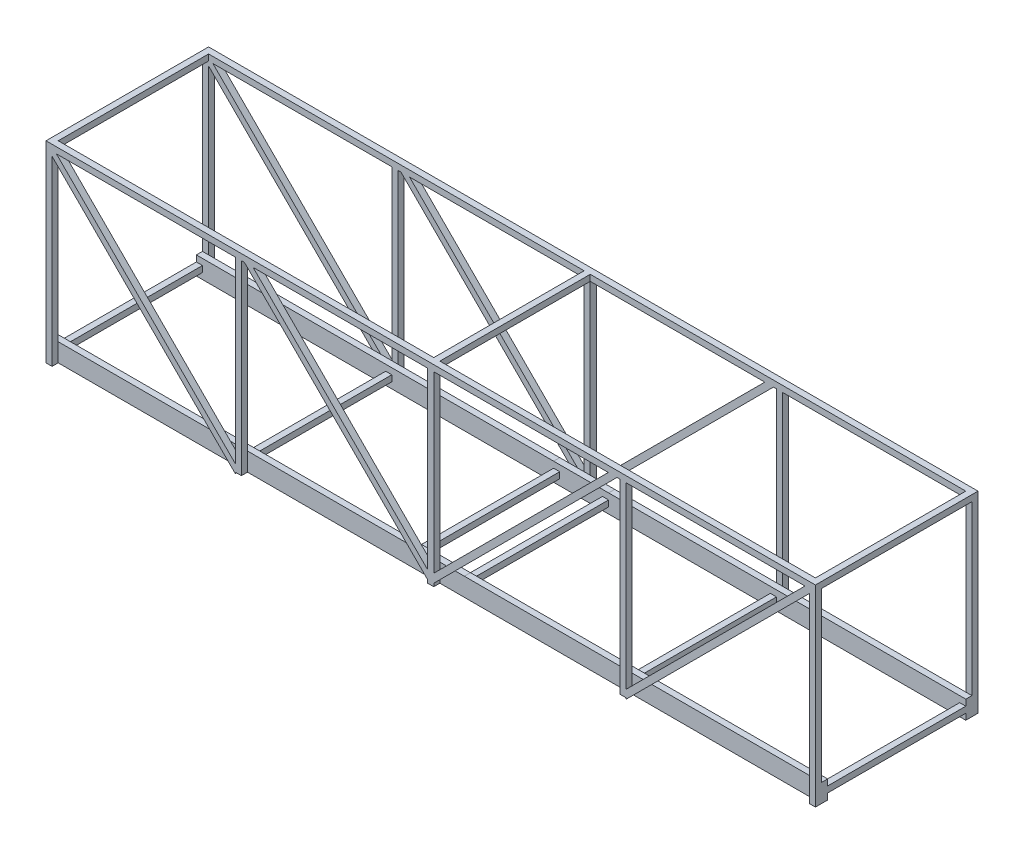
ISO-10303-21;
HEADER;
FILE_DESCRIPTION(('STEP AP214'),'2;1');
FILE_NAME('part.step','',(''),(''),'','','');
FILE_SCHEMA(('AUTOMOTIVE_DESIGN { 1 0 10303 214 1 1 1 1 }'));
ENDSEC;
DATA;
#1=APPLICATION_CONTEXT('core data for automotive mechanical design processes');
#2=APPLICATION_PROTOCOL_DEFINITION('international standard','automotive_design',2000,#1);
#3=PRODUCT_CONTEXT('',#1,'mechanical');
#4=PRODUCT('Part','Part','',(#3));
#5=PRODUCT_RELATED_PRODUCT_CATEGORY('part','',(#4));
#6=PRODUCT_DEFINITION_FORMATION('','',#4);
#7=PRODUCT_DEFINITION_CONTEXT('part definition',#1,'design');
#8=PRODUCT_DEFINITION('design','',#6,#7);
#9=PRODUCT_DEFINITION_SHAPE('','',#8);
#10=(LENGTH_UNIT() NAMED_UNIT(*) SI_UNIT(.MILLI.,.METRE.));
#11=(NAMED_UNIT(*) PLANE_ANGLE_UNIT() SI_UNIT($,.RADIAN.));
#12=(NAMED_UNIT(*) SI_UNIT($,.STERADIAN.) SOLID_ANGLE_UNIT());
#13=UNCERTAINTY_MEASURE_WITH_UNIT(LENGTH_MEASURE(1.E-05),#10,'distance_accuracy_value','');
#14=(GEOMETRIC_REPRESENTATION_CONTEXT(3) GLOBAL_UNCERTAINTY_ASSIGNED_CONTEXT((#13)) GLOBAL_UNIT_ASSIGNED_CONTEXT((#10,
#11,#12)) REPRESENTATION_CONTEXT('',''));
#15=CARTESIAN_POINT('',(0.,0.,0.));
#16=DIRECTION('',(0.,0.,1.));
#17=DIRECTION('',(1.,0.,0.));
#18=AXIS2_PLACEMENT_3D('',#15,#16,#17);
#19=CARTESIAN_POINT('',(200.,4.7625,39.0875));
#20=DIRECTION('',(0.,-1.,0.));
#21=DIRECTION('',(0.,0.,-1.));
#22=AXIS2_PLACEMENT_3D('',#19,#20,#21);
#23=PLANE('',#22);
#24=DIRECTION('',(0.,0.,1.));
#25=VECTOR('',#24,1.);
#26=CARTESIAN_POINT('',(-14.2875000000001,4.7625,39.0875));
#27=LINE('',#26,#25);
#28=CARTESIAN_POINT('',(-14.2875000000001,4.7625,35.9125));
#29=VERTEX_POINT('',#28);
#30=CARTESIAN_POINT('',(-14.2875000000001,4.7625,39.0875));
#31=VERTEX_POINT('',#30);
#32=EDGE_CURVE('E12',#29,#31,#27,.T.);
#33=ORIENTED_EDGE('',*,*,#32,.F.);
#34=DIRECTION('',(-1.,0.,0.));
#35=VECTOR('',#34,1.);
#36=CARTESIAN_POINT('',(200.,4.7625,35.9125));
#37=LINE('',#36,#35);
#38=CARTESIAN_POINT('',(-200.,4.7625,35.9125));
#39=VERTEX_POINT('',#38);
#40=EDGE_CURVE('E2422',#29,#39,#37,.T.);
#41=ORIENTED_EDGE('',*,*,#40,.T.);
#42=DIRECTION('',(0.,0.,1.));
#43=VECTOR('',#42,1.);
#44=CARTESIAN_POINT('',(-200.,4.7625,39.0875));
#45=LINE('',#44,#43);
#46=CARTESIAN_POINT('',(-200.,4.7625,39.0875));
#47=VERTEX_POINT('',#46);
#48=EDGE_CURVE('E2336',#39,#47,#45,.T.);
#49=ORIENTED_EDGE('',*,*,#48,.T.);
#50=DIRECTION('',(-1.,0.,0.));
#51=VECTOR('',#50,1.);
#52=CARTESIAN_POINT('',(200.,4.7625,39.0875));
#53=LINE('',#52,#51);
#54=CARTESIAN_POINT('',(-196.825,4.7625,39.0875));
#55=VERTEX_POINT('',#54);
#56=EDGE_CURVE('E1866',#55,#47,#53,.T.);
#57=ORIENTED_EDGE('',*,*,#56,.F.);
#58=CARTESIAN_POINT('',(-111.770064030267,4.76249999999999,39.0875));
#59=VERTEX_POINT('',#58);
#60=EDGE_CURVE('E1888',#59,#55,#53,.T.);
#61=ORIENTED_EDGE('',*,*,#60,.F.);
#62=CARTESIAN_POINT('',(-107.279935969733,4.7625,39.0875));
#63=VERTEX_POINT('',#62);
#64=EDGE_CURVE('E2497',#63,#59,#53,.T.);
#65=ORIENTED_EDGE('',*,*,#64,.F.);
#66=CARTESIAN_POINT('',(-101.5875,4.7625,39.0875));
#67=VERTEX_POINT('',#66);
#68=EDGE_CURVE('E1887',#67,#63,#53,.T.);
#69=ORIENTED_EDGE('',*,*,#68,.F.);
#70=DIRECTION('',(-1.,0.,0.));
#71=VECTOR('',#70,1.);
#72=CARTESIAN_POINT('',(200.,4.7625,39.0875));
#73=LINE('',#72,#71);
#74=CARTESIAN_POINT('',(-98.4125,4.7625,39.0875));
#75=VERTEX_POINT('',#74);
#76=EDGE_CURVE('E4075',#75,#67,#73,.T.);
#77=ORIENTED_EDGE('',*,*,#76,.F.);
#78=EDGE_CURVE('E2341',#31,#75,#53,.T.);
#79=ORIENTED_EDGE('',*,*,#78,.F.);
#80=EDGE_LOOP('',(#33,#41,#49,#57,#61,#65,#69,#77,#79));
#81=FACE_BOUND('',#80,.T.);
#82=ADVANCED_FACE('F527',(#81),#23,.F.);
#83=DIRECTION('',(0.,0.,-1.));
#84=VECTOR('',#83,1.);
#85=CARTESIAN_POINT('',(14.2875,4.7625,39.0875));
#86=LINE('',#85,#84);
#87=CARTESIAN_POINT('',(14.2875,4.7625,39.0875));
#88=VERTEX_POINT('',#87);
#89=CARTESIAN_POINT('',(14.2875,4.7625,35.9125));
#90=VERTEX_POINT('',#89);
#91=EDGE_CURVE('E536',#88,#90,#86,.T.);
#92=ORIENTED_EDGE('',*,*,#91,.F.);
#93=CARTESIAN_POINT('',(98.4124999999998,4.7625,39.0875));
#94=VERTEX_POINT('',#93);
#95=EDGE_CURVE('E2340',#94,#88,#53,.T.);
#96=ORIENTED_EDGE('',*,*,#95,.F.);
#97=CARTESIAN_POINT('',(101.5875,4.7625,39.0875));
#98=VERTEX_POINT('',#97);
#99=EDGE_CURVE('E2342',#98,#94,#53,.T.);
#100=ORIENTED_EDGE('',*,*,#99,.F.);
#101=CARTESIAN_POINT('',(107.279935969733,4.76250000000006,39.0875));
#102=VERTEX_POINT('',#101);
#103=EDGE_CURVE('E2337',#102,#98,#53,.T.);
#104=ORIENTED_EDGE('',*,*,#103,.F.);
#105=CARTESIAN_POINT('',(111.770064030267,4.76250000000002,39.0875));
#106=VERTEX_POINT('',#105);
#107=EDGE_CURVE('E2334',#106,#102,#53,.T.);
#108=ORIENTED_EDGE('',*,*,#107,.F.);
#109=CARTESIAN_POINT('',(196.825,4.7625,39.0875));
#110=VERTEX_POINT('',#109);
#111=EDGE_CURVE('E2330',#110,#106,#53,.T.);
#112=ORIENTED_EDGE('',*,*,#111,.F.);
#113=CARTESIAN_POINT('',(200.,4.7625,39.0875));
#114=VERTEX_POINT('',#113);
#115=EDGE_CURVE('E1846',#114,#110,#53,.T.);
#116=ORIENTED_EDGE('',*,*,#115,.F.);
#117=DIRECTION('',(0.,0.,1.));
#118=VECTOR('',#117,1.);
#119=CARTESIAN_POINT('',(200.,4.7625,39.0875));
#120=LINE('',#119,#118);
#121=CARTESIAN_POINT('',(200.,4.7625,35.9125));
#122=VERTEX_POINT('',#121);
#123=EDGE_CURVE('E2318',#122,#114,#120,.T.);
#124=ORIENTED_EDGE('',*,*,#123,.F.);
#125=EDGE_CURVE('E2348',#122,#90,#37,.T.);
#126=ORIENTED_EDGE('',*,*,#125,.T.);
#127=EDGE_LOOP('',(#92,#96,#100,#104,#108,#112,#116,#124,#126));
#128=FACE_BOUND('',#127,.T.);
#129=ADVANCED_FACE('F2328',(#128),#23,.F.);
#130=CARTESIAN_POINT('',(200.,4.7625,-35.9125));
#131=DIRECTION('',(0.,-1.,0.));
#132=DIRECTION('',(0.,0.,-1.));
#133=AXIS2_PLACEMENT_3D('',#130,#131,#132);
#134=PLANE('',#133);
#135=DIRECTION('',(0.,0.,1.));
#136=VECTOR('',#135,1.);
#137=CARTESIAN_POINT('',(-14.2875000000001,4.7625,-35.9125000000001));
#138=LINE('',#137,#136);
#139=CARTESIAN_POINT('',(-14.2875000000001,4.7625,-39.0875));
#140=VERTEX_POINT('',#139);
#141=CARTESIAN_POINT('',(-14.2875000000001,4.7625,-35.9125));
#142=VERTEX_POINT('',#141);
#143=EDGE_CURVE('E1686',#140,#142,#138,.T.);
#144=ORIENTED_EDGE('',*,*,#143,.F.);
#145=DIRECTION('',(-1.,0.,0.));
#146=VECTOR('',#145,1.);
#147=CARTESIAN_POINT('',(200.,4.7625,-39.0875));
#148=LINE('',#147,#146);
#149=CARTESIAN_POINT('',(-98.4125,4.7625,-39.0875));
#150=VERTEX_POINT('',#149);
#151=EDGE_CURVE('E1737',#140,#150,#148,.T.);
#152=ORIENTED_EDGE('',*,*,#151,.T.);
#153=DIRECTION('',(1.,0.,0.));
#154=VECTOR('',#153,1.);
#155=CARTESIAN_POINT('',(200.,4.7625,-39.0875));
#156=LINE('',#155,#154);
#157=CARTESIAN_POINT('',(-101.5875,4.7625,-39.0875));
#158=VERTEX_POINT('',#157);
#159=EDGE_CURVE('E2089',#158,#150,#156,.T.);
#160=ORIENTED_EDGE('',*,*,#159,.F.);
#161=CARTESIAN_POINT('',(-107.279935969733,4.7625,-39.0875));
#162=VERTEX_POINT('',#161);
#163=EDGE_CURVE('E2258',#158,#162,#148,.T.);
#164=ORIENTED_EDGE('',*,*,#163,.T.);
#165=CARTESIAN_POINT('',(-111.770064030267,4.7625,-39.0875));
#166=VERTEX_POINT('',#165);
#167=EDGE_CURVE('E2084',#166,#162,#156,.T.);
#168=ORIENTED_EDGE('',*,*,#167,.F.);
#169=CARTESIAN_POINT('',(-196.825,4.7625,-39.0875));
#170=VERTEX_POINT('',#169);
#171=EDGE_CURVE('E1728',#166,#170,#148,.T.);
#172=ORIENTED_EDGE('',*,*,#171,.T.);
#173=CARTESIAN_POINT('',(-200.,4.7625,-39.0875));
#174=VERTEX_POINT('',#173);
#175=EDGE_CURVE('E2079',#174,#170,#156,.T.);
#176=ORIENTED_EDGE('',*,*,#175,.F.);
#177=DIRECTION('',(0.,0.,1.));
#178=VECTOR('',#177,1.);
#179=CARTESIAN_POINT('',(-200.,4.7625,-35.9125));
#180=LINE('',#179,#178);
#181=CARTESIAN_POINT('',(-200.,4.7625,-35.9125));
#182=VERTEX_POINT('',#181);
#183=EDGE_CURVE('E1324',#174,#182,#180,.T.);
#184=ORIENTED_EDGE('',*,*,#183,.T.);
#185=DIRECTION('',(-1.,0.,0.));
#186=VECTOR('',#185,1.);
#187=CARTESIAN_POINT('',(200.,4.7625,-35.9125));
#188=LINE('',#187,#186);
#189=EDGE_CURVE('E1717',#142,#182,#188,.T.);
#190=ORIENTED_EDGE('',*,*,#189,.F.);
#191=EDGE_LOOP('',(#144,#152,#160,#164,#168,#172,#176,#184,#190));
#192=FACE_BOUND('',#191,.T.);
#193=ADVANCED_FACE('F1718',(#192),#134,.F.);
#194=DIRECTION('',(0.,0.,-1.));
#195=VECTOR('',#194,1.);
#196=CARTESIAN_POINT('',(14.2875,4.7625,-35.9125));
#197=LINE('',#196,#195);
#198=CARTESIAN_POINT('',(14.2875,4.7625,-35.9125));
#199=VERTEX_POINT('',#198);
#200=CARTESIAN_POINT('',(14.2875,4.7625,-39.0875));
#201=VERTEX_POINT('',#200);
#202=EDGE_CURVE('E1683',#199,#201,#197,.T.);
#203=ORIENTED_EDGE('',*,*,#202,.F.);
#204=CARTESIAN_POINT('',(200.,4.7625,-35.9125));
#205=VERTEX_POINT('',#204);
#206=EDGE_CURVE('E1723',#205,#199,#188,.T.);
#207=ORIENTED_EDGE('',*,*,#206,.F.);
#208=DIRECTION('',(0.,0.,1.));
#209=VECTOR('',#208,1.);
#210=CARTESIAN_POINT('',(200.,4.7625,-35.9125));
#211=LINE('',#210,#209);
#212=CARTESIAN_POINT('',(200.,4.7625,-39.0875));
#213=VERTEX_POINT('',#212);
#214=EDGE_CURVE('E1750',#213,#205,#211,.T.);
#215=ORIENTED_EDGE('',*,*,#214,.F.);
#216=CARTESIAN_POINT('',(196.825,4.7625,-39.0875));
#217=VERTEX_POINT('',#216);
#218=EDGE_CURVE('E1732',#213,#217,#148,.T.);
#219=ORIENTED_EDGE('',*,*,#218,.T.);
#220=CARTESIAN_POINT('',(111.770064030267,4.7625,-39.0875));
#221=VERTEX_POINT('',#220);
#222=EDGE_CURVE('E1736',#217,#221,#148,.T.);
#223=ORIENTED_EDGE('',*,*,#222,.T.);
#224=CARTESIAN_POINT('',(107.279935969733,4.7625,-39.0875));
#225=VERTEX_POINT('',#224);
#226=EDGE_CURVE('E2063',#225,#221,#156,.T.);
#227=ORIENTED_EDGE('',*,*,#226,.F.);
#228=CARTESIAN_POINT('',(101.5875,4.7625,-39.0875));
#229=VERTEX_POINT('',#228);
#230=EDGE_CURVE('E1738',#225,#229,#148,.T.);
#231=ORIENTED_EDGE('',*,*,#230,.T.);
#232=CARTESIAN_POINT('',(98.4125,4.7625,-39.0875));
#233=VERTEX_POINT('',#232);
#234=EDGE_CURVE('E2077',#233,#229,#156,.T.);
#235=ORIENTED_EDGE('',*,*,#234,.F.);
#236=EDGE_CURVE('E2275',#233,#201,#148,.T.);
#237=ORIENTED_EDGE('',*,*,#236,.T.);
#238=EDGE_LOOP('',(#203,#207,#215,#219,#223,#227,#231,#235,#237));
#239=FACE_BOUND('',#238,.T.);
#240=ADVANCED_FACE('F3170',(#239),#134,.F.);
#241=CARTESIAN_POINT('',(196.825,-4.7625,42.2625));
#242=DIRECTION('',(0.,-1.,0.));
#243=DIRECTION('',(1.,0.,0.));
#244=AXIS2_PLACEMENT_3D('',#241,#242,#243);
#245=PLANE('',#244);
#246=DIRECTION('',(-1.,0.,0.));
#247=VECTOR('',#246,1.);
#248=CARTESIAN_POINT('',(200.,-4.7625,35.9125));
#249=LINE('',#248,#247);
#250=CARTESIAN_POINT('',(196.825,-4.7625,35.9125));
#251=VERTEX_POINT('',#250);
#252=CARTESIAN_POINT('',(-196.825,-4.7625,35.9125));
#253=VERTEX_POINT('',#252);
#254=EDGE_CURVE('E2663',#251,#253,#249,.T.);
#255=ORIENTED_EDGE('',*,*,#254,.F.);
#256=DIRECTION('',(0.,0.,1.));
#257=VECTOR('',#256,1.);
#258=CARTESIAN_POINT('',(196.825,-4.7625,42.2625));
#259=LINE('',#258,#257);
#260=CARTESIAN_POINT('',(196.825,-4.7625,39.0875));
#261=VERTEX_POINT('',#260);
#262=EDGE_CURVE('E1680',#251,#261,#259,.T.);
#263=ORIENTED_EDGE('',*,*,#262,.T.);
#264=DIRECTION('',(-1.,0.,0.));
#265=VECTOR('',#264,1.);
#266=CARTESIAN_POINT('',(200.,-4.7625,39.0875));
#267=LINE('',#266,#265);
#268=CARTESIAN_POINT('',(102.245064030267,-4.76249999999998,39.0875));
#269=VERTEX_POINT('',#268);
#270=EDGE_CURVE('E1841',#261,#269,#267,.T.);
#271=ORIENTED_EDGE('',*,*,#270,.T.);
#272=CARTESIAN_POINT('',(101.5875,-4.76249999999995,39.0875));
#273=VERTEX_POINT('',#272);
#274=EDGE_CURVE('E1839',#269,#273,#267,.T.);
#275=ORIENTED_EDGE('',*,*,#274,.T.);
#276=DIRECTION('',(0.,0.,1.));
#277=VECTOR('',#276,1.);
#278=CARTESIAN_POINT('',(101.5875,-4.76249999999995,39.0875));
#279=LINE('',#278,#277);
#280=CARTESIAN_POINT('',(101.5875,-4.76249999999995,42.2625));
#281=VERTEX_POINT('',#280);
#282=EDGE_CURVE('E4168',#273,#281,#279,.T.);
#283=ORIENTED_EDGE('',*,*,#282,.T.);
#284=DIRECTION('',(-1.,0.,0.));
#285=VECTOR('',#284,1.);
#286=CARTESIAN_POINT('',(98.4125,-4.76249999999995,42.2625));
#287=LINE('',#286,#285);
#288=CARTESIAN_POINT('',(98.4125,-4.76249999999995,42.2625));
#289=VERTEX_POINT('',#288);
#290=EDGE_CURVE('E4167',#281,#289,#287,.T.);
#291=ORIENTED_EDGE('',*,*,#290,.T.);
#292=DIRECTION('',(0.,0.,-1.));
#293=VECTOR('',#292,1.);
#294=CARTESIAN_POINT('',(98.4125,-4.76249999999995,39.0875));
#295=LINE('',#294,#293);
#296=CARTESIAN_POINT('',(98.4125,-4.76249999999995,39.0875));
#297=VERTEX_POINT('',#296);
#298=EDGE_CURVE('E1832',#289,#297,#295,.T.);
#299=ORIENTED_EDGE('',*,*,#298,.T.);
#300=CARTESIAN_POINT('',(1.58749999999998,-4.7625,39.0875));
#301=VERTEX_POINT('',#300);
#302=EDGE_CURVE('E1834',#297,#301,#267,.T.);
#303=ORIENTED_EDGE('',*,*,#302,.T.);
#304=DIRECTION('',(0.,0.,1.));
#305=VECTOR('',#304,1.);
#306=CARTESIAN_POINT('',(1.58749999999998,-4.7625,39.0875));
#307=LINE('',#306,#305);
#308=CARTESIAN_POINT('',(1.58749999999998,-4.7625,42.2625));
#309=VERTEX_POINT('',#308);
#310=EDGE_CURVE('E2452',#301,#309,#307,.T.);
#311=ORIENTED_EDGE('',*,*,#310,.T.);
#312=DIRECTION('',(-1.,0.,0.));
#313=VECTOR('',#312,1.);
#314=CARTESIAN_POINT('',(-1.58750000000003,-4.7625,42.2625));
#315=LINE('',#314,#313);
#316=CARTESIAN_POINT('',(-1.58750000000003,-4.7625,42.2625));
#317=VERTEX_POINT('',#316);
#318=EDGE_CURVE('E2454',#309,#317,#315,.T.);
#319=ORIENTED_EDGE('',*,*,#318,.T.);
#320=DIRECTION('',(0.,0.,-1.));
#321=VECTOR('',#320,1.);
#322=CARTESIAN_POINT('',(-1.58750000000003,-4.7625,39.0875));
#323=LINE('',#322,#321);
#324=CARTESIAN_POINT('',(-1.58750000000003,-4.7625,39.0875));
#325=VERTEX_POINT('',#324);
#326=EDGE_CURVE('E2456',#317,#325,#323,.T.);
#327=ORIENTED_EDGE('',*,*,#326,.T.);
#328=CARTESIAN_POINT('',(-98.4125,-4.76249999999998,39.0875));
#329=VERTEX_POINT('',#328);
#330=EDGE_CURVE('E2458',#325,#329,#267,.T.);
#331=ORIENTED_EDGE('',*,*,#330,.T.);
#332=DIRECTION('',(0.,0.,1.));
#333=VECTOR('',#332,1.);
#334=CARTESIAN_POINT('',(-98.4125,-4.76249999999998,39.0875));
#335=LINE('',#334,#333);
#336=CARTESIAN_POINT('',(-98.4125,-4.76249999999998,42.2625));
#337=VERTEX_POINT('',#336);
#338=EDGE_CURVE('E2463',#329,#337,#335,.T.);
#339=ORIENTED_EDGE('',*,*,#338,.T.);
#340=DIRECTION('',(-1.,0.,0.));
#341=VECTOR('',#340,1.);
#342=CARTESIAN_POINT('',(-101.5875,-4.76249999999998,42.2625));
#343=LINE('',#342,#341);
#344=CARTESIAN_POINT('',(-101.5875,-4.76249999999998,42.2625));
#345=VERTEX_POINT('',#344);
#346=EDGE_CURVE('E2536',#337,#345,#343,.T.);
#347=ORIENTED_EDGE('',*,*,#346,.T.);
#348=DIRECTION('',(0.,0.,-1.));
#349=VECTOR('',#348,1.);
#350=CARTESIAN_POINT('',(-101.5875,-4.76249999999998,39.0875));
#351=LINE('',#350,#349);
#352=CARTESIAN_POINT('',(-101.5875,-4.7625,39.0875));
#353=VERTEX_POINT('',#352);
#354=EDGE_CURVE('E2538',#345,#353,#351,.T.);
#355=ORIENTED_EDGE('',*,*,#354,.T.);
#356=CARTESIAN_POINT('',(-102.245064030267,-4.76249999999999,39.0875));
#357=VERTEX_POINT('',#356);
#358=EDGE_CURVE('E1855',#353,#357,#267,.T.);
#359=ORIENTED_EDGE('',*,*,#358,.T.);
#360=CARTESIAN_POINT('',(-196.825,-4.7625,39.0875));
#361=VERTEX_POINT('',#360);
#362=EDGE_CURVE('E1845',#357,#361,#267,.T.);
#363=ORIENTED_EDGE('',*,*,#362,.T.);
#364=DIRECTION('',(0.,0.,-1.));
#365=VECTOR('',#364,1.);
#366=CARTESIAN_POINT('',(-196.825,-4.76249999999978,42.2625));
#367=LINE('',#366,#365);
#368=EDGE_CURVE('E1668',#361,#253,#367,.T.);
#369=ORIENTED_EDGE('',*,*,#368,.T.);
#370=EDGE_LOOP('',(#255,#263,#271,#275,#283,#291,#299,#303,#311,#319,#327,#331,#339,#347,#355,
#359,#363,#369));
#371=FACE_BOUND('',#370,.T.);
#372=ADVANCED_FACE('F3145',(#371),#245,.T.);
#373=CARTESIAN_POINT('',(200.,-4.7625,-42.2625));
#374=DIRECTION('',(0.,-1.,0.));
#375=DIRECTION('',(0.,0.,-1.));
#376=AXIS2_PLACEMENT_3D('',#373,#374,#375);
#377=PLANE('',#376);
#378=DIRECTION('',(-1.,0.,0.));
#379=VECTOR('',#378,1.);
#380=CARTESIAN_POINT('',(200.,-4.7625,-39.0875));
#381=LINE('',#380,#379);
#382=CARTESIAN_POINT('',(196.825,-4.7625,-39.0875));
#383=VERTEX_POINT('',#382);
#384=CARTESIAN_POINT('',(102.245064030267,-4.7625,-39.0875));
#385=VERTEX_POINT('',#384);
#386=EDGE_CURVE('E1751',#383,#385,#381,.T.);
#387=ORIENTED_EDGE('',*,*,#386,.F.);
#388=DIRECTION('',(0.,0.,1.));
#389=VECTOR('',#388,1.);
#390=CARTESIAN_POINT('',(196.825,-4.7625,-42.2625));
#391=LINE('',#390,#389);
#392=CARTESIAN_POINT('',(196.825,-4.7625,-35.9125));
#393=VERTEX_POINT('',#392);
#394=EDGE_CURVE('E1677',#383,#393,#391,.T.);
#395=ORIENTED_EDGE('',*,*,#394,.T.);
#396=DIRECTION('',(-1.,0.,0.));
#397=VECTOR('',#396,1.);
#398=CARTESIAN_POINT('',(200.,-4.7625,-35.9125));
#399=LINE('',#398,#397);
#400=CARTESIAN_POINT('',(-196.825,-4.7625,-35.9125));
#401=VERTEX_POINT('',#400);
#402=EDGE_CURVE('E1760',#393,#401,#399,.T.);
#403=ORIENTED_EDGE('',*,*,#402,.T.);
#404=DIRECTION('',(0.,0.,-1.));
#405=VECTOR('',#404,1.);
#406=CARTESIAN_POINT('',(-196.825,-4.7625,-42.2625));
#407=LINE('',#406,#405);
#408=CARTESIAN_POINT('',(-196.825,-4.7625,-39.0875));
#409=VERTEX_POINT('',#408);
#410=EDGE_CURVE('E1674',#401,#409,#407,.T.);
#411=ORIENTED_EDGE('',*,*,#410,.T.);
#412=CARTESIAN_POINT('',(-102.245064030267,-4.76249999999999,-39.0875));
#413=VERTEX_POINT('',#412);
#414=EDGE_CURVE('E1754',#413,#409,#381,.T.);
#415=ORIENTED_EDGE('',*,*,#414,.F.);
#416=DIRECTION('',(-1.,0.,0.));
#417=VECTOR('',#416,1.);
#418=CARTESIAN_POINT('',(200.,-4.7625,-39.0875));
#419=LINE('',#418,#417);
#420=CARTESIAN_POINT('',(-101.5875,-4.7625,-39.0875));
#421=VERTEX_POINT('',#420);
#422=EDGE_CURVE('E2064',#421,#413,#419,.T.);
#423=ORIENTED_EDGE('',*,*,#422,.F.);
#424=DIRECTION('',(0.,0.,1.));
#425=VECTOR('',#424,1.);
#426=CARTESIAN_POINT('',(-101.5875,-4.76249999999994,-39.0875));
#427=LINE('',#426,#425);
#428=CARTESIAN_POINT('',(-101.5875,-4.76249999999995,-42.2625));
#429=VERTEX_POINT('',#428);
#430=EDGE_CURVE('E1577',#429,#421,#427,.T.);
#431=ORIENTED_EDGE('',*,*,#430,.F.);
#432=DIRECTION('',(-1.,0.,0.));
#433=VECTOR('',#432,1.);
#434=CARTESIAN_POINT('',(-101.5875,-4.76249999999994,-42.2625));
#435=LINE('',#434,#433);
#436=CARTESIAN_POINT('',(-98.4125,-4.76249999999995,-42.2625));
#437=VERTEX_POINT('',#436);
#438=EDGE_CURVE('E2224',#437,#429,#435,.T.);
#439=ORIENTED_EDGE('',*,*,#438,.F.);
#440=DIRECTION('',(0.,0.,-1.));
#441=VECTOR('',#440,1.);
#442=CARTESIAN_POINT('',(-98.4125,-4.76249999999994,-39.0875));
#443=LINE('',#442,#441);
#444=CARTESIAN_POINT('',(-98.4125,-4.7625,-39.0875));
#445=VERTEX_POINT('',#444);
#446=EDGE_CURVE('E2230',#445,#437,#443,.T.);
#447=ORIENTED_EDGE('',*,*,#446,.F.);
#448=CARTESIAN_POINT('',(-1.58750000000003,-4.7625,-39.0875));
#449=VERTEX_POINT('',#448);
#450=EDGE_CURVE('E1761',#449,#445,#381,.T.);
#451=ORIENTED_EDGE('',*,*,#450,.F.);
#452=DIRECTION('',(0.,0.,1.));
#453=VECTOR('',#452,1.);
#454=CARTESIAN_POINT('',(-1.58750000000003,-4.7625,-39.0875));
#455=LINE('',#454,#453);
#456=CARTESIAN_POINT('',(-1.58750000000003,-4.7625,-42.2625));
#457=VERTEX_POINT('',#456);
#458=EDGE_CURVE('E2150',#457,#449,#455,.T.);
#459=ORIENTED_EDGE('',*,*,#458,.F.);
#460=DIRECTION('',(-1.,0.,0.));
#461=VECTOR('',#460,1.);
#462=CARTESIAN_POINT('',(-1.58750000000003,-4.7625,-42.2625));
#463=LINE('',#462,#461);
#464=CARTESIAN_POINT('',(1.58749999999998,-4.7625,-42.2625));
#465=VERTEX_POINT('',#464);
#466=EDGE_CURVE('E1480',#465,#457,#463,.T.);
#467=ORIENTED_EDGE('',*,*,#466,.F.);
#468=DIRECTION('',(0.,0.,-1.));
#469=VECTOR('',#468,1.);
#470=CARTESIAN_POINT('',(1.58749999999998,-4.7625,-39.0875));
#471=LINE('',#470,#469);
#472=CARTESIAN_POINT('',(1.58749999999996,-4.7625,-39.0875));
#473=VERTEX_POINT('',#472);
#474=EDGE_CURVE('E2126',#473,#465,#471,.T.);
#475=ORIENTED_EDGE('',*,*,#474,.F.);
#476=CARTESIAN_POINT('',(98.4125,-4.76249999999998,-39.0875));
#477=VERTEX_POINT('',#476);
#478=EDGE_CURVE('E1753',#477,#473,#381,.T.);
#479=ORIENTED_EDGE('',*,*,#478,.F.);
#480=DIRECTION('',(0.,0.,1.));
#481=VECTOR('',#480,1.);
#482=CARTESIAN_POINT('',(98.4125,-4.76249999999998,-39.0875));
#483=LINE('',#482,#481);
#484=CARTESIAN_POINT('',(98.4125,-4.76249999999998,-42.2625));
#485=VERTEX_POINT('',#484);
#486=EDGE_CURVE('E1376',#485,#477,#483,.T.);
#487=ORIENTED_EDGE('',*,*,#486,.F.);
#488=DIRECTION('',(-1.,0.,0.));
#489=VECTOR('',#488,1.);
#490=CARTESIAN_POINT('',(98.4125,-4.76249999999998,-42.2625));
#491=LINE('',#490,#489);
#492=CARTESIAN_POINT('',(101.5875,-4.76249999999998,-42.2625));
#493=VERTEX_POINT('',#492);
#494=EDGE_CURVE('E1373',#493,#485,#491,.T.);
#495=ORIENTED_EDGE('',*,*,#494,.F.);
#496=DIRECTION('',(0.,0.,-1.));
#497=VECTOR('',#496,1.);
#498=CARTESIAN_POINT('',(101.5875,-4.76249999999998,-39.0875));
#499=LINE('',#498,#497);
#500=CARTESIAN_POINT('',(101.5875,-4.7625,-39.0875));
#501=VERTEX_POINT('',#500);
#502=EDGE_CURVE('E1381',#501,#493,#499,.T.);
#503=ORIENTED_EDGE('',*,*,#502,.F.);
#504=EDGE_CURVE('E2061',#385,#501,#419,.T.);
#505=ORIENTED_EDGE('',*,*,#504,.F.);
#506=EDGE_LOOP('',(#387,#395,#403,#411,#415,#423,#431,#439,#447,#451,#459,#467,#475,#479,#487,
#495,#503,#505));
#507=FACE_BOUND('',#506,.T.);
#508=ADVANCED_FACE('F2059',(#507),#377,.T.);
#509=ORIENTED_EDGE('',*,*,#394,.F.);
#510=DIRECTION('',(0.,0.,1.));
#511=VECTOR('',#510,1.);
#512=CARTESIAN_POINT('',(196.825,-4.7625,-39.0875));
#513=LINE('',#512,#511);
#514=CARTESIAN_POINT('',(196.825,-4.7625,-42.2625));
#515=VERTEX_POINT('',#514);
#516=EDGE_CURVE('E1652',#515,#383,#513,.T.);
#517=ORIENTED_EDGE('',*,*,#516,.F.);
#518=DIRECTION('',(-1.,0.,0.));
#519=VECTOR('',#518,1.);
#520=CARTESIAN_POINT('',(196.825,-4.7625,-42.2625));
#521=LINE('',#520,#519);
#522=CARTESIAN_POINT('',(200.,-4.7625,-42.2625));
#523=VERTEX_POINT('',#522);
#524=EDGE_CURVE('E1647',#523,#515,#521,.T.);
#525=ORIENTED_EDGE('',*,*,#524,.F.);
#526=DIRECTION('',(0.,0.,-1.));
#527=VECTOR('',#526,1.);
#528=CARTESIAN_POINT('',(200.,-4.7625,-39.0875));
#529=LINE('',#528,#527);
#530=CARTESIAN_POINT('',(200.,-4.7625,-35.9125));
#531=VERTEX_POINT('',#530);
#532=EDGE_CURVE('E1665',#531,#523,#529,.T.);
#533=ORIENTED_EDGE('',*,*,#532,.F.);
#534=EDGE_CURVE('E1721',#531,#393,#399,.T.);
#535=ORIENTED_EDGE('',*,*,#534,.T.);
#536=EDGE_LOOP('',(#509,#517,#525,#533,#535));
#537=FACE_BOUND('',#536,.T.);
#538=ADVANCED_FACE('F2054',(#537),#377,.T.);
#539=ORIENTED_EDGE('',*,*,#262,.F.);
#540=CARTESIAN_POINT('',(200.,-4.7625,35.9125));
#541=VERTEX_POINT('',#540);
#542=EDGE_CURVE('E1847',#541,#251,#249,.T.);
#543=ORIENTED_EDGE('',*,*,#542,.F.);
#544=DIRECTION('',(0.,0.,-1.));
#545=VECTOR('',#544,1.);
#546=CARTESIAN_POINT('',(200.,-4.7625,39.0875));
#547=LINE('',#546,#545);
#548=CARTESIAN_POINT('',(200.,-4.7625,42.2625));
#549=VERTEX_POINT('',#548);
#550=EDGE_CURVE('E2550',#549,#541,#547,.T.);
#551=ORIENTED_EDGE('',*,*,#550,.F.);
#552=DIRECTION('',(1.,0.,0.));
#553=VECTOR('',#552,1.);
#554=CARTESIAN_POINT('',(200.,-4.7625,42.2625));
#555=LINE('',#554,#553);
#556=CARTESIAN_POINT('',(196.825,-4.7625,42.2625));
#557=VERTEX_POINT('',#556);
#558=EDGE_CURVE('E2552',#557,#549,#555,.T.);
#559=ORIENTED_EDGE('',*,*,#558,.F.);
#560=DIRECTION('',(0.,0.,1.));
#561=VECTOR('',#560,1.);
#562=CARTESIAN_POINT('',(196.825,-4.7625,39.0875));
#563=LINE('',#562,#561);
#564=EDGE_CURVE('E2557',#261,#557,#563,.T.);
#565=ORIENTED_EDGE('',*,*,#564,.F.);
#566=EDGE_LOOP('',(#539,#543,#551,#559,#565));
#567=FACE_BOUND('',#566,.T.);
#568=ADVANCED_FACE('F3138',(#567),#245,.T.);
#569=CARTESIAN_POINT('',(196.825,95.2374999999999,-39.0875));
#570=DIRECTION('',(1.,0.,0.));
#571=DIRECTION('',(0.,0.,-1.));
#572=AXIS2_PLACEMENT_3D('',#569,#570,#571);
#573=PLANE('',#572);
#574=DIRECTION('',(0.,0.,-1.));
#575=VECTOR('',#574,1.);
#576=CARTESIAN_POINT('',(196.825,89.8174359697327,-39.0875));
#577=LINE('',#576,#575);
#578=CARTESIAN_POINT('',(196.825,89.8174359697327,-39.0875));
#579=VERTEX_POINT('',#578);
#580=CARTESIAN_POINT('',(196.825,89.8174359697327,-42.2625));
#581=VERTEX_POINT('',#580);
#582=EDGE_CURVE('E1384',#579,#581,#577,.T.);
#583=ORIENTED_EDGE('',*,*,#582,.T.);
#584=DIRECTION('',(0.,-1.,0.));
#585=VECTOR('',#584,1.);
#586=CARTESIAN_POINT('',(196.825,95.2374999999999,-42.2625));
#587=LINE('',#586,#585);
#588=EDGE_CURVE('E1644',#581,#515,#587,.T.);
#589=ORIENTED_EDGE('',*,*,#588,.T.);
#590=ORIENTED_EDGE('',*,*,#516,.T.);
#591=DIRECTION('',(0.,-1.,0.));
#592=VECTOR('',#591,1.);
#593=CARTESIAN_POINT('',(196.825,95.2374999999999,-39.0875));
#594=LINE('',#593,#592);
#595=EDGE_CURVE('E2041',#217,#383,#594,.T.);
#596=ORIENTED_EDGE('',*,*,#595,.F.);
#597=DIRECTION('',(0.,-1.,0.));
#598=VECTOR('',#597,1.);
#599=CARTESIAN_POINT('',(196.825,95.2374999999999,-39.0875));
#600=LINE('',#599,#598);
#601=EDGE_CURVE('E1651',#579,#217,#600,.T.);
#602=ORIENTED_EDGE('',*,*,#601,.F.);
#603=EDGE_LOOP('',(#583,#589,#590,#596,#602));
#604=FACE_BOUND('',#603,.T.);
#605=ADVANCED_FACE('F2055',(#604),#573,.F.);
#606=CARTESIAN_POINT('',(196.825,95.2374999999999,-39.0875));
#607=DIRECTION('',(0.,0.,-1.));
#608=DIRECTION('',(-1.,0.,0.));
#609=AXIS2_PLACEMENT_3D('',#606,#607,#608);
#610=PLANE('',#609);
#611=ORIENTED_EDGE('',*,*,#218,.F.);
#612=DIRECTION('',(0.,-1.,0.));
#613=VECTOR('',#612,1.);
#614=CARTESIAN_POINT('',(200.,95.2374999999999,-39.0875));
#615=LINE('',#614,#613);
#616=CARTESIAN_POINT('',(200.,92.0624999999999,-39.0875));
#617=VERTEX_POINT('',#616);
#618=EDGE_CURVE('E1662',#617,#213,#615,.T.);
#619=ORIENTED_EDGE('',*,*,#618,.F.);
#620=DIRECTION('',(1.,0.,0.));
#621=VECTOR('',#620,1.);
#622=CARTESIAN_POINT('',(196.825,92.0624999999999,-39.0875));
#623=LINE('',#622,#621);
#624=CARTESIAN_POINT('',(196.825,92.0624999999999,-39.0875));
#625=VERTEX_POINT('',#624);
#626=EDGE_CURVE('E1655',#625,#617,#623,.T.);
#627=ORIENTED_EDGE('',*,*,#626,.F.);
#628=DIRECTION('',(0.,1.,0.));
#629=VECTOR('',#628,1.);
#630=CARTESIAN_POINT('',(196.825,92.0624999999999,-39.0875));
#631=LINE('',#630,#629);
#632=CARTESIAN_POINT('',(196.825,95.2374999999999,-39.0875));
#633=VERTEX_POINT('',#632);
#634=EDGE_CURVE('E1388',#625,#633,#631,.T.);
#635=ORIENTED_EDGE('',*,*,#634,.T.);
#636=DIRECTION('',(-1.,0.,0.));
#637=VECTOR('',#636,1.);
#638=CARTESIAN_POINT('',(200.,95.2374999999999,-39.0875));
#639=LINE('',#638,#637);
#640=CARTESIAN_POINT('',(1.58750000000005,95.2374999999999,-39.0875));
#641=VERTEX_POINT('',#640);
#642=EDGE_CURVE('E1414',#633,#641,#639,.T.);
#643=ORIENTED_EDGE('',*,*,#642,.T.);
#644=DIRECTION('',(0.,-1.,0.));
#645=VECTOR('',#644,1.);
#646=CARTESIAN_POINT('',(1.5875,92.0625,-39.0875));
#647=LINE('',#646,#645);
#648=CARTESIAN_POINT('',(1.5875,92.0625,-39.0875));
#649=VERTEX_POINT('',#648);
#650=EDGE_CURVE('E1410',#641,#649,#647,.T.);
#651=ORIENTED_EDGE('',*,*,#650,.T.);
#652=DIRECTION('',(-1.,0.,0.));
#653=VECTOR('',#652,1.);
#654=CARTESIAN_POINT('',(200.,92.0624999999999,-39.0875));
#655=LINE('',#654,#653);
#656=CARTESIAN_POINT('',(92.3348719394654,92.0624999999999,-39.0875));
#657=VERTEX_POINT('',#656);
#658=EDGE_CURVE('E1347',#657,#649,#655,.T.);
#659=ORIENTED_EDGE('',*,*,#658,.F.);
#660=DIRECTION('',(-0.707106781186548,-0.707106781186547,0.));
#661=VECTOR('',#660,1.);
#662=CARTESIAN_POINT('',(97.7549359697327,97.4825640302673,-39.0875));
#663=LINE('',#662,#661);
#664=CARTESIAN_POINT('',(5.03487193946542,4.7625,-39.0875));
#665=VERTEX_POINT('',#664);
#666=EDGE_CURVE('E1419',#657,#665,#663,.T.);
#667=ORIENTED_EDGE('',*,*,#666,.T.);
#668=CARTESIAN_POINT('',(9.52499999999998,4.7625,-39.0875));
#669=VERTEX_POINT('',#668);
#670=EDGE_CURVE('E2081',#665,#669,#156,.T.);
#671=ORIENTED_EDGE('',*,*,#670,.T.);
#672=DIRECTION('',(-0.707106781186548,-0.707106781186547,0.));
#673=VECTOR('',#672,1.);
#674=CARTESIAN_POINT('',(100.,95.2375,-39.0875));
#675=LINE('',#674,#673);
#676=CARTESIAN_POINT('',(96.825,92.0624999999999,-39.0875));
#677=VERTEX_POINT('',#676);
#678=EDGE_CURVE('E1531',#677,#669,#675,.T.);
#679=ORIENTED_EDGE('',*,*,#678,.F.);
#680=CARTESIAN_POINT('',(98.4125,92.0624999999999,-39.0875));
#681=VERTEX_POINT('',#680);
#682=EDGE_CURVE('E1358',#681,#677,#655,.T.);
#683=ORIENTED_EDGE('',*,*,#682,.F.);
#684=DIRECTION('',(0.,-1.,0.));
#685=VECTOR('',#684,1.);
#686=CARTESIAN_POINT('',(98.4125,95.2375,-39.0875));
#687=LINE('',#686,#685);
#688=EDGE_CURVE('E1385',#681,#233,#687,.T.);
#689=ORIENTED_EDGE('',*,*,#688,.T.);
#690=ORIENTED_EDGE('',*,*,#234,.T.);
#691=DIRECTION('',(0.,-1.,0.));
#692=VECTOR('',#691,1.);
#693=CARTESIAN_POINT('',(101.5875,95.2375,-39.0875));
#694=LINE('',#693,#692);
#695=CARTESIAN_POINT('',(101.5875,92.0624999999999,-39.0875));
#696=VERTEX_POINT('',#695);
#697=EDGE_CURVE('E1397',#696,#229,#694,.T.);
#698=ORIENTED_EDGE('',*,*,#697,.F.);
#699=CARTESIAN_POINT('',(194.579935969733,92.0624999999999,-39.0875));
#700=VERTEX_POINT('',#699);
#701=EDGE_CURVE('E1340',#700,#696,#655,.T.);
#702=ORIENTED_EDGE('',*,*,#701,.F.);
#703=DIRECTION('',(-0.707106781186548,-0.707106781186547,0.));
#704=VECTOR('',#703,1.);
#705=CARTESIAN_POINT('',(198.877467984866,96.3600320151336,-39.0875));
#706=LINE('',#705,#704);
#707=EDGE_CURVE('E1611',#700,#225,#706,.T.);
#708=ORIENTED_EDGE('',*,*,#707,.T.);
#709=ORIENTED_EDGE('',*,*,#226,.T.);
#710=DIRECTION('',(-0.707106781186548,-0.707106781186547,0.));
#711=VECTOR('',#710,1.);
#712=CARTESIAN_POINT('',(201.122532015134,94.1149679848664,-39.0875));
#713=LINE('',#712,#711);
#714=EDGE_CURVE('E1616',#579,#221,#713,.T.);
#715=ORIENTED_EDGE('',*,*,#714,.F.);
#716=ORIENTED_EDGE('',*,*,#601,.T.);
#717=EDGE_LOOP('',(#611,#619,#627,#635,#643,#651,#659,#667,#671,#679,#683,#689,#690,#698,#702,
#708,#709,#715,#716));
#718=FACE_BOUND('',#717,.T.);
#719=ADVANCED_FACE('F2071',(#718),#610,.F.);
#720=CARTESIAN_POINT('',(200.,95.2374999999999,-39.0875));
#721=DIRECTION('',(-1.,0.,0.));
#722=DIRECTION('',(0.,0.,1.));
#723=AXIS2_PLACEMENT_3D('',#720,#721,#722);
#724=PLANE('',#723);
#725=ORIENTED_EDGE('',*,*,#618,.T.);
#726=ORIENTED_EDGE('',*,*,#214,.T.);
#727=DIRECTION('',(0.,-1.,0.));
#728=VECTOR('',#727,1.);
#729=CARTESIAN_POINT('',(200.,-4.7625,-35.9125));
#730=LINE('',#729,#728);
#731=CARTESIAN_POINT('',(200.,1.5875,-35.9125));
#732=VERTEX_POINT('',#731);
#733=EDGE_CURVE('E1763',#205,#732,#730,.T.);
#734=ORIENTED_EDGE('',*,*,#733,.T.);
#735=DIRECTION('',(0.,0.,1.));
#736=VECTOR('',#735,1.);
#737=CARTESIAN_POINT('',(200.,1.5875,-37.5));
#738=LINE('',#737,#736);
#739=CARTESIAN_POINT('',(200.,1.5875,35.9125));
#740=VERTEX_POINT('',#739);
#741=EDGE_CURVE('E2365',#732,#740,#738,.T.);
#742=ORIENTED_EDGE('',*,*,#741,.T.);
#743=DIRECTION('',(0.,1.,0.));
#744=VECTOR('',#743,1.);
#745=CARTESIAN_POINT('',(200.,-4.7625,35.9125));
#746=LINE('',#745,#744);
#747=EDGE_CURVE('E2321',#740,#122,#746,.T.);
#748=ORIENTED_EDGE('',*,*,#747,.T.);
#749=ORIENTED_EDGE('',*,*,#123,.T.);
#750=DIRECTION('',(0.,1.,0.));
#751=VECTOR('',#750,1.);
#752=CARTESIAN_POINT('',(200.,92.0625,39.0875));
#753=LINE('',#752,#751);
#754=CARTESIAN_POINT('',(200.,92.0624999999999,39.0875));
#755=VERTEX_POINT('',#754);
#756=EDGE_CURVE('E1982',#114,#755,#753,.T.);
#757=ORIENTED_EDGE('',*,*,#756,.T.);
#758=DIRECTION('',(0.,0.,-1.));
#759=VECTOR('',#758,1.);
#760=CARTESIAN_POINT('',(200.,92.0624999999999,-39.0875));
#761=LINE('',#760,#759);
#762=EDGE_CURVE('E2286',#755,#617,#761,.T.);
#763=ORIENTED_EDGE('',*,*,#762,.T.);
#764=EDGE_LOOP('',(#725,#726,#734,#742,#748,#749,#757,#763));
#765=FACE_BOUND('',#764,.T.);
#766=ORIENTED_EDGE('',*,*,#532,.T.);
#767=DIRECTION('',(0.,-1.,0.));
#768=VECTOR('',#767,1.);
#769=CARTESIAN_POINT('',(200.,95.2374999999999,-42.2625));
#770=LINE('',#769,#768);
#771=CARTESIAN_POINT('',(200.,95.2374999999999,-42.2625));
#772=VERTEX_POINT('',#771);
#773=EDGE_CURVE('E1657',#772,#523,#770,.T.);
#774=ORIENTED_EDGE('',*,*,#773,.F.);
#775=DIRECTION('',(0.,0.,1.));
#776=VECTOR('',#775,1.);
#777=CARTESIAN_POINT('',(200.,95.2375,39.0875));
#778=LINE('',#777,#776);
#779=CARTESIAN_POINT('',(200.,95.2375,42.2625));
#780=VERTEX_POINT('',#779);
#781=EDGE_CURVE('E1976',#772,#780,#778,.T.);
#782=ORIENTED_EDGE('',*,*,#781,.T.);
#783=DIRECTION('',(0.,-1.,0.));
#784=VECTOR('',#783,1.);
#785=CARTESIAN_POINT('',(200.,92.0625,42.2625));
#786=LINE('',#785,#784);
#787=EDGE_CURVE('E1979',#780,#549,#786,.T.);
#788=ORIENTED_EDGE('',*,*,#787,.T.);
#789=ORIENTED_EDGE('',*,*,#550,.T.);
#790=CARTESIAN_POINT('',(200.,-1.5875,35.9125));
#791=VERTEX_POINT('',#790);
#792=EDGE_CURVE('E2325',#541,#791,#746,.T.);
#793=ORIENTED_EDGE('',*,*,#792,.T.);
#794=DIRECTION('',(0.,0.,1.));
#795=VECTOR('',#794,1.);
#796=CARTESIAN_POINT('',(200.,-1.5875,-37.5));
#797=LINE('',#796,#795);
#798=CARTESIAN_POINT('',(200.,-1.5875,-35.9125));
#799=VERTEX_POINT('',#798);
#800=EDGE_CURVE('E1933',#799,#791,#797,.T.);
#801=ORIENTED_EDGE('',*,*,#800,.F.);
#802=EDGE_CURVE('E1767',#799,#531,#730,.T.);
#803=ORIENTED_EDGE('',*,*,#802,.T.);
#804=EDGE_LOOP('',(#766,#774,#782,#788,#789,#793,#801,#803));
#805=FACE_BOUND('',#804,.T.);
#806=ADVANCED_FACE('F2044',(#765,#805),#724,.F.);
#807=CARTESIAN_POINT('',(196.825,95.2374999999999,-42.2625));
#808=DIRECTION('',(0.,0.,1.));
#809=DIRECTION('',(1.,0.,0.));
#810=AXIS2_PLACEMENT_3D('',#807,#808,#809);
#811=PLANE('',#810);
#812=ORIENTED_EDGE('',*,*,#588,.F.);
#813=DIRECTION('',(-0.707106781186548,-0.707106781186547,0.));
#814=VECTOR('',#813,1.);
#815=CARTESIAN_POINT('',(201.122532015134,94.1149679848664,-42.2625));
#816=LINE('',#815,#814);
#817=CARTESIAN_POINT('',(101.5875,-5.42006403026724,-42.2625));
#818=VERTEX_POINT('',#817);
#819=EDGE_CURVE('E1375',#581,#818,#816,.T.);
#820=ORIENTED_EDGE('',*,*,#819,.T.);
#821=DIRECTION('',(0.,-1.,0.));
#822=VECTOR('',#821,1.);
#823=CARTESIAN_POINT('',(101.5875,95.2375,-42.2625));
#824=LINE('',#823,#822);
#825=EDGE_CURVE('E1383',#493,#818,#824,.T.);
#826=ORIENTED_EDGE('',*,*,#825,.F.);
#827=ORIENTED_EDGE('',*,*,#494,.T.);
#828=DIRECTION('',(0.,-1.,0.));
#829=VECTOR('',#828,1.);
#830=CARTESIAN_POINT('',(98.4125,95.2375,-42.2625));
#831=LINE('',#830,#829);
#832=CARTESIAN_POINT('',(98.4125000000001,92.0624999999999,-42.2625));
#833=VERTEX_POINT('',#832);
#834=EDGE_CURVE('E1379',#833,#485,#831,.T.);
#835=ORIENTED_EDGE('',*,*,#834,.F.);
#836=DIRECTION('',(-1.,0.,0.));
#837=VECTOR('',#836,1.);
#838=CARTESIAN_POINT('',(200.,92.0624999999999,-42.2625));
#839=LINE('',#838,#837);
#840=CARTESIAN_POINT('',(96.825,92.0624999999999,-42.2625));
#841=VERTEX_POINT('',#840);
#842=EDGE_CURVE('E1363',#833,#841,#839,.T.);
#843=ORIENTED_EDGE('',*,*,#842,.T.);
#844=DIRECTION('',(-0.707106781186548,-0.707106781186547,0.));
#845=VECTOR('',#844,1.);
#846=CARTESIAN_POINT('',(100.,95.2375,-42.2625));
#847=LINE('',#846,#845);
#848=CARTESIAN_POINT('',(1.58749999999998,-3.17500000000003,-42.2625));
#849=VERTEX_POINT('',#848);
#850=EDGE_CURVE('E1539',#841,#849,#847,.T.);
#851=ORIENTED_EDGE('',*,*,#850,.T.);
#852=DIRECTION('',(0.,-1.,0.));
#853=VECTOR('',#852,1.);
#854=CARTESIAN_POINT('',(1.58750000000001,95.2375,-42.2625));
#855=LINE('',#854,#853);
#856=EDGE_CURVE('E1543',#849,#465,#855,.T.);
#857=ORIENTED_EDGE('',*,*,#856,.T.);
#858=ORIENTED_EDGE('',*,*,#466,.T.);
#859=DIRECTION('',(0.,-1.,0.));
#860=VECTOR('',#859,1.);
#861=CARTESIAN_POINT('',(-1.58750000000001,95.2375,-42.2625));
#862=LINE('',#861,#860);
#863=CARTESIAN_POINT('',(-1.58750000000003,-3.175,-42.2625));
#864=VERTEX_POINT('',#863);
#865=EDGE_CURVE('E1469',#864,#457,#862,.T.);
#866=ORIENTED_EDGE('',*,*,#865,.F.);
#867=DIRECTION('',(-0.707106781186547,0.707106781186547,0.));
#868=VECTOR('',#867,1.);
#869=CARTESIAN_POINT('',(0.,-4.7625,-42.2625));
#870=LINE('',#869,#868);
#871=CARTESIAN_POINT('',(-96.8249999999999,92.0624999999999,-42.2625));
#872=VERTEX_POINT('',#871);
#873=EDGE_CURVE('E1456',#864,#872,#870,.T.);
#874=ORIENTED_EDGE('',*,*,#873,.T.);
#875=CARTESIAN_POINT('',(-98.4124999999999,92.0624999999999,-42.2625));
#876=VERTEX_POINT('',#875);
#877=EDGE_CURVE('E1452',#872,#876,#839,.T.);
#878=ORIENTED_EDGE('',*,*,#877,.T.);
#879=DIRECTION('',(0.,-1.,0.));
#880=VECTOR('',#879,1.);
#881=CARTESIAN_POINT('',(-98.4125,95.2375,-42.2625));
#882=LINE('',#881,#880);
#883=EDGE_CURVE('E1455',#876,#437,#882,.T.);
#884=ORIENTED_EDGE('',*,*,#883,.T.);
#885=ORIENTED_EDGE('',*,*,#438,.T.);
#886=DIRECTION('',(0.,-1.,0.));
#887=VECTOR('',#886,1.);
#888=CARTESIAN_POINT('',(-101.5875,95.2375,-42.2625));
#889=LINE('',#888,#887);
#890=CARTESIAN_POINT('',(-101.5875,-5.42006403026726,-42.2625));
#891=VERTEX_POINT('',#890);
#892=EDGE_CURVE('E1584',#429,#891,#889,.T.);
#893=ORIENTED_EDGE('',*,*,#892,.T.);
#894=DIRECTION('',(0.707106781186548,-0.707106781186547,0.));
#895=VECTOR('',#894,1.);
#896=CARTESIAN_POINT('',(-201.122532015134,94.1149679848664,-42.2625));
#897=LINE('',#896,#895);
#898=CARTESIAN_POINT('',(-196.825,89.8174359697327,-42.2625));
#899=VERTEX_POINT('',#898);
#900=EDGE_CURVE('E1602',#899,#891,#897,.T.);
#901=ORIENTED_EDGE('',*,*,#900,.F.);
#902=DIRECTION('',(0.,-1.,0.));
#903=VECTOR('',#902,1.);
#904=CARTESIAN_POINT('',(-196.825,95.2374999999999,-42.2625));
#905=LINE('',#904,#903);
#906=CARTESIAN_POINT('',(-196.825,-4.7625,-42.2625));
#907=VERTEX_POINT('',#906);
#908=EDGE_CURVE('E2299',#899,#907,#905,.T.);
#909=ORIENTED_EDGE('',*,*,#908,.T.);
#910=DIRECTION('',(-1.,0.,0.));
#911=VECTOR('',#910,1.);
#912=CARTESIAN_POINT('',(-200.,-4.7625,-42.2625));
#913=LINE('',#912,#911);
#914=CARTESIAN_POINT('',(-200.,-4.7625,-42.2625));
#915=VERTEX_POINT('',#914);
#916=EDGE_CURVE('E2296',#907,#915,#913,.T.);
#917=ORIENTED_EDGE('',*,*,#916,.T.);
#918=DIRECTION('',(0.,1.,0.));
#919=VECTOR('',#918,1.);
#920=CARTESIAN_POINT('',(-200.,95.2374999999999,-42.2625));
#921=LINE('',#920,#919);
#922=CARTESIAN_POINT('',(-200.,95.2374999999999,-42.2625));
#923=VERTEX_POINT('',#922);
#924=EDGE_CURVE('E1331',#915,#923,#921,.T.);
#925=ORIENTED_EDGE('',*,*,#924,.T.);
#926=DIRECTION('',(-1.,0.,0.));
#927=VECTOR('',#926,1.);
#928=CARTESIAN_POINT('',(200.,95.2374999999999,-42.2625));
#929=LINE('',#928,#927);
#930=EDGE_CURVE('E1441',#772,#923,#929,.T.);
#931=ORIENTED_EDGE('',*,*,#930,.F.);
#932=ORIENTED_EDGE('',*,*,#773,.T.);
#933=ORIENTED_EDGE('',*,*,#524,.T.);
#934=EDGE_LOOP('',(#812,#820,#826,#827,#835,#843,#851,#857,#858,#866,#874,#878,#884,#885,#893,
#901,#909,#917,#925,#931,#932,#933));
#935=FACE_BOUND('',#934,.T.);
#936=DIRECTION('',(0.707106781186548,-0.707106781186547,0.));
#937=VECTOR('',#936,1.);
#938=CARTESIAN_POINT('',(-198.877467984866,96.3600320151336,-42.2625));
#939=LINE('',#938,#937);
#940=CARTESIAN_POINT('',(-194.579935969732,92.0624999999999,-42.2625));
#941=VERTEX_POINT('',#940);
#942=CARTESIAN_POINT('',(-101.5875,-0.929935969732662,-42.2625));
#943=VERTEX_POINT('',#942);
#944=EDGE_CURVE('E1442',#941,#943,#939,.T.);
#945=ORIENTED_EDGE('',*,*,#944,.T.);
#946=DIRECTION('',(0.,-1.,0.));
#947=VECTOR('',#946,1.);
#948=CARTESIAN_POINT('',(-101.5875,95.2375,-42.2625));
#949=LINE('',#948,#947);
#950=CARTESIAN_POINT('',(-101.5875,92.0624999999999,-42.2625));
#951=VERTEX_POINT('',#950);
#952=EDGE_CURVE('E2228',#951,#943,#949,.T.);
#953=ORIENTED_EDGE('',*,*,#952,.F.);
#954=EDGE_CURVE('E1438',#951,#941,#839,.T.);
#955=ORIENTED_EDGE('',*,*,#954,.T.);
#956=EDGE_LOOP('',(#945,#953,#955));
#957=FACE_BOUND('',#956,.T.);
#958=DIRECTION('',(-0.707106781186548,-0.707106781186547,0.));
#959=VECTOR('',#958,1.);
#960=CARTESIAN_POINT('',(198.877467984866,96.3600320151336,-42.2625));
#961=LINE('',#960,#959);
#962=CARTESIAN_POINT('',(194.579935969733,92.0624999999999,-42.2625));
#963=VERTEX_POINT('',#962);
#964=CARTESIAN_POINT('',(101.5875,-0.929935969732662,-42.2625));
#965=VERTEX_POINT('',#964);
#966=EDGE_CURVE('E1590',#963,#965,#961,.T.);
#967=ORIENTED_EDGE('',*,*,#966,.F.);
#968=CARTESIAN_POINT('',(101.5875,92.0624999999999,-42.2625));
#969=VERTEX_POINT('',#968);
#970=EDGE_CURVE('E1396',#963,#969,#839,.T.);
#971=ORIENTED_EDGE('',*,*,#970,.T.);
#972=DIRECTION('',(0.,-1.,0.));
#973=VECTOR('',#972,1.);
#974=CARTESIAN_POINT('',(101.5875,95.2375,-42.2625));
#975=LINE('',#974,#973);
#976=EDGE_CURVE('E1392',#969,#965,#975,.T.);
#977=ORIENTED_EDGE('',*,*,#976,.T.);
#978=EDGE_LOOP('',(#967,#971,#977));
#979=FACE_BOUND('',#978,.T.);
#980=DIRECTION('',(-0.707106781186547,0.707106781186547,0.));
#981=VECTOR('',#980,1.);
#982=CARTESIAN_POINT('',(2.24506403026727,-2.51743596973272,-42.2625));
#983=LINE('',#982,#981);
#984=CARTESIAN_POINT('',(-1.58750000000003,1.31512806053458,-42.2625));
#985=VERTEX_POINT('',#984);
#986=CARTESIAN_POINT('',(-92.3348719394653,92.0624999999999,-42.2625));
#987=VERTEX_POINT('',#986);
#988=EDGE_CURVE('E1481',#985,#987,#983,.T.);
#989=ORIENTED_EDGE('',*,*,#988,.F.);
#990=CARTESIAN_POINT('',(-1.58750000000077,92.0624999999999,-42.2625));
#991=VERTEX_POINT('',#990);
#992=EDGE_CURVE('E1473',#991,#985,#862,.T.);
#993=ORIENTED_EDGE('',*,*,#992,.F.);
#994=EDGE_CURVE('E1395',#991,#987,#839,.T.);
#995=ORIENTED_EDGE('',*,*,#994,.T.);
#996=EDGE_LOOP('',(#989,#993,#995));
#997=FACE_BOUND('',#996,.T.);
#998=CARTESIAN_POINT('',(92.3348719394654,92.0624999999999,-42.2625));
#999=VERTEX_POINT('',#998);
#1000=CARTESIAN_POINT('',(1.58750000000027,92.0624999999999,-42.2625));
#1001=VERTEX_POINT('',#1000);
#1002=EDGE_CURVE('E1450',#999,#1001,#839,.T.);
#1003=ORIENTED_EDGE('',*,*,#1002,.T.);
#1004=CARTESIAN_POINT('',(1.58749999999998,1.31512806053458,-42.2625));
#1005=VERTEX_POINT('',#1004);
#1006=EDGE_CURVE('E2131',#1001,#1005,#855,.T.);
#1007=ORIENTED_EDGE('',*,*,#1006,.T.);
#1008=DIRECTION('',(-0.707106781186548,-0.707106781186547,0.));
#1009=VECTOR('',#1008,1.);
#1010=CARTESIAN_POINT('',(97.7549359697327,97.4825640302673,-42.2625));
#1011=LINE('',#1010,#1009);
#1012=EDGE_CURVE('E1532',#999,#1005,#1011,.T.);
#1013=ORIENTED_EDGE('',*,*,#1012,.F.);
#1014=EDGE_LOOP('',(#1003,#1007,#1013));
#1015=FACE_BOUND('',#1014,.T.);
#1016=ADVANCED_FACE('F1641',(#935,#957,#979,#997,#1015),#811,.F.);
#1017=ORIENTED_EDGE('',*,*,#410,.F.);
#1018=CARTESIAN_POINT('',(-200.,-4.7625,-35.9125));
#1019=VERTEX_POINT('',#1018);
#1020=EDGE_CURVE('E1752',#401,#1019,#399,.T.);
#1021=ORIENTED_EDGE('',*,*,#1020,.T.);
#1022=DIRECTION('',(0.,0.,-1.));
#1023=VECTOR('',#1022,1.);
#1024=CARTESIAN_POINT('',(-200.,-4.7625,-35.9125));
#1025=LINE('',#1024,#1023);
#1026=EDGE_CURVE('E1742',#1019,#915,#1025,.T.);
#1027=ORIENTED_EDGE('',*,*,#1026,.T.);
#1028=ORIENTED_EDGE('',*,*,#916,.F.);
#1029=DIRECTION('',(0.,0.,-1.));
#1030=VECTOR('',#1029,1.);
#1031=CARTESIAN_POINT('',(-196.825,-4.7625,-39.0875));
#1032=LINE('',#1031,#1030);
#1033=EDGE_CURVE('E2284',#409,#907,#1032,.T.);
#1034=ORIENTED_EDGE('',*,*,#1033,.F.);
#1035=EDGE_LOOP('',(#1017,#1021,#1027,#1028,#1034));
#1036=FACE_BOUND('',#1035,.T.);
#1037=ADVANCED_FACE('F529',(#1036),#377,.T.);
#1038=CARTESIAN_POINT('',(200.,92.0624999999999,-39.0875));
#1039=DIRECTION('',(0.,1.,0.));
#1040=DIRECTION('',(0.,0.,1.));
#1041=AXIS2_PLACEMENT_3D('',#1038,#1039,#1040);
#1042=PLANE('',#1041);
#1043=DIRECTION('',(0.,0.,1.));
#1044=VECTOR('',#1043,1.);
#1045=CARTESIAN_POINT('',(196.825,92.0624999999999,-39.0875));
#1046=LINE('',#1045,#1044);
#1047=CARTESIAN_POINT('',(196.825,92.0624999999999,39.0875));
#1048=VERTEX_POINT('',#1047);
#1049=EDGE_CURVE('E1556',#625,#1048,#1046,.T.);
#1050=ORIENTED_EDGE('',*,*,#1049,.F.);
#1051=ORIENTED_EDGE('',*,*,#626,.T.);
#1052=ORIENTED_EDGE('',*,*,#762,.F.);
#1053=DIRECTION('',(-1.,0.,0.));
#1054=VECTOR('',#1053,1.);
#1055=CARTESIAN_POINT('',(200.,92.0624999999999,39.0875));
#1056=LINE('',#1055,#1054);
#1057=EDGE_CURVE('E1368',#755,#1048,#1056,.T.);
#1058=ORIENTED_EDGE('',*,*,#1057,.T.);
#1059=EDGE_LOOP('',(#1050,#1051,#1052,#1058));
#1060=FACE_BOUND('',#1059,.T.);
#1061=ADVANCED_FACE('F2312',(#1060),#1042,.F.);
#1062=CARTESIAN_POINT('',(200.,-4.7625,-39.0875));
#1063=DIRECTION('',(0.,0.,1.));
#1064=DIRECTION('',(1.,0.,0.));
#1065=AXIS2_PLACEMENT_3D('',#1062,#1063,#1064);
#1066=PLANE('',#1065);
#1067=ORIENTED_EDGE('',*,*,#222,.F.);
#1068=ORIENTED_EDGE('',*,*,#595,.T.);
#1069=ORIENTED_EDGE('',*,*,#386,.T.);
#1070=EDGE_CURVE('E1619',#221,#385,#713,.T.);
#1071=ORIENTED_EDGE('',*,*,#1070,.F.);
#1072=EDGE_LOOP('',(#1067,#1068,#1069,#1071));
#1073=FACE_BOUND('',#1072,.T.);
#1074=ADVANCED_FACE('F2057',(#1073),#1066,.F.);
#1075=CARTESIAN_POINT('',(-101.5875,-1.5875,37.5));
#1076=DIRECTION('',(0.,1.,0.));
#1077=DIRECTION('',(0.,0.,1.));
#1078=AXIS2_PLACEMENT_3D('',#1075,#1076,#1077);
#1079=PLANE('',#1078);
#1080=DIRECTION('',(-1.,0.,0.));
#1081=VECTOR('',#1080,1.);
#1082=CARTESIAN_POINT('',(-101.5875,-1.5875,-35.9125));
#1083=LINE('',#1082,#1081);
#1084=CARTESIAN_POINT('',(-98.4125,-1.5875,-35.9125));
#1085=VERTEX_POINT('',#1084);
#1086=CARTESIAN_POINT('',(-101.587500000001,-1.5875,-35.9125));
#1087=VERTEX_POINT('',#1086);
#1088=EDGE_CURVE('E2019',#1085,#1087,#1083,.T.);
#1089=ORIENTED_EDGE('',*,*,#1088,.F.);
#1090=DIRECTION('',(0.,0.,-1.));
#1091=VECTOR('',#1090,1.);
#1092=CARTESIAN_POINT('',(-98.4125,-1.5875,37.5));
#1093=LINE('',#1092,#1091);
#1094=CARTESIAN_POINT('',(-98.4124999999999,-1.5875,35.9125));
#1095=VERTEX_POINT('',#1094);
#1096=EDGE_CURVE('E2015',#1095,#1085,#1093,.T.);
#1097=ORIENTED_EDGE('',*,*,#1096,.F.);
#1098=DIRECTION('',(1.,0.,0.));
#1099=VECTOR('',#1098,1.);
#1100=CARTESIAN_POINT('',(-101.5875,-1.5875,35.9125));
#1101=LINE('',#1100,#1099);
#1102=CARTESIAN_POINT('',(-101.5875,-1.5875,35.9125));
#1103=VERTEX_POINT('',#1102);
#1104=EDGE_CURVE('E2016',#1103,#1095,#1101,.T.);
#1105=ORIENTED_EDGE('',*,*,#1104,.F.);
#1106=DIRECTION('',(0.,0.,-1.));
#1107=VECTOR('',#1106,1.);
#1108=CARTESIAN_POINT('',(-101.5875,-1.5875,37.5));
#1109=LINE('',#1108,#1107);
#1110=EDGE_CURVE('E2025',#1103,#1087,#1109,.T.);
#1111=ORIENTED_EDGE('',*,*,#1110,.T.);
#1112=EDGE_LOOP('',(#1089,#1097,#1105,#1111));
#1113=FACE_BOUND('',#1112,.T.);
#1114=ADVANCED_FACE('F3588',(#1113),#1079,.F.);
#1115=CARTESIAN_POINT('',(-101.5875,-1.5875,37.5));
#1116=DIRECTION('',(1.,0.,0.));
#1117=DIRECTION('',(0.,0.,-1.));
#1118=AXIS2_PLACEMENT_3D('',#1115,#1116,#1117);
#1119=PLANE('',#1118);
#1120=DIRECTION('',(0.,1.,0.));
#1121=VECTOR('',#1120,1.);
#1122=CARTESIAN_POINT('',(-101.5875,-1.5875,-35.9125));
#1123=LINE('',#1122,#1121);
#1124=CARTESIAN_POINT('',(-101.5875,1.5875,-35.9125));
#1125=VERTEX_POINT('',#1124);
#1126=EDGE_CURVE('E2006',#1087,#1125,#1123,.T.);
#1127=ORIENTED_EDGE('',*,*,#1126,.F.);
#1128=ORIENTED_EDGE('',*,*,#1110,.F.);
#1129=DIRECTION('',(0.,-1.,0.));
#1130=VECTOR('',#1129,1.);
#1131=CARTESIAN_POINT('',(-101.5875,-1.5875,35.9125));
#1132=LINE('',#1131,#1130);
#1133=CARTESIAN_POINT('',(-101.5875,1.5875,35.9125));
#1134=VERTEX_POINT('',#1133);
#1135=EDGE_CURVE('E2020',#1134,#1103,#1132,.T.);
#1136=ORIENTED_EDGE('',*,*,#1135,.F.);
#1137=DIRECTION('',(0.,0.,-1.));
#1138=VECTOR('',#1137,1.);
#1139=CARTESIAN_POINT('',(-101.5875,1.5875,37.5));
#1140=LINE('',#1139,#1138);
#1141=EDGE_CURVE('E2033',#1134,#1125,#1140,.T.);
#1142=ORIENTED_EDGE('',*,*,#1141,.T.);
#1143=EDGE_LOOP('',(#1127,#1128,#1136,#1142));
#1144=FACE_BOUND('',#1143,.T.);
#1145=ADVANCED_FACE('F3599',(#1144),#1119,.F.);
#1146=CARTESIAN_POINT('',(-101.5875,1.5875,37.5));
#1147=DIRECTION('',(0.,-1.,0.));
#1148=DIRECTION('',(0.,0.,-1.));
#1149=AXIS2_PLACEMENT_3D('',#1146,#1147,#1148);
#1150=PLANE('',#1149);
#1151=DIRECTION('',(1.,0.,0.));
#1152=VECTOR('',#1151,1.);
#1153=CARTESIAN_POINT('',(-101.5875,1.5875,-35.9125));
#1154=LINE('',#1153,#1152);
#1155=CARTESIAN_POINT('',(-98.4125,1.5875,-35.9125));
#1156=VERTEX_POINT('',#1155);
#1157=EDGE_CURVE('E2009',#1125,#1156,#1154,.T.);
#1158=ORIENTED_EDGE('',*,*,#1157,.F.);
#1159=ORIENTED_EDGE('',*,*,#1141,.F.);
#1160=DIRECTION('',(-1.,0.,0.));
#1161=VECTOR('',#1160,1.);
#1162=CARTESIAN_POINT('',(-101.5875,1.5875,35.9125));
#1163=LINE('',#1162,#1161);
#1164=CARTESIAN_POINT('',(-98.4125,1.5875,35.9125));
#1165=VERTEX_POINT('',#1164);
#1166=EDGE_CURVE('E2024',#1165,#1134,#1163,.T.);
#1167=ORIENTED_EDGE('',*,*,#1166,.F.);
#1168=DIRECTION('',(0.,0.,-1.));
#1169=VECTOR('',#1168,1.);
#1170=CARTESIAN_POINT('',(-98.4125,1.5875,37.5));
#1171=LINE('',#1170,#1169);
#1172=EDGE_CURVE('E2030',#1165,#1156,#1171,.T.);
#1173=ORIENTED_EDGE('',*,*,#1172,.T.);
#1174=EDGE_LOOP('',(#1158,#1159,#1167,#1173));
#1175=FACE_BOUND('',#1174,.T.);
#1176=ADVANCED_FACE('F3609',(#1175),#1150,.F.);
#1177=CARTESIAN_POINT('',(-98.4125,-1.5875,37.5));
#1178=DIRECTION('',(-1.,0.,0.));
#1179=DIRECTION('',(0.,0.,1.));
#1180=AXIS2_PLACEMENT_3D('',#1177,#1178,#1179);
#1181=PLANE('',#1180);
#1182=DIRECTION('',(0.,-1.,0.));
#1183=VECTOR('',#1182,1.);
#1184=CARTESIAN_POINT('',(-98.4125,-1.5875,-35.9125));
#1185=LINE('',#1184,#1183);
#1186=EDGE_CURVE('E2012',#1156,#1085,#1185,.T.);
#1187=ORIENTED_EDGE('',*,*,#1186,.F.);
#1188=ORIENTED_EDGE('',*,*,#1172,.F.);
#1189=DIRECTION('',(0.,1.,0.));
#1190=VECTOR('',#1189,1.);
#1191=CARTESIAN_POINT('',(-98.4125,-1.5875,35.9125));
#1192=LINE('',#1191,#1190);
#1193=EDGE_CURVE('E2021',#1095,#1165,#1192,.T.);
#1194=ORIENTED_EDGE('',*,*,#1193,.F.);
#1195=ORIENTED_EDGE('',*,*,#1096,.T.);
#1196=EDGE_LOOP('',(#1187,#1188,#1194,#1195));
#1197=FACE_BOUND('',#1196,.T.);
#1198=ADVANCED_FACE('F2646',(#1197),#1181,.F.);
#1199=CARTESIAN_POINT('',(200.,-4.7625,-35.9125));
#1200=DIRECTION('',(0.,0.,-1.));
#1201=DIRECTION('',(-1.,0.,0.));
#1202=AXIS2_PLACEMENT_3D('',#1199,#1200,#1201);
#1203=PLANE('',#1202);
#1204=DIRECTION('',(-1.,0.,0.));
#1205=VECTOR('',#1204,1.);
#1206=CARTESIAN_POINT('',(98.4125000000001,-1.5875,-35.9125));
#1207=LINE('',#1206,#1205);
#1208=CARTESIAN_POINT('',(101.5875,-1.5875,-35.9125));
#1209=VERTEX_POINT('',#1208);
#1210=CARTESIAN_POINT('',(98.4125,-1.5875,-35.9125));
#1211=VERTEX_POINT('',#1210);
#1212=EDGE_CURVE('E2671',#1209,#1211,#1207,.T.);
#1213=ORIENTED_EDGE('',*,*,#1212,.T.);
#1214=DIRECTION('',(0.,1.,0.));
#1215=VECTOR('',#1214,1.);
#1216=CARTESIAN_POINT('',(98.4125,-1.5875,-35.9125));
#1217=LINE('',#1216,#1215);
#1218=CARTESIAN_POINT('',(98.4125,1.5875,-35.9125));
#1219=VERTEX_POINT('',#1218);
#1220=EDGE_CURVE('E2437',#1211,#1219,#1217,.T.);
#1221=ORIENTED_EDGE('',*,*,#1220,.T.);
#1222=DIRECTION('',(1.,0.,0.));
#1223=VECTOR('',#1222,1.);
#1224=CARTESIAN_POINT('',(98.4125000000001,1.5875,-35.9125));
#1225=LINE('',#1224,#1223);
#1226=CARTESIAN_POINT('',(101.5875,1.5875,-35.9125));
#1227=VERTEX_POINT('',#1226);
#1228=EDGE_CURVE('E2484',#1219,#1227,#1225,.T.);
#1229=ORIENTED_EDGE('',*,*,#1228,.T.);
#1230=DIRECTION('',(0.,-1.,0.));
#1231=VECTOR('',#1230,1.);
#1232=CARTESIAN_POINT('',(101.5875,-1.5875,-35.9125));
#1233=LINE('',#1232,#1231);
#1234=EDGE_CURVE('E2670',#1227,#1209,#1233,.T.);
#1235=ORIENTED_EDGE('',*,*,#1234,.T.);
#1236=EDGE_LOOP('',(#1213,#1221,#1229,#1235));
#1237=FACE_BOUND('',#1236,.T.);
#1238=DIRECTION('',(-1.,0.,0.));
#1239=VECTOR('',#1238,1.);
#1240=CARTESIAN_POINT('',(11.1125,-1.5875,-35.9125));
#1241=LINE('',#1240,#1239);
#1242=CARTESIAN_POINT('',(14.2875,-1.5875,-35.9125));
#1243=VERTEX_POINT('',#1242);
#1244=CARTESIAN_POINT('',(11.1125,-1.5875,-35.9125));
#1245=VERTEX_POINT('',#1244);
#1246=EDGE_CURVE('E1798',#1243,#1245,#1241,.T.);
#1247=ORIENTED_EDGE('',*,*,#1246,.T.);
#1248=DIRECTION('',(0.,1.,0.));
#1249=VECTOR('',#1248,1.);
#1250=CARTESIAN_POINT('',(11.1125,-1.5875,-35.9125));
#1251=LINE('',#1250,#1249);
#1252=CARTESIAN_POINT('',(11.1125,1.5875,-35.9125));
#1253=VERTEX_POINT('',#1252);
#1254=EDGE_CURVE('E4081',#1245,#1253,#1251,.T.);
#1255=ORIENTED_EDGE('',*,*,#1254,.T.);
#1256=DIRECTION('',(1.,0.,0.));
#1257=VECTOR('',#1256,1.);
#1258=CARTESIAN_POINT('',(11.1125,1.5875,-35.9125));
#1259=LINE('',#1258,#1257);
#1260=CARTESIAN_POINT('',(14.2875,1.5875,-35.9125));
#1261=VERTEX_POINT('',#1260);
#1262=EDGE_CURVE('E4079',#1253,#1261,#1259,.T.);
#1263=ORIENTED_EDGE('',*,*,#1262,.T.);
#1264=DIRECTION('',(0.,-1.,0.));
#1265=VECTOR('',#1264,1.);
#1266=CARTESIAN_POINT('',(14.2875,-1.5875,-35.9125));
#1267=LINE('',#1266,#1265);
#1268=EDGE_CURVE('E4085',#1261,#1243,#1267,.T.);
#1269=ORIENTED_EDGE('',*,*,#1268,.T.);
#1270=EDGE_LOOP('',(#1247,#1255,#1263,#1269));
#1271=FACE_BOUND('',#1270,.T.);
#1272=DIRECTION('',(0.,-1.,0.));
#1273=VECTOR('',#1272,1.);
#1274=CARTESIAN_POINT('',(-200.,-4.7625,-35.9125));
#1275=LINE('',#1274,#1273);
#1276=CARTESIAN_POINT('',(-200.,1.5875,-35.9125));
#1277=VERTEX_POINT('',#1276);
#1278=EDGE_CURVE('E1739',#182,#1277,#1275,.T.);
#1279=ORIENTED_EDGE('',*,*,#1278,.T.);
#1280=DIRECTION('',(1.,0.,0.));
#1281=VECTOR('',#1280,1.);
#1282=CARTESIAN_POINT('',(-196.825,1.5875,-35.9125));
#1283=LINE('',#1282,#1281);
#1284=CARTESIAN_POINT('',(-196.825,1.5875,-35.9125));
#1285=VERTEX_POINT('',#1284);
#1286=EDGE_CURVE('E1937',#1277,#1285,#1283,.T.);
#1287=ORIENTED_EDGE('',*,*,#1286,.T.);
#1288=DIRECTION('',(0.,-1.,0.));
#1289=VECTOR('',#1288,1.);
#1290=CARTESIAN_POINT('',(-196.825,-1.5875,-35.9125));
#1291=LINE('',#1290,#1289);
#1292=CARTESIAN_POINT('',(-196.825,-1.5875,-35.9125));
#1293=VERTEX_POINT('',#1292);
#1294=EDGE_CURVE('E1934',#1285,#1293,#1291,.T.);
#1295=ORIENTED_EDGE('',*,*,#1294,.T.);
#1296=DIRECTION('',(-1.,0.,0.));
#1297=VECTOR('',#1296,1.);
#1298=CARTESIAN_POINT('',(-196.825,-1.5875,-35.9125));
#1299=LINE('',#1298,#1297);
#1300=CARTESIAN_POINT('',(-200.,-1.5875,-35.9125));
#1301=VERTEX_POINT('',#1300);
#1302=EDGE_CURVE('E1929',#1293,#1301,#1299,.T.);
#1303=ORIENTED_EDGE('',*,*,#1302,.T.);
#1304=EDGE_CURVE('E1743',#1301,#1019,#1275,.T.);
#1305=ORIENTED_EDGE('',*,*,#1304,.T.);
#1306=ORIENTED_EDGE('',*,*,#1020,.F.);
#1307=ORIENTED_EDGE('',*,*,#402,.F.);
#1308=ORIENTED_EDGE('',*,*,#534,.F.);
#1309=ORIENTED_EDGE('',*,*,#802,.F.);
#1310=DIRECTION('',(-1.,0.,0.));
#1311=VECTOR('',#1310,1.);
#1312=CARTESIAN_POINT('',(200.,-1.5875,-35.9125));
#1313=LINE('',#1312,#1311);
#1314=CARTESIAN_POINT('',(196.825,-1.5875,-35.9125));
#1315=VERTEX_POINT('',#1314);
#1316=EDGE_CURVE('E2350',#799,#1315,#1313,.T.);
#1317=ORIENTED_EDGE('',*,*,#1316,.T.);
#1318=DIRECTION('',(0.,1.,0.));
#1319=VECTOR('',#1318,1.);
#1320=CARTESIAN_POINT('',(196.825,-1.5875,-35.9125));
#1321=LINE('',#1320,#1319);
#1322=CARTESIAN_POINT('',(196.825,1.5875,-35.9125));
#1323=VERTEX_POINT('',#1322);
#1324=EDGE_CURVE('E2359',#1315,#1323,#1321,.T.);
#1325=ORIENTED_EDGE('',*,*,#1324,.T.);
#1326=DIRECTION('',(1.,0.,0.));
#1327=VECTOR('',#1326,1.);
#1328=CARTESIAN_POINT('',(200.,1.5875,-35.9125));
#1329=LINE('',#1328,#1327);
#1330=EDGE_CURVE('E2356',#1323,#732,#1329,.T.);
#1331=ORIENTED_EDGE('',*,*,#1330,.T.);
#1332=ORIENTED_EDGE('',*,*,#733,.F.);
#1333=ORIENTED_EDGE('',*,*,#206,.T.);
#1334=EDGE_CURVE('E1711',#199,#142,#188,.T.);
#1335=ORIENTED_EDGE('',*,*,#1334,.T.);
#1336=ORIENTED_EDGE('',*,*,#189,.T.);
#1337=EDGE_LOOP('',(#1279,#1287,#1295,#1303,#1305,#1306,#1307,#1308,#1309,#1317,#1325,#1331,
#1332,#1333,#1335,#1336));
#1338=FACE_BOUND('',#1337,.T.);
#1339=DIRECTION('',(-1.,0.,0.));
#1340=VECTOR('',#1339,1.);
#1341=CARTESIAN_POINT('',(-14.2875,-1.5875,-35.9125));
#1342=LINE('',#1341,#1340);
#1343=CARTESIAN_POINT('',(-11.1125,-1.5875,-35.9125));
#1344=VERTEX_POINT('',#1343);
#1345=CARTESIAN_POINT('',(-14.2875,-1.5875,-35.9125));
#1346=VERTEX_POINT('',#1345);
#1347=EDGE_CURVE('E2464',#1344,#1346,#1342,.T.);
#1348=ORIENTED_EDGE('',*,*,#1347,.T.);
#1349=DIRECTION('',(0.,1.,0.));
#1350=VECTOR('',#1349,1.);
#1351=CARTESIAN_POINT('',(-14.2875,-1.5875,-35.9125));
#1352=LINE('',#1351,#1350);
#1353=CARTESIAN_POINT('',(-14.2875,1.5875,-35.9125));
#1354=VERTEX_POINT('',#1353);
#1355=EDGE_CURVE('E2466',#1346,#1354,#1352,.T.);
#1356=ORIENTED_EDGE('',*,*,#1355,.T.);
#1357=DIRECTION('',(1.,0.,0.));
#1358=VECTOR('',#1357,1.);
#1359=CARTESIAN_POINT('',(-14.2875,1.5875,-35.9125));
#1360=LINE('',#1359,#1358);
#1361=CARTESIAN_POINT('',(-11.1125,1.5875,-35.9125));
#1362=VERTEX_POINT('',#1361);
#1363=EDGE_CURVE('E2495',#1354,#1362,#1360,.T.);
#1364=ORIENTED_EDGE('',*,*,#1363,.T.);
#1365=DIRECTION('',(0.,-1.,0.));
#1366=VECTOR('',#1365,1.);
#1367=CARTESIAN_POINT('',(-11.1125,-1.5875,-35.9125));
#1368=LINE('',#1367,#1366);
#1369=EDGE_CURVE('E2467',#1362,#1344,#1368,.T.);
#1370=ORIENTED_EDGE('',*,*,#1369,.T.);
#1371=EDGE_LOOP('',(#1348,#1356,#1364,#1370));
#1372=FACE_BOUND('',#1371,.T.);
#1373=ORIENTED_EDGE('',*,*,#1186,.T.);
#1374=ORIENTED_EDGE('',*,*,#1088,.T.);
#1375=ORIENTED_EDGE('',*,*,#1126,.T.);
#1376=ORIENTED_EDGE('',*,*,#1157,.T.);
#1377=EDGE_LOOP('',(#1373,#1374,#1375,#1376));
#1378=FACE_BOUND('',#1377,.T.);
#1379=ADVANCED_FACE('F1724',(#1237,#1271,#1338,#1372,#1378),#1203,.F.);
#1380=CARTESIAN_POINT('',(200.,-4.7625,35.9125));
#1381=DIRECTION('',(0.,0.,1.));
#1382=DIRECTION('',(1.,0.,0.));
#1383=AXIS2_PLACEMENT_3D('',#1380,#1381,#1382);
#1384=PLANE('',#1383);
#1385=DIRECTION('',(0.,-1.,0.));
#1386=VECTOR('',#1385,1.);
#1387=CARTESIAN_POINT('',(98.4125000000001,-1.5875,35.9125));
#1388=LINE('',#1387,#1386);
#1389=CARTESIAN_POINT('',(98.4125000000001,1.5875,35.9125));
#1390=VERTEX_POINT('',#1389);
#1391=CARTESIAN_POINT('',(98.4125000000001,-1.5875,35.9125));
#1392=VERTEX_POINT('',#1391);
#1393=EDGE_CURVE('E2652',#1390,#1392,#1388,.T.);
#1394=ORIENTED_EDGE('',*,*,#1393,.T.);
#1395=DIRECTION('',(1.,0.,0.));
#1396=VECTOR('',#1395,1.);
#1397=CARTESIAN_POINT('',(98.4125000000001,-1.5875,35.9125));
#1398=LINE('',#1397,#1396);
#1399=CARTESIAN_POINT('',(101.5875,-1.5875,35.9125));
#1400=VERTEX_POINT('',#1399);
#1401=EDGE_CURVE('E2654',#1392,#1400,#1398,.T.);
#1402=ORIENTED_EDGE('',*,*,#1401,.T.);
#1403=DIRECTION('',(0.,1.,0.));
#1404=VECTOR('',#1403,1.);
#1405=CARTESIAN_POINT('',(101.5875,-1.5875,35.9125));
#1406=LINE('',#1405,#1404);
#1407=CARTESIAN_POINT('',(101.5875,1.5875,35.9125));
#1408=VERTEX_POINT('',#1407);
#1409=EDGE_CURVE('E2661',#1400,#1408,#1406,.T.);
#1410=ORIENTED_EDGE('',*,*,#1409,.T.);
#1411=DIRECTION('',(-1.,0.,0.));
#1412=VECTOR('',#1411,1.);
#1413=CARTESIAN_POINT('',(98.4125000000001,1.5875,35.9125));
#1414=LINE('',#1413,#1412);
#1415=EDGE_CURVE('E1908',#1408,#1390,#1414,.T.);
#1416=ORIENTED_EDGE('',*,*,#1415,.T.);
#1417=EDGE_LOOP('',(#1394,#1402,#1410,#1416));
#1418=FACE_BOUND('',#1417,.T.);
#1419=DIRECTION('',(0.,1.,0.));
#1420=VECTOR('',#1419,1.);
#1421=CARTESIAN_POINT('',(-200.,-4.7625,35.9125));
#1422=LINE('',#1421,#1420);
#1423=CARTESIAN_POINT('',(-200.,-4.7625,35.9125));
#1424=VERTEX_POINT('',#1423);
#1425=CARTESIAN_POINT('',(-200.,-1.5875,35.9125));
#1426=VERTEX_POINT('',#1425);
#1427=EDGE_CURVE('E2394',#1424,#1426,#1422,.T.);
#1428=ORIENTED_EDGE('',*,*,#1427,.T.);
#1429=DIRECTION('',(1.,0.,0.));
#1430=VECTOR('',#1429,1.);
#1431=CARTESIAN_POINT('',(-196.825,-1.5875,35.9125));
#1432=LINE('',#1431,#1430);
#1433=CARTESIAN_POINT('',(-196.825,-1.5875,35.9125));
#1434=VERTEX_POINT('',#1433);
#1435=EDGE_CURVE('E2390',#1426,#1434,#1432,.T.);
#1436=ORIENTED_EDGE('',*,*,#1435,.T.);
#1437=DIRECTION('',(0.,1.,0.));
#1438=VECTOR('',#1437,1.);
#1439=CARTESIAN_POINT('',(-196.825,-1.5875,35.9125));
#1440=LINE('',#1439,#1438);
#1441=CARTESIAN_POINT('',(-196.825,1.5875,35.9125));
#1442=VERTEX_POINT('',#1441);
#1443=EDGE_CURVE('E2393',#1434,#1442,#1440,.T.);
#1444=ORIENTED_EDGE('',*,*,#1443,.T.);
#1445=DIRECTION('',(-1.,0.,0.));
#1446=VECTOR('',#1445,1.);
#1447=CARTESIAN_POINT('',(-196.825,1.5875,35.9125));
#1448=LINE('',#1447,#1446);
#1449=CARTESIAN_POINT('',(-200.,1.5875,35.9125));
#1450=VERTEX_POINT('',#1449);
#1451=EDGE_CURVE('E2395',#1442,#1450,#1448,.T.);
#1452=ORIENTED_EDGE('',*,*,#1451,.T.);
#1453=EDGE_CURVE('E2383',#1450,#39,#1422,.T.);
#1454=ORIENTED_EDGE('',*,*,#1453,.T.);
#1455=ORIENTED_EDGE('',*,*,#40,.F.);
#1456=EDGE_CURVE('E2434',#90,#29,#37,.T.);
#1457=ORIENTED_EDGE('',*,*,#1456,.F.);
#1458=ORIENTED_EDGE('',*,*,#125,.F.);
#1459=ORIENTED_EDGE('',*,*,#747,.F.);
#1460=DIRECTION('',(-1.,0.,0.));
#1461=VECTOR('',#1460,1.);
#1462=CARTESIAN_POINT('',(200.,1.5875,35.9125));
#1463=LINE('',#1462,#1461);
#1464=CARTESIAN_POINT('',(196.825,1.5875,35.9125));
#1465=VERTEX_POINT('',#1464);
#1466=EDGE_CURVE('E2380',#740,#1465,#1463,.T.);
#1467=ORIENTED_EDGE('',*,*,#1466,.T.);
#1468=DIRECTION('',(0.,-1.,0.));
#1469=VECTOR('',#1468,1.);
#1470=CARTESIAN_POINT('',(196.825,-1.5875,35.9125));
#1471=LINE('',#1470,#1469);
#1472=CARTESIAN_POINT('',(196.825,-1.5875,35.9125));
#1473=VERTEX_POINT('',#1472);
#1474=EDGE_CURVE('E2377',#1465,#1473,#1471,.T.);
#1475=ORIENTED_EDGE('',*,*,#1474,.T.);
#1476=DIRECTION('',(1.,0.,0.));
#1477=VECTOR('',#1476,1.);
#1478=CARTESIAN_POINT('',(200.,-1.5875,35.9125));
#1479=LINE('',#1478,#1477);
#1480=EDGE_CURVE('E2373',#1473,#791,#1479,.T.);
#1481=ORIENTED_EDGE('',*,*,#1480,.T.);
#1482=ORIENTED_EDGE('',*,*,#792,.F.);
#1483=ORIENTED_EDGE('',*,*,#542,.T.);
#1484=ORIENTED_EDGE('',*,*,#254,.T.);
#1485=EDGE_CURVE('E2376',#253,#1424,#249,.T.);
#1486=ORIENTED_EDGE('',*,*,#1485,.T.);
#1487=EDGE_LOOP('',(#1428,#1436,#1444,#1452,#1454,#1455,#1457,#1458,#1459,#1467,#1475,#1481,
#1482,#1483,#1484,#1486));
#1488=FACE_BOUND('',#1487,.T.);
#1489=DIRECTION('',(1.,0.,0.));
#1490=VECTOR('',#1489,1.);
#1491=CARTESIAN_POINT('',(11.1125,-1.5875,35.9125));
#1492=LINE('',#1491,#1490);
#1493=CARTESIAN_POINT('',(11.1125,-1.5875,35.9125));
#1494=VERTEX_POINT('',#1493);
#1495=CARTESIAN_POINT('',(14.2875000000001,-1.5875,35.9125));
#1496=VERTEX_POINT('',#1495);
#1497=EDGE_CURVE('E2488',#1494,#1496,#1492,.T.);
#1498=ORIENTED_EDGE('',*,*,#1497,.T.);
#1499=DIRECTION('',(0.,1.,0.));
#1500=VECTOR('',#1499,1.);
#1501=CARTESIAN_POINT('',(14.2875,-1.5875,35.9125));
#1502=LINE('',#1501,#1500);
#1503=CARTESIAN_POINT('',(14.2875,1.5875,35.9125));
#1504=VERTEX_POINT('',#1503);
#1505=EDGE_CURVE('E4089',#1496,#1504,#1502,.T.);
#1506=ORIENTED_EDGE('',*,*,#1505,.T.);
#1507=DIRECTION('',(-1.,0.,0.));
#1508=VECTOR('',#1507,1.);
#1509=CARTESIAN_POINT('',(11.1125,1.5875,35.9125));
#1510=LINE('',#1509,#1508);
#1511=CARTESIAN_POINT('',(11.1125,1.5875,35.9125));
#1512=VERTEX_POINT('',#1511);
#1513=EDGE_CURVE('E2417',#1504,#1512,#1510,.T.);
#1514=ORIENTED_EDGE('',*,*,#1513,.T.);
#1515=DIRECTION('',(0.,-1.,0.));
#1516=VECTOR('',#1515,1.);
#1517=CARTESIAN_POINT('',(11.1125,-1.5875,35.9125));
#1518=LINE('',#1517,#1516);
#1519=EDGE_CURVE('E2415',#1512,#1494,#1518,.T.);
#1520=ORIENTED_EDGE('',*,*,#1519,.T.);
#1521=EDGE_LOOP('',(#1498,#1506,#1514,#1520));
#1522=FACE_BOUND('',#1521,.T.);
#1523=DIRECTION('',(0.,-1.,0.));
#1524=VECTOR('',#1523,1.);
#1525=CARTESIAN_POINT('',(-14.2875,-1.5875,35.9125));
#1526=LINE('',#1525,#1524);
#1527=CARTESIAN_POINT('',(-14.2875,1.5875,35.9125));
#1528=VERTEX_POINT('',#1527);
#1529=CARTESIAN_POINT('',(-14.2875,-1.5875,35.9125));
#1530=VERTEX_POINT('',#1529);
#1531=EDGE_CURVE('E2480',#1528,#1530,#1526,.T.);
#1532=ORIENTED_EDGE('',*,*,#1531,.T.);
#1533=DIRECTION('',(1.,0.,0.));
#1534=VECTOR('',#1533,1.);
#1535=CARTESIAN_POINT('',(-14.2875,-1.5875,35.9125));
#1536=LINE('',#1535,#1534);
#1537=CARTESIAN_POINT('',(-11.1124999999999,-1.5875,35.9125));
#1538=VERTEX_POINT('',#1537);
#1539=EDGE_CURVE('E2483',#1530,#1538,#1536,.T.);
#1540=ORIENTED_EDGE('',*,*,#1539,.T.);
#1541=DIRECTION('',(0.,1.,0.));
#1542=VECTOR('',#1541,1.);
#1543=CARTESIAN_POINT('',(-11.1125,-1.5875,35.9125));
#1544=LINE('',#1543,#1542);
#1545=CARTESIAN_POINT('',(-11.1125,1.5875,35.9125));
#1546=VERTEX_POINT('',#1545);
#1547=EDGE_CURVE('E2489',#1538,#1546,#1544,.T.);
#1548=ORIENTED_EDGE('',*,*,#1547,.T.);
#1549=DIRECTION('',(-1.,0.,0.));
#1550=VECTOR('',#1549,1.);
#1551=CARTESIAN_POINT('',(-14.2875,1.5875,35.9125));
#1552=LINE('',#1551,#1550);
#1553=EDGE_CURVE('E2485',#1546,#1528,#1552,.T.);
#1554=ORIENTED_EDGE('',*,*,#1553,.T.);
#1555=EDGE_LOOP('',(#1532,#1540,#1548,#1554));
#1556=FACE_BOUND('',#1555,.T.);
#1557=ORIENTED_EDGE('',*,*,#1135,.T.);
#1558=ORIENTED_EDGE('',*,*,#1104,.T.);
#1559=ORIENTED_EDGE('',*,*,#1193,.T.);
#1560=ORIENTED_EDGE('',*,*,#1166,.T.);
#1561=EDGE_LOOP('',(#1557,#1558,#1559,#1560));
#1562=FACE_BOUND('',#1561,.T.);
#1563=ADVANCED_FACE('F2410',(#1418,#1488,#1522,#1556,#1562),#1384,.F.);
#1564=CARTESIAN_POINT('',(200.,92.0625,39.0875));
#1565=DIRECTION('',(0.,0.,1.));
#1566=DIRECTION('',(1.,0.,0.));
#1567=AXIS2_PLACEMENT_3D('',#1564,#1565,#1566);
#1568=PLANE('',#1567);
#1569=DIRECTION('',(0.,-1.,0.));
#1570=VECTOR('',#1569,1.);
#1571=CARTESIAN_POINT('',(-196.825,92.0624999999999,39.0875));
#1572=LINE('',#1571,#1570);
#1573=CARTESIAN_POINT('',(-196.825,95.2375,39.0875));
#1574=VERTEX_POINT('',#1573);
#1575=CARTESIAN_POINT('',(-196.825,92.0624999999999,39.0875));
#1576=VERTEX_POINT('',#1575);
#1577=EDGE_CURVE('E2215',#1574,#1576,#1572,.T.);
#1578=ORIENTED_EDGE('',*,*,#1577,.F.);
#1579=DIRECTION('',(-1.,0.,0.));
#1580=VECTOR('',#1579,1.);
#1581=CARTESIAN_POINT('',(200.,95.2375,39.0875));
#1582=LINE('',#1581,#1580);
#1583=CARTESIAN_POINT('',(-1.58749999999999,95.2375,39.0875));
#1584=VERTEX_POINT('',#1583);
#1585=EDGE_CURVE('E1985',#1584,#1574,#1582,.T.);
#1586=ORIENTED_EDGE('',*,*,#1585,.F.);
#1587=DIRECTION('',(0.,1.,0.));
#1588=VECTOR('',#1587,1.);
#1589=CARTESIAN_POINT('',(-1.5875,92.0625,39.0875));
#1590=LINE('',#1589,#1588);
#1591=CARTESIAN_POINT('',(-1.5875,92.0625,39.0875));
#1592=VERTEX_POINT('',#1591);
#1593=EDGE_CURVE('E1372',#1592,#1584,#1590,.T.);
#1594=ORIENTED_EDGE('',*,*,#1593,.F.);
#1595=DIRECTION('',(-1.,0.,0.));
#1596=VECTOR('',#1595,1.);
#1597=CARTESIAN_POINT('',(200.,92.0625,39.0875));
#1598=LINE('',#1597,#1596);
#1599=CARTESIAN_POINT('',(-92.3348719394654,92.0625,39.0875));
#1600=VERTEX_POINT('',#1599);
#1601=EDGE_CURVE('E4022',#1592,#1600,#1598,.T.);
#1602=ORIENTED_EDGE('',*,*,#1601,.T.);
#1603=DIRECTION('',(-0.707106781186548,0.707106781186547,0.));
#1604=VECTOR('',#1603,1.);
#1605=CARTESIAN_POINT('',(2.24506403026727,-2.51743596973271,39.0875));
#1606=LINE('',#1605,#1604);
#1607=CARTESIAN_POINT('',(-5.03487193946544,4.7625,39.0875));
#1608=VERTEX_POINT('',#1607);
#1609=EDGE_CURVE('E1951',#1608,#1600,#1606,.T.);
#1610=ORIENTED_EDGE('',*,*,#1609,.F.);
#1611=CARTESIAN_POINT('',(-9.52500000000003,4.7625,39.0875));
#1612=VERTEX_POINT('',#1611);
#1613=EDGE_CURVE('E2339',#1608,#1612,#53,.T.);
#1614=ORIENTED_EDGE('',*,*,#1613,.T.);
#1615=DIRECTION('',(-0.707106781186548,0.707106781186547,0.));
#1616=VECTOR('',#1615,1.);
#1617=CARTESIAN_POINT('',(0.,-4.7625,39.0875));
#1618=LINE('',#1617,#1616);
#1619=CARTESIAN_POINT('',(-96.8250000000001,92.0625,39.0875));
#1620=VERTEX_POINT('',#1619);
#1621=EDGE_CURVE('E1967',#1612,#1620,#1618,.T.);
#1622=ORIENTED_EDGE('',*,*,#1621,.T.);
#1623=CARTESIAN_POINT('',(-98.4125,92.0625,39.0875));
#1624=VERTEX_POINT('',#1623);
#1625=EDGE_CURVE('E1997',#1620,#1624,#1598,.T.);
#1626=ORIENTED_EDGE('',*,*,#1625,.T.);
#1627=DIRECTION('',(0.,1.,0.));
#1628=VECTOR('',#1627,1.);
#1629=CARTESIAN_POINT('',(-98.4125,-4.76249999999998,39.0875));
#1630=LINE('',#1629,#1628);
#1631=EDGE_CURVE('E2551',#75,#1624,#1630,.T.);
#1632=ORIENTED_EDGE('',*,*,#1631,.F.);
#1633=ORIENTED_EDGE('',*,*,#76,.T.);
#1634=DIRECTION('',(0.,1.,0.));
#1635=VECTOR('',#1634,1.);
#1636=CARTESIAN_POINT('',(-101.5875,-4.76249999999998,39.0875));
#1637=LINE('',#1636,#1635);
#1638=CARTESIAN_POINT('',(-101.5875,92.0625,39.0875));
#1639=VERTEX_POINT('',#1638);
#1640=EDGE_CURVE('E2546',#67,#1639,#1637,.T.);
#1641=ORIENTED_EDGE('',*,*,#1640,.T.);
#1642=CARTESIAN_POINT('',(-194.579935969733,92.0625,39.0875));
#1643=VERTEX_POINT('',#1642);
#1644=EDGE_CURVE('E1994',#1639,#1643,#1598,.T.);
#1645=ORIENTED_EDGE('',*,*,#1644,.T.);
#1646=DIRECTION('',(-0.707106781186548,0.707106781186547,0.));
#1647=VECTOR('',#1646,1.);
#1648=CARTESIAN_POINT('',(-98.8774679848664,-3.63996798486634,39.0875));
#1649=LINE('',#1648,#1647);
#1650=EDGE_CURVE('E2511',#63,#1643,#1649,.T.);
#1651=ORIENTED_EDGE('',*,*,#1650,.F.);
#1652=ORIENTED_EDGE('',*,*,#64,.T.);
#1653=DIRECTION('',(-0.707106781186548,0.707106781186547,0.));
#1654=VECTOR('',#1653,1.);
#1655=CARTESIAN_POINT('',(-101.122532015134,-5.88503201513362,39.0875));
#1656=LINE('',#1655,#1654);
#1657=CARTESIAN_POINT('',(-196.825,89.8174359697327,39.0875));
#1658=VERTEX_POINT('',#1657);
#1659=EDGE_CURVE('E1867',#59,#1658,#1656,.T.);
#1660=ORIENTED_EDGE('',*,*,#1659,.T.);
#1661=DIRECTION('',(0.,-1.,0.));
#1662=VECTOR('',#1661,1.);
#1663=CARTESIAN_POINT('',(-196.825,95.2375,39.0875));
#1664=LINE('',#1663,#1662);
#1665=EDGE_CURVE('E1864',#1658,#55,#1664,.T.);
#1666=ORIENTED_EDGE('',*,*,#1665,.T.);
#1667=ORIENTED_EDGE('',*,*,#56,.T.);
#1668=DIRECTION('',(0.,1.,0.));
#1669=VECTOR('',#1668,1.);
#1670=CARTESIAN_POINT('',(-200.,92.0625,39.0875));
#1671=LINE('',#1670,#1669);
#1672=CARTESIAN_POINT('',(-200.,92.0624999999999,39.0875));
#1673=VERTEX_POINT('',#1672);
#1674=EDGE_CURVE('E1980',#47,#1673,#1671,.T.);
#1675=ORIENTED_EDGE('',*,*,#1674,.T.);
#1676=DIRECTION('',(-1.,0.,0.));
#1677=VECTOR('',#1676,1.);
#1678=CARTESIAN_POINT('',(-196.825,92.0624999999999,39.0875));
#1679=LINE('',#1678,#1677);
#1680=EDGE_CURVE('E1306',#1576,#1673,#1679,.T.);
#1681=ORIENTED_EDGE('',*,*,#1680,.F.);
#1682=EDGE_LOOP('',(#1578,#1586,#1594,#1602,#1610,#1614,#1622,#1626,#1632,#1633,#1641,#1645,
#1651,#1652,#1660,#1666,#1667,#1675,#1681));
#1683=FACE_BOUND('',#1682,.T.);
#1684=ADVANCED_FACE('F2637',(#1683),#1568,.F.);
#1685=DIRECTION('',(0.,-1.,0.));
#1686=VECTOR('',#1685,1.);
#1687=CARTESIAN_POINT('',(1.5875,92.0625,39.0875));
#1688=LINE('',#1687,#1686);
#1689=CARTESIAN_POINT('',(1.58749999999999,95.2375,39.0875));
#1690=VERTEX_POINT('',#1689);
#1691=CARTESIAN_POINT('',(1.5875,92.0625,39.0875));
#1692=VERTEX_POINT('',#1691);
#1693=EDGE_CURVE('E1423',#1690,#1692,#1688,.T.);
#1694=ORIENTED_EDGE('',*,*,#1693,.F.);
#1695=CARTESIAN_POINT('',(196.825,95.2374999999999,39.0875));
#1696=VERTEX_POINT('',#1695);
#1697=EDGE_CURVE('E1993',#1696,#1690,#1582,.T.);
#1698=ORIENTED_EDGE('',*,*,#1697,.F.);
#1699=DIRECTION('',(0.,1.,0.));
#1700=VECTOR('',#1699,1.);
#1701=CARTESIAN_POINT('',(196.825,92.0624999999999,39.0875));
#1702=LINE('',#1701,#1700);
#1703=EDGE_CURVE('E1548',#1048,#1696,#1702,.T.);
#1704=ORIENTED_EDGE('',*,*,#1703,.F.);
#1705=ORIENTED_EDGE('',*,*,#1057,.F.);
#1706=ORIENTED_EDGE('',*,*,#756,.F.);
#1707=ORIENTED_EDGE('',*,*,#115,.T.);
#1708=DIRECTION('',(0.,-1.,0.));
#1709=VECTOR('',#1708,1.);
#1710=CARTESIAN_POINT('',(196.825,95.2375,39.0875));
#1711=LINE('',#1710,#1709);
#1712=CARTESIAN_POINT('',(196.825,89.8174359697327,39.0875));
#1713=VERTEX_POINT('',#1712);
#1714=EDGE_CURVE('E2560',#1713,#110,#1711,.T.);
#1715=ORIENTED_EDGE('',*,*,#1714,.F.);
#1716=DIRECTION('',(-0.707106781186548,-0.707106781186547,0.));
#1717=VECTOR('',#1716,1.);
#1718=CARTESIAN_POINT('',(201.122532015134,94.1149679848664,39.0875));
#1719=LINE('',#1718,#1717);
#1720=EDGE_CURVE('E1789',#1713,#106,#1719,.T.);
#1721=ORIENTED_EDGE('',*,*,#1720,.T.);
#1722=ORIENTED_EDGE('',*,*,#107,.T.);
#1723=DIRECTION('',(-0.707106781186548,-0.707106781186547,0.));
#1724=VECTOR('',#1723,1.);
#1725=CARTESIAN_POINT('',(198.877467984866,96.3600320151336,39.0875));
#1726=LINE('',#1725,#1724);
#1727=CARTESIAN_POINT('',(194.579935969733,92.0625,39.0875));
#1728=VERTEX_POINT('',#1727);
#1729=EDGE_CURVE('E1781',#1728,#102,#1726,.T.);
#1730=ORIENTED_EDGE('',*,*,#1729,.F.);
#1731=CARTESIAN_POINT('',(101.5875,92.0625,39.0875));
#1732=VERTEX_POINT('',#1731);
#1733=EDGE_CURVE('E1998',#1728,#1732,#1598,.T.);
#1734=ORIENTED_EDGE('',*,*,#1733,.T.);
#1735=DIRECTION('',(0.,1.,0.));
#1736=VECTOR('',#1735,1.);
#1737=CARTESIAN_POINT('',(101.5875,-4.76249999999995,39.0875));
#1738=LINE('',#1737,#1736);
#1739=EDGE_CURVE('E4034',#98,#1732,#1738,.T.);
#1740=ORIENTED_EDGE('',*,*,#1739,.F.);
#1741=ORIENTED_EDGE('',*,*,#99,.T.);
#1742=DIRECTION('',(0.,1.,0.));
#1743=VECTOR('',#1742,1.);
#1744=CARTESIAN_POINT('',(98.4125,-4.76249999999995,39.0875));
#1745=LINE('',#1744,#1743);
#1746=CARTESIAN_POINT('',(98.4124999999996,92.0625,39.0875));
#1747=VERTEX_POINT('',#1746);
#1748=EDGE_CURVE('E2347',#94,#1747,#1745,.T.);
#1749=ORIENTED_EDGE('',*,*,#1748,.T.);
#1750=CARTESIAN_POINT('',(96.8250000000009,92.0625,39.0875));
#1751=VERTEX_POINT('',#1750);
#1752=EDGE_CURVE('E4027',#1747,#1751,#1598,.T.);
#1753=ORIENTED_EDGE('',*,*,#1752,.T.);
#1754=DIRECTION('',(-0.707106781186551,-0.707106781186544,0.));
#1755=VECTOR('',#1754,1.);
#1756=CARTESIAN_POINT('',(100.000000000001,95.2375,39.0875));
#1757=LINE('',#1756,#1755);
#1758=CARTESIAN_POINT('',(9.52500000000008,4.7625,39.0875));
#1759=VERTEX_POINT('',#1758);
#1760=EDGE_CURVE('E1889',#1751,#1759,#1757,.T.);
#1761=ORIENTED_EDGE('',*,*,#1760,.T.);
#1762=CARTESIAN_POINT('',(5.03487193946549,4.76250000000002,39.0875));
#1763=VERTEX_POINT('',#1762);
#1764=EDGE_CURVE('E1893',#1759,#1763,#53,.T.);
#1765=ORIENTED_EDGE('',*,*,#1764,.T.);
#1766=DIRECTION('',(-0.707106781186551,-0.707106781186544,0.));
#1767=VECTOR('',#1766,1.);
#1768=CARTESIAN_POINT('',(97.7549359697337,97.4825640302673,39.0875));
#1769=LINE('',#1768,#1767);
#1770=CARTESIAN_POINT('',(92.3348719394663,92.0625,39.0875));
#1771=VERTEX_POINT('',#1770);
#1772=EDGE_CURVE('E1896',#1771,#1763,#1769,.T.);
#1773=ORIENTED_EDGE('',*,*,#1772,.F.);
#1774=EDGE_CURVE('E4024',#1771,#1692,#1598,.T.);
#1775=ORIENTED_EDGE('',*,*,#1774,.T.);
#1776=EDGE_LOOP('',(#1694,#1698,#1704,#1705,#1706,#1707,#1715,#1721,#1722,#1730,#1734,#1740,
#1741,#1749,#1753,#1761,#1765,#1773,#1775));
#1777=FACE_BOUND('',#1776,.T.);
#1778=ADVANCED_FACE('F2315',(#1777),#1568,.F.);
#1779=DIRECTION('',(-1.,0.,0.));
#1780=VECTOR('',#1779,1.);
#1781=CARTESIAN_POINT('',(1.5875,92.0625,39.0875));
#1782=LINE('',#1781,#1780);
#1783=EDGE_CURVE('E1427',#1692,#1592,#1782,.T.);
#1784=ORIENTED_EDGE('',*,*,#1783,.F.);
#1785=DIRECTION('',(0.,1.,0.));
#1786=VECTOR('',#1785,1.);
#1787=CARTESIAN_POINT('',(1.58749999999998,-4.7625,39.0875));
#1788=LINE('',#1787,#1786);
#1789=CARTESIAN_POINT('',(1.58749999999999,4.7625,39.0875));
#1790=VERTEX_POINT('',#1789);
#1791=EDGE_CURVE('E2440',#1790,#1692,#1788,.T.);
#1792=ORIENTED_EDGE('',*,*,#1791,.F.);
#1793=DIRECTION('',(1.,0.,0.));
#1794=VECTOR('',#1793,1.);
#1795=CARTESIAN_POINT('',(-1.58750000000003,4.7625,39.0875));
#1796=LINE('',#1795,#1794);
#1797=CARTESIAN_POINT('',(-1.58750000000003,4.7625,39.0875));
#1798=VERTEX_POINT('',#1797);
#1799=EDGE_CURVE('E2427',#1798,#1790,#1796,.T.);
#1800=ORIENTED_EDGE('',*,*,#1799,.F.);
#1801=DIRECTION('',(0.,1.,0.));
#1802=VECTOR('',#1801,1.);
#1803=CARTESIAN_POINT('',(-1.58750000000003,-4.7625,39.0875));
#1804=LINE('',#1803,#1802);
#1805=EDGE_CURVE('E2445',#1798,#1592,#1804,.T.);
#1806=ORIENTED_EDGE('',*,*,#1805,.T.);
#1807=EDGE_LOOP('',(#1784,#1792,#1800,#1806));
#1808=FACE_BOUND('',#1807,.T.);
#1809=ADVANCED_FACE('F2645',(#1808),#1568,.F.);
#1810=CARTESIAN_POINT('',(200.,92.0625,39.0875));
#1811=DIRECTION('',(0.,1.,0.));
#1812=DIRECTION('',(0.,0.,1.));
#1813=AXIS2_PLACEMENT_3D('',#1810,#1811,#1812);
#1814=PLANE('',#1813);
#1815=DIRECTION('',(0.,0.,1.));
#1816=VECTOR('',#1815,1.);
#1817=CARTESIAN_POINT('',(-96.825,92.0625,39.0875));
#1818=LINE('',#1817,#1816);
#1819=CARTESIAN_POINT('',(-96.8250000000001,92.0625,42.2625));
#1820=VERTEX_POINT('',#1819);
#1821=EDGE_CURVE('E1957',#1620,#1820,#1818,.T.);
#1822=ORIENTED_EDGE('',*,*,#1821,.T.);
#1823=DIRECTION('',(-1.,0.,0.));
#1824=VECTOR('',#1823,1.);
#1825=CARTESIAN_POINT('',(200.,92.0625,42.2625));
#1826=LINE('',#1825,#1824);
#1827=CARTESIAN_POINT('',(-98.4124999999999,92.0625,42.2625));
#1828=VERTEX_POINT('',#1827);
#1829=EDGE_CURVE('E2001',#1820,#1828,#1826,.T.);
#1830=ORIENTED_EDGE('',*,*,#1829,.T.);
#1831=DIRECTION('',(0.,0.,-1.));
#1832=VECTOR('',#1831,1.);
#1833=CARTESIAN_POINT('',(-98.4125,92.0625,39.0875));
#1834=LINE('',#1833,#1832);
#1835=EDGE_CURVE('E2543',#1828,#1624,#1834,.T.);
#1836=ORIENTED_EDGE('',*,*,#1835,.T.);
#1837=ORIENTED_EDGE('',*,*,#1625,.F.);
#1838=EDGE_LOOP('',(#1822,#1830,#1836,#1837));
#1839=FACE_BOUND('',#1838,.T.);
#1840=ADVANCED_FACE('F3660',(#1839),#1814,.F.);
#1841=DIRECTION('',(0.,0.,-1.));
#1842=VECTOR('',#1841,1.);
#1843=CARTESIAN_POINT('',(-92.3348719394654,92.0625,39.0875));
#1844=LINE('',#1843,#1842);
#1845=CARTESIAN_POINT('',(-92.3348719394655,92.0625,42.2625));
#1846=VERTEX_POINT('',#1845);
#1847=EDGE_CURVE('E1950',#1846,#1600,#1844,.T.);
#1848=ORIENTED_EDGE('',*,*,#1847,.T.);
#1849=ORIENTED_EDGE('',*,*,#1601,.F.);
#1850=DIRECTION('',(0.,0.,1.));
#1851=VECTOR('',#1850,1.);
#1852=CARTESIAN_POINT('',(-1.58750000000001,92.0625,39.0875));
#1853=LINE('',#1852,#1851);
#1854=CARTESIAN_POINT('',(-1.58750000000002,92.0625,42.2625));
#1855=VERTEX_POINT('',#1854);
#1856=EDGE_CURVE('E2451',#1592,#1855,#1853,.T.);
#1857=ORIENTED_EDGE('',*,*,#1856,.T.);
#1858=EDGE_CURVE('E4150',#1855,#1846,#1826,.T.);
#1859=ORIENTED_EDGE('',*,*,#1858,.T.);
#1860=EDGE_LOOP('',(#1848,#1849,#1857,#1859));
#1861=FACE_BOUND('',#1860,.T.);
#1862=ADVANCED_FACE('F3671',(#1861),#1814,.F.);
#1863=DIRECTION('',(0.,0.,-1.));
#1864=VECTOR('',#1863,1.);
#1865=CARTESIAN_POINT('',(1.5875,92.0625,39.0875));
#1866=LINE('',#1865,#1864);
#1867=CARTESIAN_POINT('',(1.58750000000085,92.0625,42.2625));
#1868=VERTEX_POINT('',#1867);
#1869=EDGE_CURVE('E1838',#1868,#1692,#1866,.T.);
#1870=ORIENTED_EDGE('',*,*,#1869,.T.);
#1871=ORIENTED_EDGE('',*,*,#1774,.F.);
#1872=DIRECTION('',(0.,0.,1.));
#1873=VECTOR('',#1872,1.);
#1874=CARTESIAN_POINT('',(92.3348719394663,92.0625,39.0875));
#1875=LINE('',#1874,#1873);
#1876=CARTESIAN_POINT('',(92.3348719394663,92.0625,42.2625));
#1877=VERTEX_POINT('',#1876);
#1878=EDGE_CURVE('E1904',#1771,#1877,#1875,.T.);
#1879=ORIENTED_EDGE('',*,*,#1878,.T.);
#1880=EDGE_CURVE('E4152',#1877,#1868,#1826,.T.);
#1881=ORIENTED_EDGE('',*,*,#1880,.T.);
#1882=EDGE_LOOP('',(#1870,#1871,#1879,#1881));
#1883=FACE_BOUND('',#1882,.T.);
#1884=ADVANCED_FACE('F3684',(#1883),#1814,.F.);
#1885=DIRECTION('',(0.,0.,-1.));
#1886=VECTOR('',#1885,1.);
#1887=CARTESIAN_POINT('',(-194.579935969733,92.0625,39.0875));
#1888=LINE('',#1887,#1886);
#1889=CARTESIAN_POINT('',(-194.579935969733,92.0625,42.2625));
#1890=VERTEX_POINT('',#1889);
#1891=EDGE_CURVE('E2522',#1890,#1643,#1888,.T.);
#1892=ORIENTED_EDGE('',*,*,#1891,.T.);
#1893=ORIENTED_EDGE('',*,*,#1644,.F.);
#1894=DIRECTION('',(0.,0.,1.));
#1895=VECTOR('',#1894,1.);
#1896=CARTESIAN_POINT('',(-101.5875,92.0625,39.0875));
#1897=LINE('',#1896,#1895);
#1898=CARTESIAN_POINT('',(-101.5875,92.0625,42.2625));
#1899=VERTEX_POINT('',#1898);
#1900=EDGE_CURVE('E2540',#1639,#1899,#1897,.T.);
#1901=ORIENTED_EDGE('',*,*,#1900,.T.);
#1902=EDGE_CURVE('E1999',#1899,#1890,#1826,.T.);
#1903=ORIENTED_EDGE('',*,*,#1902,.T.);
#1904=EDGE_LOOP('',(#1892,#1893,#1901,#1903));
#1905=FACE_BOUND('',#1904,.T.);
#1906=ADVANCED_FACE('F3695',(#1905),#1814,.F.);
#1907=DIRECTION('',(0.,0.,-1.));
#1908=VECTOR('',#1907,1.);
#1909=CARTESIAN_POINT('',(96.8250000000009,92.0625,39.0875));
#1910=LINE('',#1909,#1908);
#1911=CARTESIAN_POINT('',(96.825000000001,92.0625,42.2625));
#1912=VERTEX_POINT('',#1911);
#1913=EDGE_CURVE('E1912',#1912,#1751,#1910,.T.);
#1914=ORIENTED_EDGE('',*,*,#1913,.T.);
#1915=ORIENTED_EDGE('',*,*,#1752,.F.);
#1916=DIRECTION('',(0.,0.,1.));
#1917=VECTOR('',#1916,1.);
#1918=CARTESIAN_POINT('',(98.4125,92.0625,39.0875));
#1919=LINE('',#1918,#1917);
#1920=CARTESIAN_POINT('',(98.4125,92.0625,42.2625));
#1921=VERTEX_POINT('',#1920);
#1922=EDGE_CURVE('E1822',#1747,#1921,#1919,.T.);
#1923=ORIENTED_EDGE('',*,*,#1922,.T.);
#1924=EDGE_CURVE('E4155',#1921,#1912,#1826,.T.);
#1925=ORIENTED_EDGE('',*,*,#1924,.T.);
#1926=EDGE_LOOP('',(#1914,#1915,#1923,#1925));
#1927=FACE_BOUND('',#1926,.T.);
#1928=ADVANCED_FACE('F3704',(#1927),#1814,.F.);
#1929=DIRECTION('',(0.,0.,-1.));
#1930=VECTOR('',#1929,1.);
#1931=CARTESIAN_POINT('',(101.5875,92.0625,39.0875));
#1932=LINE('',#1931,#1930);
#1933=CARTESIAN_POINT('',(101.5875,92.0625,42.2625));
#1934=VERTEX_POINT('',#1933);
#1935=EDGE_CURVE('E1804',#1934,#1732,#1932,.T.);
#1936=ORIENTED_EDGE('',*,*,#1935,.T.);
#1937=ORIENTED_EDGE('',*,*,#1733,.F.);
#1938=DIRECTION('',(0.,0.,1.));
#1939=VECTOR('',#1938,1.);
#1940=CARTESIAN_POINT('',(194.579935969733,92.0625,39.0875));
#1941=LINE('',#1940,#1939);
#1942=CARTESIAN_POINT('',(194.579935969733,92.0625,42.2625));
#1943=VERTEX_POINT('',#1942);
#1944=EDGE_CURVE('E1787',#1728,#1943,#1941,.T.);
#1945=ORIENTED_EDGE('',*,*,#1944,.T.);
#1946=EDGE_CURVE('E2002',#1943,#1934,#1826,.T.);
#1947=ORIENTED_EDGE('',*,*,#1946,.T.);
#1948=EDGE_LOOP('',(#1936,#1937,#1945,#1947));
#1949=FACE_BOUND('',#1948,.T.);
#1950=ADVANCED_FACE('F3674',(#1949),#1814,.F.);
#1951=CARTESIAN_POINT('',(200.,95.2375,39.0875));
#1952=DIRECTION('',(0.,-1.,0.));
#1953=DIRECTION('',(0.,0.,-1.));
#1954=AXIS2_PLACEMENT_3D('',#1951,#1952,#1953);
#1955=PLANE('',#1954);
#1956=ORIENTED_EDGE('',*,*,#1585,.T.);
#1957=DIRECTION('',(0.,0.,1.));
#1958=VECTOR('',#1957,1.);
#1959=CARTESIAN_POINT('',(-196.825,95.2374999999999,-39.0875));
#1960=LINE('',#1959,#1958);
#1961=CARTESIAN_POINT('',(-196.825,95.2374999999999,-39.0875));
#1962=VERTEX_POINT('',#1961);
#1963=EDGE_CURVE('E2212',#1962,#1574,#1960,.T.);
#1964=ORIENTED_EDGE('',*,*,#1963,.F.);
#1965=CARTESIAN_POINT('',(-1.5875,95.2375,-39.0875));
#1966=VERTEX_POINT('',#1965);
#1967=EDGE_CURVE('E1402',#1966,#1962,#639,.T.);
#1968=ORIENTED_EDGE('',*,*,#1967,.F.);
#1969=DIRECTION('',(0.,0.,1.));
#1970=VECTOR('',#1969,1.);
#1971=CARTESIAN_POINT('',(-1.5875,95.2375,-39.0875));
#1972=LINE('',#1971,#1970);
#1973=EDGE_CURVE('E1309',#1966,#1584,#1972,.T.);
#1974=ORIENTED_EDGE('',*,*,#1973,.T.);
#1975=EDGE_LOOP('',(#1956,#1964,#1968,#1974));
#1976=FACE_BOUND('',#1975,.T.);
#1977=ORIENTED_EDGE('',*,*,#1697,.T.);
#1978=DIRECTION('',(0.,0.,1.));
#1979=VECTOR('',#1978,1.);
#1980=CARTESIAN_POINT('',(1.5875,95.2375,-39.0875));
#1981=LINE('',#1980,#1979);
#1982=EDGE_CURVE('E1426',#641,#1690,#1981,.T.);
#1983=ORIENTED_EDGE('',*,*,#1982,.F.);
#1984=ORIENTED_EDGE('',*,*,#642,.F.);
#1985=DIRECTION('',(0.,0.,1.));
#1986=VECTOR('',#1985,1.);
#1987=CARTESIAN_POINT('',(196.825,95.2374999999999,-39.0875));
#1988=LINE('',#1987,#1986);
#1989=EDGE_CURVE('E1437',#633,#1696,#1988,.T.);
#1990=ORIENTED_EDGE('',*,*,#1989,.T.);
#1991=EDGE_LOOP('',(#1977,#1983,#1984,#1990));
#1992=FACE_BOUND('',#1991,.T.);
#1993=DIRECTION('',(0.,0.,1.));
#1994=VECTOR('',#1993,1.);
#1995=CARTESIAN_POINT('',(-200.,95.2375,39.0875));
#1996=LINE('',#1995,#1994);
#1997=CARTESIAN_POINT('',(-200.,95.2375,42.2625));
#1998=VERTEX_POINT('',#1997);
#1999=EDGE_CURVE('E1966',#923,#1998,#1996,.T.);
#2000=ORIENTED_EDGE('',*,*,#1999,.T.);
#2001=DIRECTION('',(-1.,0.,0.));
#2002=VECTOR('',#2001,1.);
#2003=CARTESIAN_POINT('',(200.,95.2375,42.2625));
#2004=LINE('',#2003,#2002);
#2005=EDGE_CURVE('E2003',#780,#1998,#2004,.T.);
#2006=ORIENTED_EDGE('',*,*,#2005,.F.);
#2007=ORIENTED_EDGE('',*,*,#781,.F.);
#2008=ORIENTED_EDGE('',*,*,#930,.T.);
#2009=EDGE_LOOP('',(#2000,#2006,#2007,#2008));
#2010=FACE_BOUND('',#2009,.T.);
#2011=ADVANCED_FACE('F2209',(#1976,#1992,#2010),#1955,.F.);
#2012=CARTESIAN_POINT('',(200.,92.0625,42.2625));
#2013=DIRECTION('',(0.,0.,-1.));
#2014=DIRECTION('',(-1.,0.,0.));
#2015=AXIS2_PLACEMENT_3D('',#2012,#2013,#2014);
#2016=PLANE('',#2015);
#2017=ORIENTED_EDGE('',*,*,#1880,.F.);
#2018=DIRECTION('',(-0.707106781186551,-0.707106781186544,0.));
#2019=VECTOR('',#2018,1.);
#2020=CARTESIAN_POINT('',(97.7549359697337,97.4825640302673,42.2625));
#2021=LINE('',#2020,#2019);
#2022=CARTESIAN_POINT('',(1.58749999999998,1.31512806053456,42.2625));
#2023=VERTEX_POINT('',#2022);
#2024=EDGE_CURVE('E1897',#1877,#2023,#2021,.T.);
#2025=ORIENTED_EDGE('',*,*,#2024,.T.);
#2026=DIRECTION('',(0.,1.,0.));
#2027=VECTOR('',#2026,1.);
#2028=CARTESIAN_POINT('',(1.58749999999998,-4.7625,42.2625));
#2029=LINE('',#2028,#2027);
#2030=EDGE_CURVE('E1900',#2023,#1868,#2029,.T.);
#2031=ORIENTED_EDGE('',*,*,#2030,.T.);
#2032=EDGE_LOOP('',(#2017,#2025,#2031));
#2033=FACE_BOUND('',#2032,.T.);
#2034=ORIENTED_EDGE('',*,*,#1858,.F.);
#2035=DIRECTION('',(0.,1.,0.));
#2036=VECTOR('',#2035,1.);
#2037=CARTESIAN_POINT('',(-1.58750000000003,-4.7625,42.2625));
#2038=LINE('',#2037,#2036);
#2039=CARTESIAN_POINT('',(-1.58750000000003,1.31512806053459,42.2625));
#2040=VERTEX_POINT('',#2039);
#2041=EDGE_CURVE('E2448',#2040,#1855,#2038,.T.);
#2042=ORIENTED_EDGE('',*,*,#2041,.F.);
#2043=DIRECTION('',(-0.707106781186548,0.707106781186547,0.));
#2044=VECTOR('',#2043,1.);
#2045=CARTESIAN_POINT('',(2.24506403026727,-2.51743596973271,42.2625));
#2046=LINE('',#2045,#2044);
#2047=EDGE_CURVE('E1735',#2040,#1846,#2046,.T.);
#2048=ORIENTED_EDGE('',*,*,#2047,.T.);
#2049=EDGE_LOOP('',(#2034,#2042,#2048));
#2050=FACE_BOUND('',#2049,.T.);
#2051=ORIENTED_EDGE('',*,*,#1946,.F.);
#2052=DIRECTION('',(-0.707106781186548,-0.707106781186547,0.));
#2053=VECTOR('',#2052,1.);
#2054=CARTESIAN_POINT('',(198.877467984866,96.3600320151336,42.2625));
#2055=LINE('',#2054,#2053);
#2056=CARTESIAN_POINT('',(101.5875,-0.929935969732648,42.2625));
#2057=VERTEX_POINT('',#2056);
#2058=EDGE_CURVE('E1823',#1943,#2057,#2055,.T.);
#2059=ORIENTED_EDGE('',*,*,#2058,.T.);
#2060=DIRECTION('',(0.,1.,0.));
#2061=VECTOR('',#2060,1.);
#2062=CARTESIAN_POINT('',(101.5875,-4.76249999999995,42.2625));
#2063=LINE('',#2062,#2061);
#2064=EDGE_CURVE('E4177',#2057,#1934,#2063,.T.);
#2065=ORIENTED_EDGE('',*,*,#2064,.T.);
#2066=EDGE_LOOP('',(#2051,#2059,#2065));
#2067=FACE_BOUND('',#2066,.T.);
#2068=ORIENTED_EDGE('',*,*,#1902,.F.);
#2069=DIRECTION('',(0.,1.,0.));
#2070=VECTOR('',#2069,1.);
#2071=CARTESIAN_POINT('',(-101.5875,-4.76249999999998,42.2625));
#2072=LINE('',#2071,#2070);
#2073=CARTESIAN_POINT('',(-101.5875,-0.929935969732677,42.2625));
#2074=VERTEX_POINT('',#2073);
#2075=EDGE_CURVE('E2515',#2074,#1899,#2072,.T.);
#2076=ORIENTED_EDGE('',*,*,#2075,.F.);
#2077=DIRECTION('',(-0.707106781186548,0.707106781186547,0.));
#2078=VECTOR('',#2077,1.);
#2079=CARTESIAN_POINT('',(-98.8774679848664,-3.63996798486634,42.2625));
#2080=LINE('',#2079,#2078);
#2081=EDGE_CURVE('E1883',#2074,#1890,#2080,.T.);
#2082=ORIENTED_EDGE('',*,*,#2081,.T.);
#2083=EDGE_LOOP('',(#2068,#2076,#2082));
#2084=FACE_BOUND('',#2083,.T.);
#2085=DIRECTION('',(0.,-1.,0.));
#2086=VECTOR('',#2085,1.);
#2087=CARTESIAN_POINT('',(-200.,92.0625,42.2625));
#2088=LINE('',#2087,#2086);
#2089=CARTESIAN_POINT('',(-200.,-4.7625,42.2625));
#2090=VERTEX_POINT('',#2089);
#2091=EDGE_CURVE('E1988',#1998,#2090,#2088,.T.);
#2092=ORIENTED_EDGE('',*,*,#2091,.T.);
#2093=DIRECTION('',(1.,0.,0.));
#2094=VECTOR('',#2093,1.);
#2095=CARTESIAN_POINT('',(-196.825,-4.7625,42.2625));
#2096=LINE('',#2095,#2094);
#2097=CARTESIAN_POINT('',(-196.825,-4.7625,42.2625));
#2098=VERTEX_POINT('',#2097);
#2099=EDGE_CURVE('E1879',#2090,#2098,#2096,.T.);
#2100=ORIENTED_EDGE('',*,*,#2099,.T.);
#2101=DIRECTION('',(0.,-1.,0.));
#2102=VECTOR('',#2101,1.);
#2103=CARTESIAN_POINT('',(-196.825,95.2375,42.2625));
#2104=LINE('',#2103,#2102);
#2105=CARTESIAN_POINT('',(-196.825,89.8174359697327,42.2625));
#2106=VERTEX_POINT('',#2105);
#2107=EDGE_CURVE('E1868',#2106,#2098,#2104,.T.);
#2108=ORIENTED_EDGE('',*,*,#2107,.F.);
#2109=DIRECTION('',(-0.707106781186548,0.707106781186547,0.));
#2110=VECTOR('',#2109,1.);
#2111=CARTESIAN_POINT('',(-101.122532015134,-5.88503201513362,42.2625));
#2112=LINE('',#2111,#2110);
#2113=CARTESIAN_POINT('',(-101.5875,-5.42006403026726,42.2625));
#2114=VERTEX_POINT('',#2113);
#2115=EDGE_CURVE('E2502',#2114,#2106,#2112,.T.);
#2116=ORIENTED_EDGE('',*,*,#2115,.F.);
#2117=DIRECTION('',(0.,1.,0.));
#2118=VECTOR('',#2117,1.);
#2119=CARTESIAN_POINT('',(-101.5875,-4.76249999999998,42.2625));
#2120=LINE('',#2119,#2118);
#2121=EDGE_CURVE('E2505',#2114,#345,#2120,.T.);
#2122=ORIENTED_EDGE('',*,*,#2121,.T.);
#2123=ORIENTED_EDGE('',*,*,#346,.F.);
#2124=DIRECTION('',(0.,1.,0.));
#2125=VECTOR('',#2124,1.);
#2126=CARTESIAN_POINT('',(-98.4125,-4.76249999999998,42.2625));
#2127=LINE('',#2126,#2125);
#2128=EDGE_CURVE('E2508',#337,#1828,#2127,.T.);
#2129=ORIENTED_EDGE('',*,*,#2128,.T.);
#2130=ORIENTED_EDGE('',*,*,#1829,.F.);
#2131=DIRECTION('',(-0.707106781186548,0.707106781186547,0.));
#2132=VECTOR('',#2131,1.);
#2133=CARTESIAN_POINT('',(0.,-4.7625,42.2625));
#2134=LINE('',#2133,#2132);
#2135=CARTESIAN_POINT('',(-1.58750000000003,-3.175,42.2625));
#2136=VERTEX_POINT('',#2135);
#2137=EDGE_CURVE('E1963',#2136,#1820,#2134,.T.);
#2138=ORIENTED_EDGE('',*,*,#2137,.F.);
#2139=EDGE_CURVE('E2446',#317,#2136,#2038,.T.);
#2140=ORIENTED_EDGE('',*,*,#2139,.F.);
#2141=ORIENTED_EDGE('',*,*,#318,.F.);
#2142=CARTESIAN_POINT('',(1.58749999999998,-3.17500000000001,42.2625));
#2143=VERTEX_POINT('',#2142);
#2144=EDGE_CURVE('E1901',#309,#2143,#2029,.T.);
#2145=ORIENTED_EDGE('',*,*,#2144,.T.);
#2146=DIRECTION('',(-0.707106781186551,-0.707106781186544,0.));
#2147=VECTOR('',#2146,1.);
#2148=CARTESIAN_POINT('',(100.000000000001,95.2375,42.2625));
#2149=LINE('',#2148,#2147);
#2150=EDGE_CURVE('E1892',#1912,#2143,#2149,.T.);
#2151=ORIENTED_EDGE('',*,*,#2150,.F.);
#2152=ORIENTED_EDGE('',*,*,#1924,.F.);
#2153=DIRECTION('',(0.,1.,0.));
#2154=VECTOR('',#2153,1.);
#2155=CARTESIAN_POINT('',(98.4125,-4.76249999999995,42.2625));
#2156=LINE('',#2155,#2154);
#2157=EDGE_CURVE('E1813',#289,#1921,#2156,.T.);
#2158=ORIENTED_EDGE('',*,*,#2157,.F.);
#2159=ORIENTED_EDGE('',*,*,#290,.F.);
#2160=DIRECTION('',(0.,1.,0.));
#2161=VECTOR('',#2160,1.);
#2162=CARTESIAN_POINT('',(101.5875,-4.76249999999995,42.2625));
#2163=LINE('',#2162,#2161);
#2164=CARTESIAN_POINT('',(101.5875,-5.42006403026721,42.2625));
#2165=VERTEX_POINT('',#2164);
#2166=EDGE_CURVE('E1782',#2165,#281,#2163,.T.);
#2167=ORIENTED_EDGE('',*,*,#2166,.F.);
#2168=DIRECTION('',(-0.707106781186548,-0.707106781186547,0.));
#2169=VECTOR('',#2168,1.);
#2170=CARTESIAN_POINT('',(201.122532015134,94.1149679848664,42.2625));
#2171=LINE('',#2170,#2169);
#2172=CARTESIAN_POINT('',(196.825,89.8174359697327,42.2625));
#2173=VERTEX_POINT('',#2172);
#2174=EDGE_CURVE('E1778',#2173,#2165,#2171,.T.);
#2175=ORIENTED_EDGE('',*,*,#2174,.F.);
#2176=DIRECTION('',(0.,-1.,0.));
#2177=VECTOR('',#2176,1.);
#2178=CARTESIAN_POINT('',(196.825,95.2375,42.2625));
#2179=LINE('',#2178,#2177);
#2180=EDGE_CURVE('E2555',#2173,#557,#2179,.T.);
#2181=ORIENTED_EDGE('',*,*,#2180,.T.);
#2182=ORIENTED_EDGE('',*,*,#558,.T.);
#2183=ORIENTED_EDGE('',*,*,#787,.F.);
#2184=ORIENTED_EDGE('',*,*,#2005,.T.);
#2185=EDGE_LOOP('',(#2092,#2100,#2108,#2116,#2122,#2123,#2129,#2130,#2138,#2140,#2141,#2145,
#2151,#2152,#2158,#2159,#2167,#2175,#2181,#2182,#2183,#2184));
#2186=FACE_BOUND('',#2185,.T.);
#2187=ADVANCED_FACE('F3731',(#2033,#2050,#2067,#2084,#2186),#2016,.F.);
#2188=CARTESIAN_POINT('',(-200.,95.2375,42.2625));
#2189=DIRECTION('',(-1.,0.,0.));
#2190=DIRECTION('',(0.,0.,1.));
#2191=AXIS2_PLACEMENT_3D('',#2188,#2189,#2190);
#2192=PLANE('',#2191);
#2193=ORIENTED_EDGE('',*,*,#1999,.F.);
#2194=ORIENTED_EDGE('',*,*,#924,.F.);
#2195=ORIENTED_EDGE('',*,*,#1026,.F.);
#2196=ORIENTED_EDGE('',*,*,#1304,.F.);
#2197=DIRECTION('',(0.,0.,1.));
#2198=VECTOR('',#2197,1.);
#2199=CARTESIAN_POINT('',(-200.,-1.5875,-37.5));
#2200=LINE('',#2199,#2198);
#2201=EDGE_CURVE('E1875',#1301,#1426,#2200,.T.);
#2202=ORIENTED_EDGE('',*,*,#2201,.T.);
#2203=ORIENTED_EDGE('',*,*,#1427,.F.);
#2204=DIRECTION('',(0.,0.,1.));
#2205=VECTOR('',#2204,1.);
#2206=CARTESIAN_POINT('',(-200.,-4.7625,39.0875));
#2207=LINE('',#2206,#2205);
#2208=EDGE_CURVE('E1872',#1424,#2090,#2207,.T.);
#2209=ORIENTED_EDGE('',*,*,#2208,.T.);
#2210=ORIENTED_EDGE('',*,*,#2091,.F.);
#2211=EDGE_LOOP('',(#2193,#2194,#2195,#2196,#2202,#2203,#2209,#2210));
#2212=FACE_BOUND('',#2211,.T.);
#2213=DIRECTION('',(0.,0.,1.));
#2214=VECTOR('',#2213,1.);
#2215=CARTESIAN_POINT('',(-200.,92.0624999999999,-39.0875));
#2216=LINE('',#2215,#2214);
#2217=CARTESIAN_POINT('',(-200.,92.0624999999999,-39.0875));
#2218=VERTEX_POINT('',#2217);
#2219=EDGE_CURVE('E1300',#2218,#1673,#2216,.T.);
#2220=ORIENTED_EDGE('',*,*,#2219,.T.);
#2221=ORIENTED_EDGE('',*,*,#1674,.F.);
#2222=ORIENTED_EDGE('',*,*,#48,.F.);
#2223=ORIENTED_EDGE('',*,*,#1453,.F.);
#2224=DIRECTION('',(0.,0.,1.));
#2225=VECTOR('',#2224,1.);
#2226=CARTESIAN_POINT('',(-200.,1.5875,-37.5));
#2227=LINE('',#2226,#2225);
#2228=EDGE_CURVE('E1940',#1277,#1450,#2227,.T.);
#2229=ORIENTED_EDGE('',*,*,#2228,.F.);
#2230=ORIENTED_EDGE('',*,*,#1278,.F.);
#2231=ORIENTED_EDGE('',*,*,#183,.F.);
#2232=DIRECTION('',(0.,-1.,0.));
#2233=VECTOR('',#2232,1.);
#2234=CARTESIAN_POINT('',(-200.,95.2374999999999,-39.0875));
#2235=LINE('',#2234,#2233);
#2236=EDGE_CURVE('E1315',#2218,#174,#2235,.T.);
#2237=ORIENTED_EDGE('',*,*,#2236,.F.);
#2238=EDGE_LOOP('',(#2220,#2221,#2222,#2223,#2229,#2230,#2231,#2237));
#2239=FACE_BOUND('',#2238,.T.);
#2240=ADVANCED_FACE('F1321',(#2212,#2239),#2192,.T.);
#2241=CARTESIAN_POINT('',(0.,-4.7625,39.0875));
#2242=DIRECTION('',(0.707106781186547,0.707106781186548,0.));
#2243=DIRECTION('',(-0.707106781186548,0.707106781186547,0.));
#2244=AXIS2_PLACEMENT_3D('',#2241,#2242,#2243);
#2245=PLANE('',#2244);
#2246=ORIENTED_EDGE('',*,*,#2137,.T.);
#2247=ORIENTED_EDGE('',*,*,#1821,.F.);
#2248=ORIENTED_EDGE('',*,*,#1621,.F.);
#2249=CARTESIAN_POINT('',(-1.58750000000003,-3.175,39.0875));
#2250=VERTEX_POINT('',#2249);
#2251=EDGE_CURVE('E1964',#2250,#1612,#1618,.T.);
#2252=ORIENTED_EDGE('',*,*,#2251,.F.);
#2253=DIRECTION('',(0.,0.,-1.));
#2254=VECTOR('',#2253,1.);
#2255=CARTESIAN_POINT('',(-1.58750000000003,-3.175,39.0875));
#2256=LINE('',#2255,#2254);
#2257=EDGE_CURVE('E1960',#2136,#2250,#2256,.T.);
#2258=ORIENTED_EDGE('',*,*,#2257,.F.);
#2259=EDGE_LOOP('',(#2246,#2247,#2248,#2252,#2258));
#2260=FACE_BOUND('',#2259,.T.);
#2261=ADVANCED_FACE('F3752',(#2260),#2245,.F.);
#2262=CARTESIAN_POINT('',(2.24506403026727,-2.51743596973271,39.0875));
#2263=DIRECTION('',(-0.707106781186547,-0.707106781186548,0.));
#2264=DIRECTION('',(0.707106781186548,-0.707106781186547,0.));
#2265=AXIS2_PLACEMENT_3D('',#2262,#2263,#2264);
#2266=PLANE('',#2265);
#2267=ORIENTED_EDGE('',*,*,#1847,.F.);
#2268=ORIENTED_EDGE('',*,*,#2047,.F.);
#2269=DIRECTION('',(0.,0.,1.));
#2270=VECTOR('',#2269,1.);
#2271=CARTESIAN_POINT('',(-1.58750000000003,1.31512806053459,39.0875));
#2272=LINE('',#2271,#2270);
#2273=CARTESIAN_POINT('',(-1.58750000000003,1.31512806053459,39.0875));
#2274=VERTEX_POINT('',#2273);
#2275=EDGE_CURVE('E1954',#2274,#2040,#2272,.T.);
#2276=ORIENTED_EDGE('',*,*,#2275,.F.);
#2277=EDGE_CURVE('E1947',#2274,#1608,#1606,.T.);
#2278=ORIENTED_EDGE('',*,*,#2277,.T.);
#2279=ORIENTED_EDGE('',*,*,#1609,.T.);
#2280=EDGE_LOOP('',(#2267,#2268,#2276,#2278,#2279));
#2281=FACE_BOUND('',#2280,.T.);
#2282=ADVANCED_FACE('F2709',(#2281),#2266,.F.);
#2283=CARTESIAN_POINT('',(-1.58750000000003,-4.7625,39.0875));
#2284=DIRECTION('',(1.,0.,0.));
#2285=DIRECTION('',(0.,1.,0.));
#2286=AXIS2_PLACEMENT_3D('',#2283,#2284,#2285);
#2287=PLANE('',#2286);
#2288=ORIENTED_EDGE('',*,*,#2139,.T.);
#2289=ORIENTED_EDGE('',*,*,#2257,.T.);
#2290=EDGE_CURVE('E2441',#325,#2250,#1804,.T.);
#2291=ORIENTED_EDGE('',*,*,#2290,.F.);
#2292=ORIENTED_EDGE('',*,*,#326,.F.);
#2293=EDGE_LOOP('',(#2288,#2289,#2291,#2292));
#2294=FACE_BOUND('',#2293,.T.);
#2295=ADVANCED_FACE('F2705',(#2294),#2287,.F.);
#2296=EDGE_CURVE('E2444',#2274,#1798,#1804,.T.);
#2297=ORIENTED_EDGE('',*,*,#2296,.F.);
#2298=ORIENTED_EDGE('',*,*,#2275,.T.);
#2299=ORIENTED_EDGE('',*,*,#2041,.T.);
#2300=ORIENTED_EDGE('',*,*,#1856,.F.);
#2301=ORIENTED_EDGE('',*,*,#1805,.F.);
#2302=EDGE_LOOP('',(#2297,#2298,#2299,#2300,#2301));
#2303=FACE_BOUND('',#2302,.T.);
#2304=ADVANCED_FACE('F2708',(#2303),#2287,.F.);
#2305=CARTESIAN_POINT('',(200.,-4.7625,39.0875));
#2306=DIRECTION('',(0.,0.,-1.));
#2307=DIRECTION('',(-1.,0.,0.));
#2308=AXIS2_PLACEMENT_3D('',#2305,#2306,#2307);
#2309=PLANE('',#2308);
#2310=ORIENTED_EDGE('',*,*,#2290,.T.);
#2311=ORIENTED_EDGE('',*,*,#2251,.T.);
#2312=EDGE_CURVE('E4070',#1612,#31,#53,.T.);
#2313=ORIENTED_EDGE('',*,*,#2312,.T.);
#2314=ORIENTED_EDGE('',*,*,#78,.T.);
#2315=EDGE_CURVE('E2542',#329,#75,#1630,.T.);
#2316=ORIENTED_EDGE('',*,*,#2315,.F.);
#2317=ORIENTED_EDGE('',*,*,#330,.F.);
#2318=EDGE_LOOP('',(#2310,#2311,#2313,#2314,#2316,#2317));
#2319=FACE_BOUND('',#2318,.T.);
#2320=ADVANCED_FACE('F3790',(#2319),#2309,.F.);
#2321=EDGE_CURVE('E2338',#1798,#1608,#53,.T.);
#2322=ORIENTED_EDGE('',*,*,#2321,.T.);
#2323=ORIENTED_EDGE('',*,*,#2277,.F.);
#2324=ORIENTED_EDGE('',*,*,#2296,.T.);
#2325=EDGE_LOOP('',(#2322,#2323,#2324));
#2326=FACE_BOUND('',#2325,.T.);
#2327=ADVANCED_FACE('F3796',(#2326),#2309,.F.);
#2328=DIRECTION('',(0.,-1.,0.));
#2329=VECTOR('',#2328,1.);
#2330=CARTESIAN_POINT('',(-98.4125,95.2375,-39.0875));
#2331=LINE('',#2330,#2329);
#2332=EDGE_CURVE('E2225',#150,#445,#2331,.T.);
#2333=ORIENTED_EDGE('',*,*,#2332,.F.);
#2334=ORIENTED_EDGE('',*,*,#151,.F.);
#2335=CARTESIAN_POINT('',(-9.52500000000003,4.7625,-39.0875));
#2336=VERTEX_POINT('',#2335);
#2337=EDGE_CURVE('E1714',#2336,#140,#148,.T.);
#2338=ORIENTED_EDGE('',*,*,#2337,.F.);
#2339=DIRECTION('',(-0.707106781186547,0.707106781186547,0.));
#2340=VECTOR('',#2339,1.);
#2341=CARTESIAN_POINT('',(0.,-4.7625,-39.0875));
#2342=LINE('',#2341,#2340);
#2343=CARTESIAN_POINT('',(-1.58750000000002,-3.175,-39.0875));
#2344=VERTEX_POINT('',#2343);
#2345=EDGE_CURVE('E1474',#2344,#2336,#2342,.T.);
#2346=ORIENTED_EDGE('',*,*,#2345,.F.);
#2347=DIRECTION('',(0.,-1.,0.));
#2348=VECTOR('',#2347,1.);
#2349=CARTESIAN_POINT('',(-1.58750000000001,95.2375,-39.0875));
#2350=LINE('',#2349,#2348);
#2351=EDGE_CURVE('E1493',#2344,#449,#2350,.T.);
#2352=ORIENTED_EDGE('',*,*,#2351,.T.);
#2353=ORIENTED_EDGE('',*,*,#450,.T.);
#2354=EDGE_LOOP('',(#2333,#2334,#2338,#2346,#2352,#2353));
#2355=FACE_BOUND('',#2354,.T.);
#2356=ADVANCED_FACE('F2262',(#2355),#1066,.F.);
#2357=CARTESIAN_POINT('',(101.5875,-0.929935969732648,-39.0875));
#2358=VERTEX_POINT('',#2357);
#2359=EDGE_CURVE('E1615',#225,#2358,#706,.T.);
#2360=ORIENTED_EDGE('',*,*,#2359,.T.);
#2361=EDGE_CURVE('E1401',#229,#2358,#694,.T.);
#2362=ORIENTED_EDGE('',*,*,#2361,.F.);
#2363=ORIENTED_EDGE('',*,*,#230,.F.);
#2364=EDGE_LOOP('',(#2360,#2362,#2363));
#2365=FACE_BOUND('',#2364,.T.);
#2366=ADVANCED_FACE('F3590',(#2365),#1066,.F.);
#2367=EDGE_CURVE('E1389',#233,#477,#687,.T.);
#2368=ORIENTED_EDGE('',*,*,#2367,.T.);
#2369=ORIENTED_EDGE('',*,*,#478,.T.);
#2370=DIRECTION('',(0.,-1.,0.));
#2371=VECTOR('',#2370,1.);
#2372=CARTESIAN_POINT('',(1.58750000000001,95.2375,-39.0875));
#2373=LINE('',#2372,#2371);
#2374=CARTESIAN_POINT('',(1.58749999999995,-3.175,-39.0875));
#2375=VERTEX_POINT('',#2374);
#2376=EDGE_CURVE('E1566',#2375,#473,#2373,.T.);
#2377=ORIENTED_EDGE('',*,*,#2376,.F.);
#2378=EDGE_CURVE('E1527',#669,#2375,#675,.T.);
#2379=ORIENTED_EDGE('',*,*,#2378,.F.);
#2380=EDGE_CURVE('E2260',#201,#669,#148,.T.);
#2381=ORIENTED_EDGE('',*,*,#2380,.F.);
#2382=ORIENTED_EDGE('',*,*,#236,.F.);
#2383=EDGE_LOOP('',(#2368,#2369,#2377,#2379,#2381,#2382));
#2384=FACE_BOUND('',#2383,.T.);
#2385=ADVANCED_FACE('F3235',(#2384),#1066,.F.);
#2386=DIRECTION('',(-0.707106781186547,0.707106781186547,0.));
#2387=VECTOR('',#2386,1.);
#2388=CARTESIAN_POINT('',(2.24506403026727,-2.51743596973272,-39.0875));
#2389=LINE('',#2388,#2387);
#2390=CARTESIAN_POINT('',(-1.58750000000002,1.31512806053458,-39.0875));
#2391=VERTEX_POINT('',#2390);
#2392=CARTESIAN_POINT('',(-5.03487193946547,4.7625,-39.0875));
#2393=VERTEX_POINT('',#2392);
#2394=EDGE_CURVE('E1409',#2391,#2393,#2389,.T.);
#2395=ORIENTED_EDGE('',*,*,#2394,.T.);
#2396=CARTESIAN_POINT('',(-1.58750000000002,4.7625,-39.0875));
#2397=VERTEX_POINT('',#2396);
#2398=EDGE_CURVE('E2202',#2397,#2393,#148,.T.);
#2399=ORIENTED_EDGE('',*,*,#2398,.F.);
#2400=EDGE_CURVE('E1418',#2397,#2391,#2350,.T.);
#2401=ORIENTED_EDGE('',*,*,#2400,.T.);
#2402=EDGE_LOOP('',(#2395,#2399,#2401));
#2403=FACE_BOUND('',#2402,.T.);
#2404=ADVANCED_FACE('F2201',(#2403),#1066,.F.);
#2405=DIRECTION('',(0.,-1.,0.));
#2406=VECTOR('',#2405,1.);
#2407=CARTESIAN_POINT('',(-196.825,95.2374999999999,-39.0875));
#2408=LINE('',#2407,#2406);
#2409=EDGE_CURVE('E1524',#170,#409,#2408,.T.);
#2410=ORIENTED_EDGE('',*,*,#2409,.F.);
#2411=ORIENTED_EDGE('',*,*,#171,.F.);
#2412=DIRECTION('',(0.707106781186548,-0.707106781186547,0.));
#2413=VECTOR('',#2412,1.);
#2414=CARTESIAN_POINT('',(-201.122532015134,94.1149679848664,-39.0875));
#2415=LINE('',#2414,#2413);
#2416=EDGE_CURVE('E1327',#166,#413,#2415,.T.);
#2417=ORIENTED_EDGE('',*,*,#2416,.T.);
#2418=ORIENTED_EDGE('',*,*,#414,.T.);
#2419=EDGE_LOOP('',(#2410,#2411,#2417,#2418));
#2420=FACE_BOUND('',#2419,.T.);
#2421=ADVANCED_FACE('F2280',(#2420),#1066,.F.);
#2422=DIRECTION('',(0.,-1.,0.));
#2423=VECTOR('',#2422,1.);
#2424=CARTESIAN_POINT('',(-101.5875,95.2375,-39.0875));
#2425=LINE('',#2424,#2423);
#2426=CARTESIAN_POINT('',(-101.5875,-0.92993596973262,-39.0875));
#2427=VERTEX_POINT('',#2426);
#2428=EDGE_CURVE('E1614',#158,#2427,#2425,.T.);
#2429=ORIENTED_EDGE('',*,*,#2428,.T.);
#2430=DIRECTION('',(0.707106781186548,-0.707106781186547,0.));
#2431=VECTOR('',#2430,1.);
#2432=CARTESIAN_POINT('',(-198.877467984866,96.3600320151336,-39.0875));
#2433=LINE('',#2432,#2431);
#2434=EDGE_CURVE('E1596',#162,#2427,#2433,.T.);
#2435=ORIENTED_EDGE('',*,*,#2434,.F.);
#2436=ORIENTED_EDGE('',*,*,#163,.F.);
#2437=EDGE_LOOP('',(#2429,#2435,#2436));
#2438=FACE_BOUND('',#2437,.T.);
#2439=ADVANCED_FACE('F2256',(#2438),#1066,.F.);
#2440=CARTESIAN_POINT('',(1.58749999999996,4.7625,-39.0875));
#2441=VERTEX_POINT('',#2440);
#2442=CARTESIAN_POINT('',(1.58749999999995,1.31512806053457,-39.0875));
#2443=VERTEX_POINT('',#2442);
#2444=EDGE_CURVE('E2122',#2441,#2443,#2373,.T.);
#2445=ORIENTED_EDGE('',*,*,#2444,.F.);
#2446=EDGE_CURVE('E2274',#665,#2441,#148,.T.);
#2447=ORIENTED_EDGE('',*,*,#2446,.F.);
#2448=EDGE_CURVE('E1413',#665,#2443,#663,.T.);
#2449=ORIENTED_EDGE('',*,*,#2448,.T.);
#2450=EDGE_LOOP('',(#2445,#2447,#2449));
#2451=FACE_BOUND('',#2450,.T.);
#2452=ADVANCED_FACE('F3222',(#2451),#1066,.F.);
#2453=ORIENTED_EDGE('',*,*,#2337,.T.);
#2454=ORIENTED_EDGE('',*,*,#143,.T.);
#2455=ORIENTED_EDGE('',*,*,#1334,.F.);
#2456=ORIENTED_EDGE('',*,*,#202,.T.);
#2457=ORIENTED_EDGE('',*,*,#2380,.T.);
#2458=ORIENTED_EDGE('',*,*,#670,.F.);
#2459=ORIENTED_EDGE('',*,*,#2446,.T.);
#2460=EDGE_CURVE('E2098',#2397,#2441,#156,.T.);
#2461=ORIENTED_EDGE('',*,*,#2460,.F.);
#2462=ORIENTED_EDGE('',*,*,#2398,.T.);
#2463=EDGE_CURVE('E2093',#2336,#2393,#156,.T.);
#2464=ORIENTED_EDGE('',*,*,#2463,.F.);
#2465=EDGE_LOOP('',(#2453,#2454,#2455,#2456,#2457,#2458,#2459,#2461,#2462,#2464));
#2466=FACE_BOUND('',#2465,.T.);
#2467=ADVANCED_FACE('F1709',(#2466),#134,.F.);
#2468=CARTESIAN_POINT('',(196.825,95.2375,39.0875));
#2469=DIRECTION('',(1.,0.,0.));
#2470=DIRECTION('',(0.,1.,0.));
#2471=AXIS2_PLACEMENT_3D('',#2468,#2469,#2470);
#2472=PLANE('',#2471);
#2473=ORIENTED_EDGE('',*,*,#2180,.F.);
#2474=DIRECTION('',(0.,0.,-1.));
#2475=VECTOR('',#2474,1.);
#2476=CARTESIAN_POINT('',(196.825,89.8174359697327,39.0875));
#2477=LINE('',#2476,#2475);
#2478=EDGE_CURVE('E1783',#2173,#1713,#2477,.T.);
#2479=ORIENTED_EDGE('',*,*,#2478,.T.);
#2480=ORIENTED_EDGE('',*,*,#1714,.T.);
#2481=DIRECTION('',(0.,1.,0.));
#2482=VECTOR('',#2481,1.);
#2483=CARTESIAN_POINT('',(196.825,95.2375,39.0875));
#2484=LINE('',#2483,#2482);
#2485=EDGE_CURVE('E2547',#261,#110,#2484,.T.);
#2486=ORIENTED_EDGE('',*,*,#2485,.F.);
#2487=ORIENTED_EDGE('',*,*,#564,.T.);
#2488=EDGE_LOOP('',(#2473,#2479,#2480,#2486,#2487));
#2489=FACE_BOUND('',#2488,.T.);
#2490=ADVANCED_FACE('F3221',(#2489),#2472,.F.);
#2491=ORIENTED_EDGE('',*,*,#368,.F.);
#2492=DIRECTION('',(0.,0.,-1.));
#2493=VECTOR('',#2492,1.);
#2494=CARTESIAN_POINT('',(-196.825,-4.7625,39.0875));
#2495=LINE('',#2494,#2493);
#2496=EDGE_CURVE('E1870',#2098,#361,#2495,.T.);
#2497=ORIENTED_EDGE('',*,*,#2496,.F.);
#2498=ORIENTED_EDGE('',*,*,#2099,.F.);
#2499=ORIENTED_EDGE('',*,*,#2208,.F.);
#2500=ORIENTED_EDGE('',*,*,#1485,.F.);
#2501=EDGE_LOOP('',(#2491,#2497,#2498,#2499,#2500));
#2502=FACE_BOUND('',#2501,.T.);
#2503=ADVANCED_FACE('F3144',(#2502),#245,.T.);
#2504=ORIENTED_EDGE('',*,*,#270,.F.);
#2505=ORIENTED_EDGE('',*,*,#2485,.T.);
#2506=ORIENTED_EDGE('',*,*,#111,.T.);
#2507=EDGE_CURVE('E1814',#106,#269,#1719,.T.);
#2508=ORIENTED_EDGE('',*,*,#2507,.T.);
#2509=EDGE_LOOP('',(#2504,#2505,#2506,#2508));
#2510=FACE_BOUND('',#2509,.T.);
#2511=ADVANCED_FACE('F2696',(#2510),#2309,.F.);
#2512=CARTESIAN_POINT('',(98.4125000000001,-1.5875,37.5));
#2513=DIRECTION('',(0.,1.,0.));
#2514=DIRECTION('',(0.,0.,1.));
#2515=AXIS2_PLACEMENT_3D('',#2512,#2513,#2514);
#2516=PLANE('',#2515);
#2517=ORIENTED_EDGE('',*,*,#1212,.F.);
#2518=DIRECTION('',(0.,0.,-1.));
#2519=VECTOR('',#2518,1.);
#2520=CARTESIAN_POINT('',(101.5875,-1.5875,37.5));
#2521=LINE('',#2520,#2519);
#2522=EDGE_CURVE('E2672',#1400,#1209,#2521,.T.);
#2523=ORIENTED_EDGE('',*,*,#2522,.F.);
#2524=ORIENTED_EDGE('',*,*,#1401,.F.);
#2525=DIRECTION('',(0.,0.,-1.));
#2526=VECTOR('',#2525,1.);
#2527=CARTESIAN_POINT('',(98.4125000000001,-1.5875,37.5));
#2528=LINE('',#2527,#2526);
#2529=EDGE_CURVE('E2083',#1392,#1211,#2528,.T.);
#2530=ORIENTED_EDGE('',*,*,#2529,.T.);
#2531=EDGE_LOOP('',(#2517,#2523,#2524,#2530));
#2532=FACE_BOUND('',#2531,.T.);
#2533=ADVANCED_FACE('F2687',(#2532),#2516,.F.);
#2534=CARTESIAN_POINT('',(98.4125000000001,-1.5875,37.5));
#2535=DIRECTION('',(1.,0.,0.));
#2536=DIRECTION('',(0.,0.,-1.));
#2537=AXIS2_PLACEMENT_3D('',#2534,#2535,#2536);
#2538=PLANE('',#2537);
#2539=ORIENTED_EDGE('',*,*,#1220,.F.);
#2540=ORIENTED_EDGE('',*,*,#2529,.F.);
#2541=ORIENTED_EDGE('',*,*,#1393,.F.);
#2542=DIRECTION('',(0.,0.,-1.));
#2543=VECTOR('',#2542,1.);
#2544=CARTESIAN_POINT('',(98.4125000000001,1.5875,37.5));
#2545=LINE('',#2544,#2543);
#2546=EDGE_CURVE('E2087',#1390,#1219,#2545,.T.);
#2547=ORIENTED_EDGE('',*,*,#2546,.T.);
#2548=EDGE_LOOP('',(#2539,#2540,#2541,#2547));
#2549=FACE_BOUND('',#2548,.T.);
#2550=ADVANCED_FACE('F2688',(#2549),#2538,.F.);
#2551=CARTESIAN_POINT('',(98.4125000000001,1.5875,37.5));
#2552=DIRECTION('',(0.,-1.,0.));
#2553=DIRECTION('',(0.,0.,-1.));
#2554=AXIS2_PLACEMENT_3D('',#2551,#2552,#2553);
#2555=PLANE('',#2554);
#2556=ORIENTED_EDGE('',*,*,#1228,.F.);
#2557=ORIENTED_EDGE('',*,*,#2546,.F.);
#2558=ORIENTED_EDGE('',*,*,#1415,.F.);
#2559=DIRECTION('',(0.,0.,-1.));
#2560=VECTOR('',#2559,1.);
#2561=CARTESIAN_POINT('',(101.5875,1.5875,37.5));
#2562=LINE('',#2561,#2560);
#2563=EDGE_CURVE('E2666',#1408,#1227,#2562,.T.);
#2564=ORIENTED_EDGE('',*,*,#2563,.T.);
#2565=EDGE_LOOP('',(#2556,#2557,#2558,#2564));
#2566=FACE_BOUND('',#2565,.T.);
#2567=ADVANCED_FACE('F2681',(#2566),#2555,.F.);
#2568=CARTESIAN_POINT('',(101.5875,-1.5875,37.5));
#2569=DIRECTION('',(-1.,0.,0.));
#2570=DIRECTION('',(0.,0.,1.));
#2571=AXIS2_PLACEMENT_3D('',#2568,#2569,#2570);
#2572=PLANE('',#2571);
#2573=ORIENTED_EDGE('',*,*,#1234,.F.);
#2574=ORIENTED_EDGE('',*,*,#2563,.F.);
#2575=ORIENTED_EDGE('',*,*,#1409,.F.);
#2576=ORIENTED_EDGE('',*,*,#2522,.T.);
#2577=EDGE_LOOP('',(#2573,#2574,#2575,#2576));
#2578=FACE_BOUND('',#2577,.T.);
#2579=ADVANCED_FACE('F2683',(#2578),#2572,.F.);
#2580=CARTESIAN_POINT('',(1.58749999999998,-4.7625,39.0875));
#2581=DIRECTION('',(-1.,0.,0.));
#2582=DIRECTION('',(0.,-1.,0.));
#2583=AXIS2_PLACEMENT_3D('',#2580,#2581,#2582);
#2584=PLANE('',#2583);
#2585=DIRECTION('',(0.,0.,1.));
#2586=VECTOR('',#2585,1.);
#2587=CARTESIAN_POINT('',(1.58749999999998,-3.17500000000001,39.0875));
#2588=LINE('',#2587,#2586);
#2589=CARTESIAN_POINT('',(1.58749999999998,-3.17500000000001,39.0875));
#2590=VERTEX_POINT('',#2589);
#2591=EDGE_CURVE('E1905',#2590,#2143,#2588,.T.);
#2592=ORIENTED_EDGE('',*,*,#2591,.T.);
#2593=ORIENTED_EDGE('',*,*,#2144,.F.);
#2594=ORIENTED_EDGE('',*,*,#310,.F.);
#2595=EDGE_CURVE('E1907',#301,#2590,#1788,.T.);
#2596=ORIENTED_EDGE('',*,*,#2595,.T.);
#2597=EDGE_LOOP('',(#2592,#2593,#2594,#2596));
#2598=FACE_BOUND('',#2597,.T.);
#2599=ADVANCED_FACE('F2700',(#2598),#2584,.F.);
#2600=DIRECTION('',(0.,0.,-1.));
#2601=VECTOR('',#2600,1.);
#2602=CARTESIAN_POINT('',(1.58749999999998,1.31512806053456,39.0875));
#2603=LINE('',#2602,#2601);
#2604=CARTESIAN_POINT('',(1.58749999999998,1.31512806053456,39.0875));
#2605=VERTEX_POINT('',#2604);
#2606=EDGE_CURVE('E1909',#2023,#2605,#2603,.T.);
#2607=ORIENTED_EDGE('',*,*,#2606,.T.);
#2608=EDGE_CURVE('E1911',#2605,#1790,#1788,.T.);
#2609=ORIENTED_EDGE('',*,*,#2608,.T.);
#2610=ORIENTED_EDGE('',*,*,#1791,.T.);
#2611=ORIENTED_EDGE('',*,*,#1869,.F.);
#2612=ORIENTED_EDGE('',*,*,#2030,.F.);
#2613=EDGE_LOOP('',(#2607,#2609,#2610,#2611,#2612));
#2614=FACE_BOUND('',#2613,.T.);
#2615=ADVANCED_FACE('F2703',(#2614),#2584,.F.);
#2616=EDGE_CURVE('E1924',#1763,#1790,#53,.T.);
#2617=ORIENTED_EDGE('',*,*,#2616,.T.);
#2618=ORIENTED_EDGE('',*,*,#2608,.F.);
#2619=DIRECTION('',(0.707106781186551,0.707106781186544,0.));
#2620=VECTOR('',#2619,1.);
#2621=CARTESIAN_POINT('',(97.7549359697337,97.4825640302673,39.0875));
#2622=LINE('',#2621,#2620);
#2623=EDGE_CURVE('E1922',#2605,#1763,#2622,.T.);
#2624=ORIENTED_EDGE('',*,*,#2623,.T.);
#2625=EDGE_LOOP('',(#2617,#2618,#2624));
#2626=FACE_BOUND('',#2625,.T.);
#2627=ADVANCED_FACE('F2606',(#2626),#2309,.F.);
#2628=DIRECTION('',(-0.707106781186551,-0.707106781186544,0.));
#2629=VECTOR('',#2628,1.);
#2630=CARTESIAN_POINT('',(100.000000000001,95.2375,39.0875));
#2631=LINE('',#2630,#2629);
#2632=EDGE_CURVE('E1918',#1759,#2590,#2631,.T.);
#2633=ORIENTED_EDGE('',*,*,#2632,.T.);
#2634=ORIENTED_EDGE('',*,*,#2595,.F.);
#2635=ORIENTED_EDGE('',*,*,#302,.F.);
#2636=EDGE_CURVE('E1921',#297,#94,#1745,.T.);
#2637=ORIENTED_EDGE('',*,*,#2636,.T.);
#2638=ORIENTED_EDGE('',*,*,#95,.T.);
#2639=EDGE_CURVE('E2333',#88,#1759,#53,.T.);
#2640=ORIENTED_EDGE('',*,*,#2639,.T.);
#2641=EDGE_LOOP('',(#2633,#2634,#2635,#2637,#2638,#2640));
#2642=FACE_BOUND('',#2641,.T.);
#2643=ADVANCED_FACE('F2727',(#2642),#2309,.F.);
#2644=CARTESIAN_POINT('',(-14.2875,-1.5875,37.5));
#2645=DIRECTION('',(0.,1.,0.));
#2646=DIRECTION('',(0.,0.,1.));
#2647=AXIS2_PLACEMENT_3D('',#2644,#2645,#2646);
#2648=PLANE('',#2647);
#2649=ORIENTED_EDGE('',*,*,#1347,.F.);
#2650=DIRECTION('',(0.,0.,-1.));
#2651=VECTOR('',#2650,1.);
#2652=CARTESIAN_POINT('',(-11.1125,-1.5875,37.5));
#2653=LINE('',#2652,#2651);
#2654=EDGE_CURVE('E2468',#1538,#1344,#2653,.T.);
#2655=ORIENTED_EDGE('',*,*,#2654,.F.);
#2656=ORIENTED_EDGE('',*,*,#1539,.F.);
#2657=DIRECTION('',(0.,0.,-1.));
#2658=VECTOR('',#2657,1.);
#2659=CARTESIAN_POINT('',(-14.2875,-1.5875,37.5));
#2660=LINE('',#2659,#2658);
#2661=EDGE_CURVE('E2472',#1530,#1346,#2660,.T.);
#2662=ORIENTED_EDGE('',*,*,#2661,.T.);
#2663=EDGE_LOOP('',(#2649,#2655,#2656,#2662));
#2664=FACE_BOUND('',#2663,.T.);
#2665=ADVANCED_FACE('F2723',(#2664),#2648,.F.);
#2666=CARTESIAN_POINT('',(-14.2875,-1.5875,37.5));
#2667=DIRECTION('',(1.,0.,0.));
#2668=DIRECTION('',(0.,0.,-1.));
#2669=AXIS2_PLACEMENT_3D('',#2666,#2667,#2668);
#2670=PLANE('',#2669);
#2671=ORIENTED_EDGE('',*,*,#1355,.F.);
#2672=ORIENTED_EDGE('',*,*,#2661,.F.);
#2673=ORIENTED_EDGE('',*,*,#1531,.F.);
#2674=DIRECTION('',(0.,0.,-1.));
#2675=VECTOR('',#2674,1.);
#2676=CARTESIAN_POINT('',(-14.2875,1.5875,37.5));
#2677=LINE('',#2676,#2675);
#2678=EDGE_CURVE('E2475',#1528,#1354,#2677,.T.);
#2679=ORIENTED_EDGE('',*,*,#2678,.T.);
#2680=EDGE_LOOP('',(#2671,#2672,#2673,#2679));
#2681=FACE_BOUND('',#2680,.T.);
#2682=ADVANCED_FACE('F2719',(#2681),#2670,.F.);
#2683=CARTESIAN_POINT('',(-14.2875,1.5875,37.5));
#2684=DIRECTION('',(0.,-1.,0.));
#2685=DIRECTION('',(0.,0.,-1.));
#2686=AXIS2_PLACEMENT_3D('',#2683,#2684,#2685);
#2687=PLANE('',#2686);
#2688=ORIENTED_EDGE('',*,*,#1363,.F.);
#2689=ORIENTED_EDGE('',*,*,#2678,.F.);
#2690=ORIENTED_EDGE('',*,*,#1553,.F.);
#2691=DIRECTION('',(0.,0.,-1.));
#2692=VECTOR('',#2691,1.);
#2693=CARTESIAN_POINT('',(-11.1125,1.5875,37.5));
#2694=LINE('',#2693,#2692);
#2695=EDGE_CURVE('E2471',#1546,#1362,#2694,.T.);
#2696=ORIENTED_EDGE('',*,*,#2695,.T.);
#2697=EDGE_LOOP('',(#2688,#2689,#2690,#2696));
#2698=FACE_BOUND('',#2697,.T.);
#2699=ADVANCED_FACE('F2715',(#2698),#2687,.F.);
#2700=CARTESIAN_POINT('',(-11.1125,-1.5875,37.5));
#2701=DIRECTION('',(-1.,0.,0.));
#2702=DIRECTION('',(0.,0.,1.));
#2703=AXIS2_PLACEMENT_3D('',#2700,#2701,#2702);
#2704=PLANE('',#2703);
#2705=ORIENTED_EDGE('',*,*,#1369,.F.);
#2706=ORIENTED_EDGE('',*,*,#2695,.F.);
#2707=ORIENTED_EDGE('',*,*,#1547,.F.);
#2708=ORIENTED_EDGE('',*,*,#2654,.T.);
#2709=EDGE_LOOP('',(#2705,#2706,#2707,#2708));
#2710=FACE_BOUND('',#2709,.T.);
#2711=ADVANCED_FACE('F2711',(#2710),#2704,.F.);
#2712=CARTESIAN_POINT('',(-101.122532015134,-5.88503201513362,39.0875));
#2713=DIRECTION('',(0.,0.,1.));
#2714=DIRECTION('',(1.,0.,0.));
#2715=AXIS2_PLACEMENT_3D('',#2712,#2713,#2714);
#2716=PLANE('',#2715);
#2717=CARTESIAN_POINT('',(-101.5875,-5.42006403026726,39.0875));
#2718=VERTEX_POINT('',#2717);
#2719=EDGE_CURVE('E2499',#2718,#357,#1656,.T.);
#2720=ORIENTED_EDGE('',*,*,#2719,.T.);
#2721=ORIENTED_EDGE('',*,*,#358,.F.);
#2722=DIRECTION('',(0.,1.,0.));
#2723=VECTOR('',#2722,1.);
#2724=CARTESIAN_POINT('',(-101.5875,-5.88503201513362,39.0875));
#2725=LINE('',#2724,#2723);
#2726=EDGE_CURVE('E2516',#2718,#353,#2725,.T.);
#2727=ORIENTED_EDGE('',*,*,#2726,.F.);
#2728=EDGE_LOOP('',(#2720,#2721,#2727));
#2729=FACE_BOUND('',#2728,.T.);
#2730=ADVANCED_FACE('F2714',(#2729),#2716,.F.);
#2731=CARTESIAN_POINT('',(-101.122532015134,-5.88503201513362,39.0875));
#2732=DIRECTION('',(0.707106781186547,0.707106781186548,0.));
#2733=DIRECTION('',(-0.707106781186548,0.707106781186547,0.));
#2734=AXIS2_PLACEMENT_3D('',#2731,#2732,#2733);
#2735=PLANE('',#2734);
#2736=DIRECTION('',(0.,0.,-1.));
#2737=VECTOR('',#2736,1.);
#2738=CARTESIAN_POINT('',(-101.5875,-5.42006403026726,39.0875));
#2739=LINE('',#2738,#2737);
#2740=EDGE_CURVE('E2519',#2114,#2718,#2739,.T.);
#2741=ORIENTED_EDGE('',*,*,#2740,.F.);
#2742=ORIENTED_EDGE('',*,*,#2115,.T.);
#2743=DIRECTION('',(0.,0.,1.));
#2744=VECTOR('',#2743,1.);
#2745=CARTESIAN_POINT('',(-196.825,89.8174359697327,39.0875));
#2746=LINE('',#2745,#2744);
#2747=EDGE_CURVE('E1871',#1658,#2106,#2746,.T.);
#2748=ORIENTED_EDGE('',*,*,#2747,.F.);
#2749=ORIENTED_EDGE('',*,*,#1659,.F.);
#2750=DIRECTION('',(-0.707106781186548,0.707106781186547,0.));
#2751=VECTOR('',#2750,1.);
#2752=CARTESIAN_POINT('',(-101.122532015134,-5.88503201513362,39.0875));
#2753=LINE('',#2752,#2751);
#2754=EDGE_CURVE('E1862',#357,#59,#2753,.T.);
#2755=ORIENTED_EDGE('',*,*,#2754,.F.);
#2756=ORIENTED_EDGE('',*,*,#2719,.F.);
#2757=EDGE_LOOP('',(#2741,#2742,#2748,#2749,#2755,#2756));
#2758=FACE_BOUND('',#2757,.T.);
#2759=ADVANCED_FACE('F2737',(#2758),#2735,.F.);
#2760=CARTESIAN_POINT('',(-98.8774679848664,-3.63996798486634,39.0875));
#2761=DIRECTION('',(-0.707106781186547,-0.707106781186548,0.));
#2762=DIRECTION('',(0.707106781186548,-0.707106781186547,0.));
#2763=AXIS2_PLACEMENT_3D('',#2760,#2761,#2762);
#2764=PLANE('',#2763);
#2765=DIRECTION('',(0.,0.,1.));
#2766=VECTOR('',#2765,1.);
#2767=CARTESIAN_POINT('',(-101.5875,-0.929935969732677,39.0875));
#2768=LINE('',#2767,#2766);
#2769=CARTESIAN_POINT('',(-101.5875,-0.929935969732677,39.0875));
#2770=VERTEX_POINT('',#2769);
#2771=EDGE_CURVE('E2512',#2770,#2074,#2768,.T.);
#2772=ORIENTED_EDGE('',*,*,#2771,.F.);
#2773=EDGE_CURVE('E1882',#2770,#63,#1649,.T.);
#2774=ORIENTED_EDGE('',*,*,#2773,.T.);
#2775=ORIENTED_EDGE('',*,*,#1650,.T.);
#2776=ORIENTED_EDGE('',*,*,#1891,.F.);
#2777=ORIENTED_EDGE('',*,*,#2081,.F.);
#2778=EDGE_LOOP('',(#2772,#2774,#2775,#2776,#2777));
#2779=FACE_BOUND('',#2778,.T.);
#2780=ADVANCED_FACE('F2733',(#2779),#2764,.F.);
#2781=CARTESIAN_POINT('',(-101.5875,-4.76249999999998,39.0875));
#2782=DIRECTION('',(1.,0.,0.));
#2783=DIRECTION('',(0.,1.,0.));
#2784=AXIS2_PLACEMENT_3D('',#2781,#2782,#2783);
#2785=PLANE('',#2784);
#2786=ORIENTED_EDGE('',*,*,#354,.F.);
#2787=ORIENTED_EDGE('',*,*,#2121,.F.);
#2788=ORIENTED_EDGE('',*,*,#2740,.T.);
#2789=ORIENTED_EDGE('',*,*,#2726,.T.);
#2790=EDGE_LOOP('',(#2786,#2787,#2788,#2789));
#2791=FACE_BOUND('',#2790,.T.);
#2792=ADVANCED_FACE('F2729',(#2791),#2785,.T.);
#2793=CARTESIAN_POINT('',(-101.5875,-4.76249999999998,39.0875));
#2794=DIRECTION('',(1.,0.,0.));
#2795=DIRECTION('',(0.,1.,0.));
#2796=AXIS2_PLACEMENT_3D('',#2793,#2794,#2795);
#2797=PLANE('',#2796);
#2798=EDGE_CURVE('E1876',#2770,#67,#1637,.T.);
#2799=ORIENTED_EDGE('',*,*,#2798,.F.);
#2800=ORIENTED_EDGE('',*,*,#2771,.T.);
#2801=ORIENTED_EDGE('',*,*,#2075,.T.);
#2802=ORIENTED_EDGE('',*,*,#1900,.F.);
#2803=ORIENTED_EDGE('',*,*,#1640,.F.);
#2804=EDGE_LOOP('',(#2799,#2800,#2801,#2802,#2803));
#2805=FACE_BOUND('',#2804,.T.);
#2806=ADVANCED_FACE('F2732',(#2805),#2797,.F.);
#2807=CARTESIAN_POINT('',(-196.825,95.2375,39.0875));
#2808=DIRECTION('',(-1.,0.,0.));
#2809=DIRECTION('',(0.,0.,1.));
#2810=AXIS2_PLACEMENT_3D('',#2807,#2808,#2809);
#2811=PLANE('',#2810);
#2812=ORIENTED_EDGE('',*,*,#1665,.F.);
#2813=ORIENTED_EDGE('',*,*,#2747,.T.);
#2814=ORIENTED_EDGE('',*,*,#2107,.T.);
#2815=ORIENTED_EDGE('',*,*,#2496,.T.);
#2816=DIRECTION('',(0.,-1.,0.));
#2817=VECTOR('',#2816,1.);
#2818=CARTESIAN_POINT('',(-196.825,95.2375,39.0875));
#2819=LINE('',#2818,#2817);
#2820=EDGE_CURVE('E1884',#55,#361,#2819,.T.);
#2821=ORIENTED_EDGE('',*,*,#2820,.F.);
#2822=EDGE_LOOP('',(#2812,#2813,#2814,#2815,#2821));
#2823=FACE_BOUND('',#2822,.T.);
#2824=ADVANCED_FACE('F2745',(#2823),#2811,.F.);
#2825=ORIENTED_EDGE('',*,*,#362,.F.);
#2826=ORIENTED_EDGE('',*,*,#2754,.T.);
#2827=ORIENTED_EDGE('',*,*,#60,.T.);
#2828=ORIENTED_EDGE('',*,*,#2820,.T.);
#2829=EDGE_LOOP('',(#2825,#2826,#2827,#2828));
#2830=FACE_BOUND('',#2829,.T.);
#2831=ADVANCED_FACE('F2748',(#2830),#2309,.F.);
#2832=ORIENTED_EDGE('',*,*,#68,.T.);
#2833=ORIENTED_EDGE('',*,*,#2773,.F.);
#2834=ORIENTED_EDGE('',*,*,#2798,.T.);
#2835=EDGE_LOOP('',(#2832,#2833,#2834));
#2836=FACE_BOUND('',#2835,.T.);
#2837=ADVANCED_FACE('F2607',(#2836),#2309,.F.);
#2838=CARTESIAN_POINT('',(100.000000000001,95.2375,39.0875));
#2839=DIRECTION('',(-0.707106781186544,0.707106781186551,0.));
#2840=DIRECTION('',(-0.707106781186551,-0.707106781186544,0.));
#2841=AXIS2_PLACEMENT_3D('',#2838,#2839,#2840);
#2842=PLANE('',#2841);
#2843=ORIENTED_EDGE('',*,*,#1913,.F.);
#2844=ORIENTED_EDGE('',*,*,#2150,.T.);
#2845=ORIENTED_EDGE('',*,*,#2591,.F.);
#2846=ORIENTED_EDGE('',*,*,#2632,.F.);
#2847=ORIENTED_EDGE('',*,*,#1760,.F.);
#2848=EDGE_LOOP('',(#2843,#2844,#2845,#2846,#2847));
#2849=FACE_BOUND('',#2848,.T.);
#2850=ADVANCED_FACE('F2752',(#2849),#2842,.F.);
#2851=CARTESIAN_POINT('',(97.7549359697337,97.4825640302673,39.0875));
#2852=DIRECTION('',(0.707106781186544,-0.707106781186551,0.));
#2853=DIRECTION('',(0.707106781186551,0.707106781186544,0.));
#2854=AXIS2_PLACEMENT_3D('',#2851,#2852,#2853);
#2855=PLANE('',#2854);
#2856=ORIENTED_EDGE('',*,*,#1878,.F.);
#2857=ORIENTED_EDGE('',*,*,#1772,.T.);
#2858=ORIENTED_EDGE('',*,*,#2623,.F.);
#2859=ORIENTED_EDGE('',*,*,#2606,.F.);
#2860=ORIENTED_EDGE('',*,*,#2024,.F.);
#2861=EDGE_LOOP('',(#2856,#2857,#2858,#2859,#2860));
#2862=FACE_BOUND('',#2861,.T.);
#2863=ADVANCED_FACE('F2749',(#2862),#2855,.F.);
#2864=CARTESIAN_POINT('',(-196.825,-1.5875,-37.5));
#2865=DIRECTION('',(0.,1.,0.));
#2866=DIRECTION('',(0.,0.,1.));
#2867=AXIS2_PLACEMENT_3D('',#2864,#2865,#2866);
#2868=PLANE('',#2867);
#2869=ORIENTED_EDGE('',*,*,#1302,.F.);
#2870=DIRECTION('',(0.,0.,1.));
#2871=VECTOR('',#2870,1.);
#2872=CARTESIAN_POINT('',(-196.825,-1.5875,-37.5));
#2873=LINE('',#2872,#2871);
#2874=EDGE_CURVE('E1915',#1293,#1434,#2873,.T.);
#2875=ORIENTED_EDGE('',*,*,#2874,.T.);
#2876=ORIENTED_EDGE('',*,*,#1435,.F.);
#2877=ORIENTED_EDGE('',*,*,#2201,.F.);
#2878=EDGE_LOOP('',(#2869,#2875,#2876,#2877));
#2879=FACE_BOUND('',#2878,.T.);
#2880=ADVANCED_FACE('F2405',(#2879),#2868,.F.);
#2881=CARTESIAN_POINT('',(-196.825,-1.5875,-37.5));
#2882=DIRECTION('',(-1.,0.,0.));
#2883=DIRECTION('',(0.,0.,1.));
#2884=AXIS2_PLACEMENT_3D('',#2881,#2882,#2883);
#2885=PLANE('',#2884);
#2886=ORIENTED_EDGE('',*,*,#1294,.F.);
#2887=DIRECTION('',(0.,0.,1.));
#2888=VECTOR('',#2887,1.);
#2889=CARTESIAN_POINT('',(-196.825,1.5875,-37.5));
#2890=LINE('',#2889,#2888);
#2891=EDGE_CURVE('E1944',#1285,#1442,#2890,.T.);
#2892=ORIENTED_EDGE('',*,*,#2891,.T.);
#2893=ORIENTED_EDGE('',*,*,#1443,.F.);
#2894=ORIENTED_EDGE('',*,*,#2874,.F.);
#2895=EDGE_LOOP('',(#2886,#2892,#2893,#2894));
#2896=FACE_BOUND('',#2895,.T.);
#2897=ADVANCED_FACE('F2407',(#2896),#2885,.F.);
#2898=CARTESIAN_POINT('',(-196.825,1.5875,-37.5));
#2899=DIRECTION('',(0.,-1.,0.));
#2900=DIRECTION('',(0.,0.,-1.));
#2901=AXIS2_PLACEMENT_3D('',#2898,#2899,#2900);
#2902=PLANE('',#2901);
#2903=ORIENTED_EDGE('',*,*,#1286,.F.);
#2904=ORIENTED_EDGE('',*,*,#2228,.T.);
#2905=ORIENTED_EDGE('',*,*,#1451,.F.);
#2906=ORIENTED_EDGE('',*,*,#2891,.F.);
#2907=EDGE_LOOP('',(#2903,#2904,#2905,#2906));
#2908=FACE_BOUND('',#2907,.T.);
#2909=ADVANCED_FACE('F2633',(#2908),#2902,.F.);
#2910=CARTESIAN_POINT('',(200.,-1.5875,-37.5));
#2911=DIRECTION('',(0.,1.,0.));
#2912=DIRECTION('',(0.,0.,1.));
#2913=AXIS2_PLACEMENT_3D('',#2910,#2911,#2912);
#2914=PLANE('',#2913);
#2915=ORIENTED_EDGE('',*,*,#1316,.F.);
#2916=ORIENTED_EDGE('',*,*,#800,.T.);
#2917=ORIENTED_EDGE('',*,*,#1480,.F.);
#2918=DIRECTION('',(0.,0.,1.));
#2919=VECTOR('',#2918,1.);
#2920=CARTESIAN_POINT('',(196.825,-1.5875,-37.5));
#2921=LINE('',#2920,#2919);
#2922=EDGE_CURVE('E2372',#1315,#1473,#2921,.T.);
#2923=ORIENTED_EDGE('',*,*,#2922,.F.);
#2924=EDGE_LOOP('',(#2915,#2916,#2917,#2923));
#2925=FACE_BOUND('',#2924,.T.);
#2926=ADVANCED_FACE('F2620',(#2925),#2914,.F.);
#2927=CARTESIAN_POINT('',(200.,1.5875,-37.5));
#2928=DIRECTION('',(0.,-1.,0.));
#2929=DIRECTION('',(0.,0.,-1.));
#2930=AXIS2_PLACEMENT_3D('',#2927,#2928,#2929);
#2931=PLANE('',#2930);
#2932=ORIENTED_EDGE('',*,*,#1330,.F.);
#2933=DIRECTION('',(0.,0.,1.));
#2934=VECTOR('',#2933,1.);
#2935=CARTESIAN_POINT('',(196.825,1.5875,-37.5));
#2936=LINE('',#2935,#2934);
#2937=EDGE_CURVE('E2384',#1323,#1465,#2936,.T.);
#2938=ORIENTED_EDGE('',*,*,#2937,.T.);
#2939=ORIENTED_EDGE('',*,*,#1466,.F.);
#2940=ORIENTED_EDGE('',*,*,#741,.F.);
#2941=EDGE_LOOP('',(#2932,#2938,#2939,#2940));
#2942=FACE_BOUND('',#2941,.T.);
#2943=ADVANCED_FACE('F2625',(#2942),#2931,.F.);
#2944=CARTESIAN_POINT('',(196.825,-1.5875,-37.5));
#2945=DIRECTION('',(1.,0.,0.));
#2946=DIRECTION('',(0.,0.,-1.));
#2947=AXIS2_PLACEMENT_3D('',#2944,#2945,#2946);
#2948=PLANE('',#2947);
#2949=ORIENTED_EDGE('',*,*,#1324,.F.);
#2950=ORIENTED_EDGE('',*,*,#2922,.T.);
#2951=ORIENTED_EDGE('',*,*,#1474,.F.);
#2952=ORIENTED_EDGE('',*,*,#2937,.F.);
#2953=EDGE_LOOP('',(#2949,#2950,#2951,#2952));
#2954=FACE_BOUND('',#2953,.T.);
#2955=ADVANCED_FACE('F2605',(#2954),#2948,.F.);
#2956=CARTESIAN_POINT('',(101.5875,-0.929935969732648,39.0875));
#2957=VERTEX_POINT('',#2956);
#2958=EDGE_CURVE('E1821',#2957,#98,#1738,.T.);
#2959=ORIENTED_EDGE('',*,*,#2958,.F.);
#2960=EDGE_CURVE('E1788',#102,#2957,#1726,.T.);
#2961=ORIENTED_EDGE('',*,*,#2960,.F.);
#2962=ORIENTED_EDGE('',*,*,#103,.T.);
#2963=EDGE_LOOP('',(#2959,#2961,#2962));
#2964=FACE_BOUND('',#2963,.T.);
#2965=ADVANCED_FACE('F2597',(#2964),#2309,.F.);
#2966=ORIENTED_EDGE('',*,*,#1456,.T.);
#2967=ORIENTED_EDGE('',*,*,#32,.T.);
#2968=ORIENTED_EDGE('',*,*,#2312,.F.);
#2969=ORIENTED_EDGE('',*,*,#1613,.F.);
#2970=ORIENTED_EDGE('',*,*,#2321,.F.);
#2971=ORIENTED_EDGE('',*,*,#1799,.T.);
#2972=ORIENTED_EDGE('',*,*,#2616,.F.);
#2973=ORIENTED_EDGE('',*,*,#1764,.F.);
#2974=ORIENTED_EDGE('',*,*,#2639,.F.);
#2975=ORIENTED_EDGE('',*,*,#91,.T.);
#2976=EDGE_LOOP('',(#2966,#2967,#2968,#2969,#2970,#2971,#2972,#2973,#2974,#2975));
#2977=FACE_BOUND('',#2976,.T.);
#2978=ADVANCED_FACE('F2589',(#2977),#23,.F.);
#2979=CARTESIAN_POINT('',(101.5875,-4.76249999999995,39.0875));
#2980=DIRECTION('',(-1.,0.,0.));
#2981=DIRECTION('',(0.,-1.,0.));
#2982=AXIS2_PLACEMENT_3D('',#2979,#2980,#2981);
#2983=PLANE('',#2982);
#2984=ORIENTED_EDGE('',*,*,#2064,.F.);
#2985=DIRECTION('',(0.,0.,-1.));
#2986=VECTOR('',#2985,1.);
#2987=CARTESIAN_POINT('',(101.5875,-0.929935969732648,39.0875));
#2988=LINE('',#2987,#2986);
#2989=EDGE_CURVE('E1817',#2057,#2957,#2988,.T.);
#2990=ORIENTED_EDGE('',*,*,#2989,.T.);
#2991=ORIENTED_EDGE('',*,*,#2958,.T.);
#2992=ORIENTED_EDGE('',*,*,#1739,.T.);
#2993=ORIENTED_EDGE('',*,*,#1935,.F.);
#2994=EDGE_LOOP('',(#2984,#2990,#2991,#2992,#2993));
#2995=FACE_BOUND('',#2994,.T.);
#2996=ADVANCED_FACE('F2596',(#2995),#2983,.F.);
#2997=CARTESIAN_POINT('',(98.4125,-4.76249999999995,39.0875));
#2998=DIRECTION('',(1.,0.,0.));
#2999=DIRECTION('',(0.,1.,0.));
#3000=AXIS2_PLACEMENT_3D('',#2997,#2998,#2999);
#3001=PLANE('',#3000);
#3002=ORIENTED_EDGE('',*,*,#2636,.F.);
#3003=ORIENTED_EDGE('',*,*,#298,.F.);
#3004=ORIENTED_EDGE('',*,*,#2157,.T.);
#3005=ORIENTED_EDGE('',*,*,#1922,.F.);
#3006=ORIENTED_EDGE('',*,*,#1748,.F.);
#3007=EDGE_LOOP('',(#3002,#3003,#3004,#3005,#3006));
#3008=FACE_BOUND('',#3007,.T.);
#3009=ADVANCED_FACE('F2602',(#3008),#3001,.F.);
#3010=CARTESIAN_POINT('',(98.4125,-4.76249999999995,39.0875));
#3011=DIRECTION('',(0.,0.,1.));
#3012=DIRECTION('',(1.,0.,0.));
#3013=AXIS2_PLACEMENT_3D('',#3010,#3011,#3012);
#3014=PLANE('',#3013);
#3015=ORIENTED_EDGE('',*,*,#274,.F.);
#3016=CARTESIAN_POINT('',(101.5875,-5.42006403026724,39.0875));
#3017=VERTEX_POINT('',#3016);
#3018=EDGE_CURVE('E1809',#269,#3017,#1719,.T.);
#3019=ORIENTED_EDGE('',*,*,#3018,.T.);
#3020=DIRECTION('',(0.,-1.,0.));
#3021=VECTOR('',#3020,1.);
#3022=CARTESIAN_POINT('',(101.5875,94.1149679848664,39.0875));
#3023=LINE('',#3022,#3021);
#3024=EDGE_CURVE('E1806',#273,#3017,#3023,.T.);
#3025=ORIENTED_EDGE('',*,*,#3024,.F.);
#3026=EDGE_LOOP('',(#3015,#3019,#3025));
#3027=FACE_BOUND('',#3026,.T.);
#3028=ADVANCED_FACE('F2809',(#3027),#3014,.F.);
#3029=CARTESIAN_POINT('',(101.5875,-4.76249999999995,39.0875));
#3030=DIRECTION('',(-1.,0.,0.));
#3031=DIRECTION('',(0.,-1.,0.));
#3032=AXIS2_PLACEMENT_3D('',#3029,#3030,#3031);
#3033=PLANE('',#3032);
#3034=ORIENTED_EDGE('',*,*,#282,.F.);
#3035=ORIENTED_EDGE('',*,*,#3024,.T.);
#3036=DIRECTION('',(0.,0.,1.));
#3037=VECTOR('',#3036,1.);
#3038=CARTESIAN_POINT('',(101.5875,-5.42006403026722,39.0875));
#3039=LINE('',#3038,#3037);
#3040=EDGE_CURVE('E1803',#3017,#2165,#3039,.T.);
#3041=ORIENTED_EDGE('',*,*,#3040,.T.);
#3042=ORIENTED_EDGE('',*,*,#2166,.T.);
#3043=EDGE_LOOP('',(#3034,#3035,#3041,#3042));
#3044=FACE_BOUND('',#3043,.T.);
#3045=ADVANCED_FACE('F2818',(#3044),#3033,.T.);
#3046=CARTESIAN_POINT('',(201.122532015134,94.1149679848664,39.0875));
#3047=DIRECTION('',(-0.707106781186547,0.707106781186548,0.));
#3048=DIRECTION('',(-0.707106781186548,-0.707106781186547,0.));
#3049=AXIS2_PLACEMENT_3D('',#3046,#3047,#3048);
#3050=PLANE('',#3049);
#3051=ORIENTED_EDGE('',*,*,#3040,.F.);
#3052=ORIENTED_EDGE('',*,*,#3018,.F.);
#3053=ORIENTED_EDGE('',*,*,#2507,.F.);
#3054=ORIENTED_EDGE('',*,*,#1720,.F.);
#3055=ORIENTED_EDGE('',*,*,#2478,.F.);
#3056=ORIENTED_EDGE('',*,*,#2174,.T.);
#3057=EDGE_LOOP('',(#3051,#3052,#3053,#3054,#3055,#3056));
#3058=FACE_BOUND('',#3057,.T.);
#3059=ADVANCED_FACE('F2827',(#3058),#3050,.F.);
#3060=CARTESIAN_POINT('',(198.877467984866,96.3600320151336,39.0875));
#3061=DIRECTION('',(0.707106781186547,-0.707106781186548,0.));
#3062=DIRECTION('',(0.707106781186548,0.707106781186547,0.));
#3063=AXIS2_PLACEMENT_3D('',#3060,#3061,#3062);
#3064=PLANE('',#3063);
#3065=ORIENTED_EDGE('',*,*,#2989,.F.);
#3066=ORIENTED_EDGE('',*,*,#2058,.F.);
#3067=ORIENTED_EDGE('',*,*,#1944,.F.);
#3068=ORIENTED_EDGE('',*,*,#1729,.T.);
#3069=ORIENTED_EDGE('',*,*,#2960,.T.);
#3070=EDGE_LOOP('',(#3065,#3066,#3067,#3068,#3069));
#3071=FACE_BOUND('',#3070,.T.);
#3072=ADVANCED_FACE('F2836',(#3071),#3064,.F.);
#3073=CARTESIAN_POINT('',(11.1125,-1.5875,37.5));
#3074=DIRECTION('',(0.,1.,0.));
#3075=DIRECTION('',(0.,0.,1.));
#3076=AXIS2_PLACEMENT_3D('',#3073,#3074,#3075);
#3077=PLANE('',#3076);
#3078=ORIENTED_EDGE('',*,*,#1246,.F.);
#3079=DIRECTION('',(0.,0.,-1.));
#3080=VECTOR('',#3079,1.);
#3081=CARTESIAN_POINT('',(14.2875,-1.5875,37.5));
#3082=LINE('',#3081,#3080);
#3083=EDGE_CURVE('E4087',#1496,#1243,#3082,.T.);
#3084=ORIENTED_EDGE('',*,*,#3083,.F.);
#3085=ORIENTED_EDGE('',*,*,#1497,.F.);
#3086=DIRECTION('',(0.,0.,-1.));
#3087=VECTOR('',#3086,1.);
#3088=CARTESIAN_POINT('',(11.1125,-1.5875,37.5));
#3089=LINE('',#3088,#3087);
#3090=EDGE_CURVE('E4098',#1494,#1245,#3089,.T.);
#3091=ORIENTED_EDGE('',*,*,#3090,.T.);
#3092=EDGE_LOOP('',(#3078,#3084,#3085,#3091));
#3093=FACE_BOUND('',#3092,.T.);
#3094=ADVANCED_FACE('F2845',(#3093),#3077,.F.);
#3095=CARTESIAN_POINT('',(11.1125,-1.5875,37.5));
#3096=DIRECTION('',(1.,0.,0.));
#3097=DIRECTION('',(0.,0.,-1.));
#3098=AXIS2_PLACEMENT_3D('',#3095,#3096,#3097);
#3099=PLANE('',#3098);
#3100=ORIENTED_EDGE('',*,*,#1254,.F.);
#3101=ORIENTED_EDGE('',*,*,#3090,.F.);
#3102=ORIENTED_EDGE('',*,*,#1519,.F.);
#3103=DIRECTION('',(0.,0.,-1.));
#3104=VECTOR('',#3103,1.);
#3105=CARTESIAN_POINT('',(11.1125,1.5875,37.5));
#3106=LINE('',#3105,#3104);
#3107=EDGE_CURVE('E4095',#1512,#1253,#3106,.T.);
#3108=ORIENTED_EDGE('',*,*,#3107,.T.);
#3109=EDGE_LOOP('',(#3100,#3101,#3102,#3108));
#3110=FACE_BOUND('',#3109,.T.);
#3111=ADVANCED_FACE('F2854',(#3110),#3099,.F.);
#3112=CARTESIAN_POINT('',(11.1125,1.5875,37.5));
#3113=DIRECTION('',(0.,-1.,0.));
#3114=DIRECTION('',(0.,0.,-1.));
#3115=AXIS2_PLACEMENT_3D('',#3112,#3113,#3114);
#3116=PLANE('',#3115);
#3117=ORIENTED_EDGE('',*,*,#1262,.F.);
#3118=ORIENTED_EDGE('',*,*,#3107,.F.);
#3119=ORIENTED_EDGE('',*,*,#1513,.F.);
#3120=DIRECTION('',(0.,0.,-1.));
#3121=VECTOR('',#3120,1.);
#3122=CARTESIAN_POINT('',(14.2875,1.5875,37.5));
#3123=LINE('',#3122,#3121);
#3124=EDGE_CURVE('E4092',#1504,#1261,#3123,.T.);
#3125=ORIENTED_EDGE('',*,*,#3124,.T.);
#3126=EDGE_LOOP('',(#3117,#3118,#3119,#3125));
#3127=FACE_BOUND('',#3126,.T.);
#3128=ADVANCED_FACE('F2863',(#3127),#3116,.F.);
#3129=CARTESIAN_POINT('',(14.2875,-1.5875,37.5));
#3130=DIRECTION('',(-1.,0.,0.));
#3131=DIRECTION('',(0.,0.,1.));
#3132=AXIS2_PLACEMENT_3D('',#3129,#3130,#3131);
#3133=PLANE('',#3132);
#3134=ORIENTED_EDGE('',*,*,#1268,.F.);
#3135=ORIENTED_EDGE('',*,*,#3124,.F.);
#3136=ORIENTED_EDGE('',*,*,#1505,.F.);
#3137=ORIENTED_EDGE('',*,*,#3083,.T.);
#3138=EDGE_LOOP('',(#3134,#3135,#3136,#3137));
#3139=FACE_BOUND('',#3138,.T.);
#3140=ADVANCED_FACE('F2872',(#3139),#3133,.F.);
#3141=CARTESIAN_POINT('',(-98.4125,-4.76249999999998,39.0875));
#3142=DIRECTION('',(-1.,0.,0.));
#3143=DIRECTION('',(0.,-1.,0.));
#3144=AXIS2_PLACEMENT_3D('',#3141,#3142,#3143);
#3145=PLANE('',#3144);
#3146=ORIENTED_EDGE('',*,*,#2128,.F.);
#3147=ORIENTED_EDGE('',*,*,#338,.F.);
#3148=ORIENTED_EDGE('',*,*,#2315,.T.);
#3149=ORIENTED_EDGE('',*,*,#1631,.T.);
#3150=ORIENTED_EDGE('',*,*,#1835,.F.);
#3151=EDGE_LOOP('',(#3146,#3147,#3148,#3149,#3150));
#3152=FACE_BOUND('',#3151,.T.);
#3153=ADVANCED_FACE('F2881',(#3152),#3145,.F.);
#3154=CARTESIAN_POINT('',(-101.5875,95.2375,-39.0875));
#3155=DIRECTION('',(0.,0.,-1.));
#3156=DIRECTION('',(-1.,0.,0.));
#3157=AXIS2_PLACEMENT_3D('',#3154,#3155,#3156);
#3158=PLANE('',#3157);
#3159=ORIENTED_EDGE('',*,*,#2236,.T.);
#3160=ORIENTED_EDGE('',*,*,#175,.T.);
#3161=CARTESIAN_POINT('',(-196.825,89.8174359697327,-39.0875));
#3162=VERTEX_POINT('',#3161);
#3163=EDGE_CURVE('E1513',#3162,#170,#2408,.T.);
#3164=ORIENTED_EDGE('',*,*,#3163,.F.);
#3165=EDGE_CURVE('E1500',#3162,#166,#2415,.T.);
#3166=ORIENTED_EDGE('',*,*,#3165,.T.);
#3167=ORIENTED_EDGE('',*,*,#167,.T.);
#3168=CARTESIAN_POINT('',(-194.579935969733,92.0624999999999,-39.0875));
#3169=VERTEX_POINT('',#3168);
#3170=EDGE_CURVE('E1593',#3169,#162,#2433,.T.);
#3171=ORIENTED_EDGE('',*,*,#3170,.F.);
#3172=CARTESIAN_POINT('',(-101.5875,92.0624999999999,-39.0875));
#3173=VERTEX_POINT('',#3172);
#3174=EDGE_CURVE('E1591',#3173,#3169,#655,.T.);
#3175=ORIENTED_EDGE('',*,*,#3174,.F.);
#3176=EDGE_CURVE('E1404',#3173,#158,#2425,.T.);
#3177=ORIENTED_EDGE('',*,*,#3176,.T.);
#3178=ORIENTED_EDGE('',*,*,#159,.T.);
#3179=CARTESIAN_POINT('',(-98.4124999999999,92.0624999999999,-39.0875));
#3180=VERTEX_POINT('',#3179);
#3181=EDGE_CURVE('E2222',#3180,#150,#2331,.T.);
#3182=ORIENTED_EDGE('',*,*,#3181,.F.);
#3183=CARTESIAN_POINT('',(-96.825,92.0624999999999,-39.0875));
#3184=VERTEX_POINT('',#3183);
#3185=EDGE_CURVE('E1354',#3184,#3180,#655,.T.);
#3186=ORIENTED_EDGE('',*,*,#3185,.F.);
#3187=EDGE_CURVE('E1477',#2336,#3184,#2342,.T.);
#3188=ORIENTED_EDGE('',*,*,#3187,.F.);
#3189=ORIENTED_EDGE('',*,*,#2463,.T.);
#3190=CARTESIAN_POINT('',(-92.3348719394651,92.0624999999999,-39.0875));
#3191=VERTEX_POINT('',#3190);
#3192=EDGE_CURVE('E1482',#2393,#3191,#2389,.T.);
#3193=ORIENTED_EDGE('',*,*,#3192,.T.);
#3194=CARTESIAN_POINT('',(-1.5875,92.0625,-39.0875));
#3195=VERTEX_POINT('',#3194);
#3196=EDGE_CURVE('E1351',#3195,#3191,#655,.T.);
#3197=ORIENTED_EDGE('',*,*,#3196,.F.);
#3198=DIRECTION('',(0.,1.,0.));
#3199=VECTOR('',#3198,1.);
#3200=CARTESIAN_POINT('',(-1.5875,92.0625,-39.0875));
#3201=LINE('',#3200,#3199);
#3202=EDGE_CURVE('E1405',#3195,#1966,#3201,.T.);
#3203=ORIENTED_EDGE('',*,*,#3202,.T.);
#3204=ORIENTED_EDGE('',*,*,#1967,.T.);
#3205=DIRECTION('',(0.,-1.,0.));
#3206=VECTOR('',#3205,1.);
#3207=CARTESIAN_POINT('',(-196.825,92.0624999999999,-39.0875));
#3208=LINE('',#3207,#3206);
#3209=CARTESIAN_POINT('',(-196.825,92.0624999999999,-39.0875));
#3210=VERTEX_POINT('',#3209);
#3211=EDGE_CURVE('E1318',#1962,#3210,#3208,.T.);
#3212=ORIENTED_EDGE('',*,*,#3211,.T.);
#3213=DIRECTION('',(-1.,0.,0.));
#3214=VECTOR('',#3213,1.);
#3215=CARTESIAN_POINT('',(-196.825,92.0624999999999,-39.0875));
#3216=LINE('',#3215,#3214);
#3217=EDGE_CURVE('E1304',#3210,#2218,#3216,.T.);
#3218=ORIENTED_EDGE('',*,*,#3217,.T.);
#3219=EDGE_LOOP('',(#3159,#3160,#3164,#3166,#3167,#3171,#3175,#3177,#3178,#3182,#3186,#3188,
#3189,#3193,#3197,#3203,#3204,#3212,#3218));
#3220=FACE_BOUND('',#3219,.T.);
#3221=ADVANCED_FACE('F1313',(#3220),#3158,.F.);
#3222=EDGE_CURVE('E1486',#3195,#2397,#2350,.T.);
#3223=ORIENTED_EDGE('',*,*,#3222,.T.);
#3224=ORIENTED_EDGE('',*,*,#2460,.T.);
#3225=EDGE_CURVE('E2125',#649,#2441,#2373,.T.);
#3226=ORIENTED_EDGE('',*,*,#3225,.F.);
#3227=DIRECTION('',(-1.,0.,0.));
#3228=VECTOR('',#3227,1.);
#3229=CARTESIAN_POINT('',(1.5875,92.0625,-39.0875));
#3230=LINE('',#3229,#3228);
#3231=EDGE_CURVE('E1415',#649,#3195,#3230,.T.);
#3232=ORIENTED_EDGE('',*,*,#3231,.T.);
#3233=EDGE_LOOP('',(#3223,#3224,#3226,#3232));
#3234=FACE_BOUND('',#3233,.T.);
#3235=ADVANCED_FACE('F2898',(#3234),#3158,.F.);
#3236=CARTESIAN_POINT('',(101.5875,-5.42006403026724,-39.0875));
#3237=VERTEX_POINT('',#3236);
#3238=EDGE_CURVE('E1610',#385,#3237,#713,.T.);
#3239=ORIENTED_EDGE('',*,*,#3238,.F.);
#3240=ORIENTED_EDGE('',*,*,#504,.T.);
#3241=DIRECTION('',(0.,1.,0.));
#3242=VECTOR('',#3241,1.);
#3243=CARTESIAN_POINT('',(101.5875,96.3600320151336,-39.0875));
#3244=LINE('',#3243,#3242);
#3245=EDGE_CURVE('E1603',#3237,#501,#3244,.T.);
#3246=ORIENTED_EDGE('',*,*,#3245,.F.);
#3247=EDGE_LOOP('',(#3239,#3240,#3246));
#3248=FACE_BOUND('',#3247,.T.);
#3249=ADVANCED_FACE('F2066',(#3248),#3158,.F.);
#3250=DIRECTION('',(0.,-1.,0.));
#3251=VECTOR('',#3250,1.);
#3252=CARTESIAN_POINT('',(-101.5875,94.1149679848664,-39.0875));
#3253=LINE('',#3252,#3251);
#3254=CARTESIAN_POINT('',(-101.5875,-5.42006403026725,-39.0875));
#3255=VERTEX_POINT('',#3254);
#3256=EDGE_CURVE('E1570',#421,#3255,#3253,.T.);
#3257=ORIENTED_EDGE('',*,*,#3256,.F.);
#3258=ORIENTED_EDGE('',*,*,#422,.T.);
#3259=EDGE_CURVE('E1325',#413,#3255,#2415,.T.);
#3260=ORIENTED_EDGE('',*,*,#3259,.T.);
#3261=EDGE_LOOP('',(#3257,#3258,#3260));
#3262=FACE_BOUND('',#3261,.T.);
#3263=ADVANCED_FACE('F2573',(#3262),#3158,.F.);
#3264=CARTESIAN_POINT('',(-196.825,92.0624999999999,-39.0875));
#3265=DIRECTION('',(-1.,0.,0.));
#3266=DIRECTION('',(0.,0.,1.));
#3267=AXIS2_PLACEMENT_3D('',#3264,#3265,#3266);
#3268=PLANE('',#3267);
#3269=ORIENTED_EDGE('',*,*,#1577,.T.);
#3270=DIRECTION('',(0.,0.,1.));
#3271=VECTOR('',#3270,1.);
#3272=CARTESIAN_POINT('',(-196.825,92.0624999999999,-39.0875));
#3273=LINE('',#3272,#3271);
#3274=EDGE_CURVE('E2218',#3210,#1576,#3273,.T.);
#3275=ORIENTED_EDGE('',*,*,#3274,.F.);
#3276=ORIENTED_EDGE('',*,*,#3211,.F.);
#3277=ORIENTED_EDGE('',*,*,#1963,.T.);
#3278=EDGE_LOOP('',(#3269,#3275,#3276,#3277));
#3279=FACE_BOUND('',#3278,.T.);
#3280=ADVANCED_FACE('F2217',(#3279),#3268,.F.);
#3281=CARTESIAN_POINT('',(-196.825,92.0624999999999,-39.0875));
#3282=DIRECTION('',(0.,1.,0.));
#3283=DIRECTION('',(0.,0.,1.));
#3284=AXIS2_PLACEMENT_3D('',#3281,#3282,#3283);
#3285=PLANE('',#3284);
#3286=ORIENTED_EDGE('',*,*,#1680,.T.);
#3287=ORIENTED_EDGE('',*,*,#2219,.F.);
#3288=ORIENTED_EDGE('',*,*,#3217,.F.);
#3289=ORIENTED_EDGE('',*,*,#3274,.T.);
#3290=EDGE_LOOP('',(#3286,#3287,#3288,#3289));
#3291=FACE_BOUND('',#3290,.T.);
#3292=ADVANCED_FACE('F1302',(#3291),#3285,.F.);
#3293=CARTESIAN_POINT('',(-101.5875,95.2375,-39.0875));
#3294=DIRECTION('',(1.,0.,0.));
#3295=DIRECTION('',(0.,0.,-1.));
#3296=AXIS2_PLACEMENT_3D('',#3293,#3294,#3295);
#3297=PLANE('',#3296);
#3298=DIRECTION('',(0.,0.,1.));
#3299=VECTOR('',#3298,1.);
#3300=CARTESIAN_POINT('',(-101.5875,-0.929935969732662,-39.0875));
#3301=LINE('',#3300,#3299);
#3302=EDGE_CURVE('E1408',#943,#2427,#3301,.T.);
#3303=ORIENTED_EDGE('',*,*,#3302,.T.);
#3304=ORIENTED_EDGE('',*,*,#2428,.F.);
#3305=ORIENTED_EDGE('',*,*,#3176,.F.);
#3306=DIRECTION('',(0.,0.,1.));
#3307=VECTOR('',#3306,1.);
#3308=CARTESIAN_POINT('',(-101.5875,92.0624999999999,-39.0875));
#3309=LINE('',#3308,#3307);
#3310=EDGE_CURVE('E1460',#951,#3173,#3309,.T.);
#3311=ORIENTED_EDGE('',*,*,#3310,.F.);
#3312=ORIENTED_EDGE('',*,*,#952,.T.);
#3313=EDGE_LOOP('',(#3303,#3304,#3305,#3311,#3312));
#3314=FACE_BOUND('',#3313,.T.);
#3315=ADVANCED_FACE('F2253',(#3314),#3297,.F.);
#3316=CARTESIAN_POINT('',(-98.4125,95.2375,-39.0875));
#3317=DIRECTION('',(-1.,0.,0.));
#3318=DIRECTION('',(0.,0.,1.));
#3319=AXIS2_PLACEMENT_3D('',#3316,#3317,#3318);
#3320=PLANE('',#3319);
#3321=ORIENTED_EDGE('',*,*,#446,.T.);
#3322=ORIENTED_EDGE('',*,*,#883,.F.);
#3323=DIRECTION('',(0.,0.,-1.));
#3324=VECTOR('',#3323,1.);
#3325=CARTESIAN_POINT('',(-98.4125,92.0624999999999,-39.0875));
#3326=LINE('',#3325,#3324);
#3327=EDGE_CURVE('E1461',#3180,#876,#3326,.T.);
#3328=ORIENTED_EDGE('',*,*,#3327,.F.);
#3329=ORIENTED_EDGE('',*,*,#3181,.T.);
#3330=ORIENTED_EDGE('',*,*,#2332,.T.);
#3331=EDGE_LOOP('',(#3321,#3322,#3328,#3329,#3330));
#3332=FACE_BOUND('',#3331,.T.);
#3333=ADVANCED_FACE('F2264',(#3332),#3320,.F.);
#3334=ORIENTED_EDGE('',*,*,#3185,.T.);
#3335=ORIENTED_EDGE('',*,*,#3327,.T.);
#3336=ORIENTED_EDGE('',*,*,#877,.F.);
#3337=DIRECTION('',(0.,0.,1.));
#3338=VECTOR('',#3337,1.);
#3339=CARTESIAN_POINT('',(-96.825,92.0624999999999,-39.0875));
#3340=LINE('',#3339,#3338);
#3341=EDGE_CURVE('E1457',#872,#3184,#3340,.T.);
#3342=ORIENTED_EDGE('',*,*,#3341,.T.);
#3343=EDGE_LOOP('',(#3334,#3335,#3336,#3342));
#3344=FACE_BOUND('',#3343,.T.);
#3345=ADVANCED_FACE('F2270',(#3344),#1042,.F.);
#3346=ORIENTED_EDGE('',*,*,#954,.F.);
#3347=ORIENTED_EDGE('',*,*,#3310,.T.);
#3348=ORIENTED_EDGE('',*,*,#3174,.T.);
#3349=DIRECTION('',(0.,0.,-1.));
#3350=VECTOR('',#3349,1.);
#3351=CARTESIAN_POINT('',(-194.579935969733,92.0624999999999,-39.0875));
#3352=LINE('',#3351,#3350);
#3353=EDGE_CURVE('E1587',#3169,#941,#3352,.T.);
#3354=ORIENTED_EDGE('',*,*,#3353,.T.);
#3355=EDGE_LOOP('',(#3346,#3347,#3348,#3354));
#3356=FACE_BOUND('',#3355,.T.);
#3357=ADVANCED_FACE('F2243',(#3356),#1042,.F.);
#3358=CARTESIAN_POINT('',(198.877467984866,96.3600320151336,-39.0875));
#3359=DIRECTION('',(0.707106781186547,-0.707106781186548,0.));
#3360=DIRECTION('',(0.707106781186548,0.707106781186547,0.));
#3361=AXIS2_PLACEMENT_3D('',#3358,#3359,#3360);
#3362=PLANE('',#3361);
#3363=DIRECTION('',(0.,0.,-1.));
#3364=VECTOR('',#3363,1.);
#3365=CARTESIAN_POINT('',(101.5875,-0.929935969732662,-39.0875));
#3366=LINE('',#3365,#3364);
#3367=EDGE_CURVE('E1400',#2358,#965,#3366,.T.);
#3368=ORIENTED_EDGE('',*,*,#3367,.F.);
#3369=ORIENTED_EDGE('',*,*,#2359,.F.);
#3370=ORIENTED_EDGE('',*,*,#707,.F.);
#3371=DIRECTION('',(0.,0.,1.));
#3372=VECTOR('',#3371,1.);
#3373=CARTESIAN_POINT('',(194.579935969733,92.0624999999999,-39.0875));
#3374=LINE('',#3373,#3372);
#3375=EDGE_CURVE('E1625',#963,#700,#3374,.T.);
#3376=ORIENTED_EDGE('',*,*,#3375,.F.);
#3377=ORIENTED_EDGE('',*,*,#966,.T.);
#3378=EDGE_LOOP('',(#3368,#3369,#3370,#3376,#3377));
#3379=FACE_BOUND('',#3378,.T.);
#3380=ADVANCED_FACE('F2958',(#3379),#3362,.F.);
#3381=CARTESIAN_POINT('',(201.122532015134,94.1149679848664,-39.0875));
#3382=DIRECTION('',(-0.707106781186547,0.707106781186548,0.));
#3383=DIRECTION('',(-0.707106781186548,-0.707106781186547,0.));
#3384=AXIS2_PLACEMENT_3D('',#3381,#3382,#3383);
#3385=PLANE('',#3384);
#3386=ORIENTED_EDGE('',*,*,#582,.F.);
#3387=ORIENTED_EDGE('',*,*,#714,.T.);
#3388=ORIENTED_EDGE('',*,*,#1070,.T.);
#3389=ORIENTED_EDGE('',*,*,#3238,.T.);
#3390=DIRECTION('',(0.,0.,1.));
#3391=VECTOR('',#3390,1.);
#3392=CARTESIAN_POINT('',(101.5875,-5.42006403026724,-39.0875));
#3393=LINE('',#3392,#3391);
#3394=EDGE_CURVE('E1606',#818,#3237,#3393,.T.);
#3395=ORIENTED_EDGE('',*,*,#3394,.F.);
#3396=ORIENTED_EDGE('',*,*,#819,.F.);
#3397=EDGE_LOOP('',(#3386,#3387,#3388,#3389,#3395,#3396));
#3398=FACE_BOUND('',#3397,.T.);
#3399=ADVANCED_FACE('F1637',(#3398),#3385,.F.);
#3400=CARTESIAN_POINT('',(101.5875,95.2375,-39.0875));
#3401=DIRECTION('',(-1.,0.,0.));
#3402=DIRECTION('',(0.,0.,1.));
#3403=AXIS2_PLACEMENT_3D('',#3400,#3401,#3402);
#3404=PLANE('',#3403);
#3405=ORIENTED_EDGE('',*,*,#502,.T.);
#3406=ORIENTED_EDGE('',*,*,#825,.T.);
#3407=ORIENTED_EDGE('',*,*,#3394,.T.);
#3408=ORIENTED_EDGE('',*,*,#3245,.T.);
#3409=EDGE_LOOP('',(#3405,#3406,#3407,#3408));
#3410=FACE_BOUND('',#3409,.T.);
#3411=ADVANCED_FACE('F1629',(#3410),#3404,.T.);
#3412=CARTESIAN_POINT('',(101.5875,95.2375,-39.0875));
#3413=DIRECTION('',(-1.,0.,0.));
#3414=DIRECTION('',(0.,0.,1.));
#3415=AXIS2_PLACEMENT_3D('',#3412,#3413,#3414);
#3416=PLANE('',#3415);
#3417=ORIENTED_EDGE('',*,*,#697,.T.);
#3418=ORIENTED_EDGE('',*,*,#2361,.T.);
#3419=ORIENTED_EDGE('',*,*,#3367,.T.);
#3420=ORIENTED_EDGE('',*,*,#976,.F.);
#3421=DIRECTION('',(0.,0.,-1.));
#3422=VECTOR('',#3421,1.);
#3423=CARTESIAN_POINT('',(101.5875,92.0624999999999,-39.0875));
#3424=LINE('',#3423,#3422);
#3425=EDGE_CURVE('E1369',#696,#969,#3424,.T.);
#3426=ORIENTED_EDGE('',*,*,#3425,.F.);
#3427=EDGE_LOOP('',(#3417,#3418,#3419,#3420,#3426));
#3428=FACE_BOUND('',#3427,.T.);
#3429=ADVANCED_FACE('F2981',(#3428),#3416,.F.);
#3430=ORIENTED_EDGE('',*,*,#970,.F.);
#3431=ORIENTED_EDGE('',*,*,#3375,.T.);
#3432=ORIENTED_EDGE('',*,*,#701,.T.);
#3433=ORIENTED_EDGE('',*,*,#3425,.T.);
#3434=EDGE_LOOP('',(#3430,#3431,#3432,#3433));
#3435=FACE_BOUND('',#3434,.T.);
#3436=ADVANCED_FACE('F2959',(#3435),#1042,.F.);
#3437=CARTESIAN_POINT('',(-1.5875,92.0625,-39.0875));
#3438=DIRECTION('',(1.,0.,0.));
#3439=DIRECTION('',(0.,0.,-1.));
#3440=AXIS2_PLACEMENT_3D('',#3437,#3438,#3439);
#3441=PLANE('',#3440);
#3442=ORIENTED_EDGE('',*,*,#1593,.T.);
#3443=ORIENTED_EDGE('',*,*,#1973,.F.);
#3444=ORIENTED_EDGE('',*,*,#3202,.F.);
#3445=DIRECTION('',(0.,0.,1.));
#3446=VECTOR('',#3445,1.);
#3447=CARTESIAN_POINT('',(-1.5875,92.0625,-39.0875));
#3448=LINE('',#3447,#3446);
#3449=EDGE_CURVE('E1422',#3195,#1592,#3448,.T.);
#3450=ORIENTED_EDGE('',*,*,#3449,.T.);
#3451=EDGE_LOOP('',(#3442,#3443,#3444,#3450));
#3452=FACE_BOUND('',#3451,.T.);
#3453=ADVANCED_FACE('F2997',(#3452),#3441,.F.);
#3454=CARTESIAN_POINT('',(1.5875,92.0625,-39.0875));
#3455=DIRECTION('',(-1.,0.,0.));
#3456=DIRECTION('',(0.,0.,1.));
#3457=AXIS2_PLACEMENT_3D('',#3454,#3455,#3456);
#3458=PLANE('',#3457);
#3459=ORIENTED_EDGE('',*,*,#1693,.T.);
#3460=DIRECTION('',(0.,0.,1.));
#3461=VECTOR('',#3460,1.);
#3462=CARTESIAN_POINT('',(1.5875,92.0625,-39.0875));
#3463=LINE('',#3462,#3461);
#3464=EDGE_CURVE('E1380',#649,#1692,#3463,.T.);
#3465=ORIENTED_EDGE('',*,*,#3464,.F.);
#3466=ORIENTED_EDGE('',*,*,#650,.F.);
#3467=ORIENTED_EDGE('',*,*,#1982,.T.);
#3468=EDGE_LOOP('',(#3459,#3465,#3466,#3467));
#3469=FACE_BOUND('',#3468,.T.);
#3470=ADVANCED_FACE('F3006',(#3469),#3458,.F.);
#3471=CARTESIAN_POINT('',(1.5875,92.0625,-39.0875));
#3472=DIRECTION('',(0.,1.,0.));
#3473=DIRECTION('',(0.,0.,1.));
#3474=AXIS2_PLACEMENT_3D('',#3471,#3472,#3473);
#3475=PLANE('',#3474);
#3476=ORIENTED_EDGE('',*,*,#1783,.T.);
#3477=ORIENTED_EDGE('',*,*,#3449,.F.);
#3478=ORIENTED_EDGE('',*,*,#3231,.F.);
#3479=ORIENTED_EDGE('',*,*,#3464,.T.);
#3480=EDGE_LOOP('',(#3476,#3477,#3478,#3479));
#3481=FACE_BOUND('',#3480,.T.);
#3482=ADVANCED_FACE('F3014',(#3481),#3475,.F.);
#3483=CARTESIAN_POINT('',(98.4125,95.2375,-39.0875));
#3484=DIRECTION('',(1.,0.,0.));
#3485=DIRECTION('',(0.,0.,-1.));
#3486=AXIS2_PLACEMENT_3D('',#3483,#3484,#3485);
#3487=PLANE('',#3486);
#3488=ORIENTED_EDGE('',*,*,#486,.T.);
#3489=ORIENTED_EDGE('',*,*,#2367,.F.);
#3490=ORIENTED_EDGE('',*,*,#688,.F.);
#3491=DIRECTION('',(0.,0.,1.));
#3492=VECTOR('',#3491,1.);
#3493=CARTESIAN_POINT('',(98.4125,92.0624999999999,-39.0875));
#3494=LINE('',#3493,#3492);
#3495=EDGE_CURVE('E1362',#833,#681,#3494,.T.);
#3496=ORIENTED_EDGE('',*,*,#3495,.F.);
#3497=ORIENTED_EDGE('',*,*,#834,.T.);
#3498=EDGE_LOOP('',(#3488,#3489,#3490,#3496,#3497));
#3499=FACE_BOUND('',#3498,.T.);
#3500=ADVANCED_FACE('F3023',(#3499),#3487,.F.);
#3501=ORIENTED_EDGE('',*,*,#842,.F.);
#3502=ORIENTED_EDGE('',*,*,#3495,.T.);
#3503=ORIENTED_EDGE('',*,*,#682,.T.);
#3504=DIRECTION('',(0.,0.,-1.));
#3505=VECTOR('',#3504,1.);
#3506=CARTESIAN_POINT('',(96.8249999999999,92.0624999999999,-39.0875));
#3507=LINE('',#3506,#3505);
#3508=EDGE_CURVE('E1361',#677,#841,#3507,.T.);
#3509=ORIENTED_EDGE('',*,*,#3508,.T.);
#3510=EDGE_LOOP('',(#3501,#3502,#3503,#3509));
#3511=FACE_BOUND('',#3510,.T.);
#3512=ADVANCED_FACE('F2999',(#3511),#1042,.F.);
#3513=CARTESIAN_POINT('',(2.24506403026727,-2.51743596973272,-39.0875));
#3514=DIRECTION('',(-0.707106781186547,-0.707106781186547,0.));
#3515=DIRECTION('',(0.707106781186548,-0.707106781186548,0.));
#3516=AXIS2_PLACEMENT_3D('',#3513,#3514,#3515);
#3517=PLANE('',#3516);
#3518=DIRECTION('',(0.,0.,-1.));
#3519=VECTOR('',#3518,1.);
#3520=CARTESIAN_POINT('',(-92.3348719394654,92.0624999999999,-39.0875));
#3521=LINE('',#3520,#3519);
#3522=EDGE_CURVE('E1462',#3191,#987,#3521,.T.);
#3523=ORIENTED_EDGE('',*,*,#3522,.F.);
#3524=ORIENTED_EDGE('',*,*,#3192,.F.);
#3525=ORIENTED_EDGE('',*,*,#2394,.F.);
#3526=DIRECTION('',(0.,0.,1.));
#3527=VECTOR('',#3526,1.);
#3528=CARTESIAN_POINT('',(-1.58750000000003,1.31512806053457,-39.0875));
#3529=LINE('',#3528,#3527);
#3530=EDGE_CURVE('E1470',#985,#2391,#3529,.T.);
#3531=ORIENTED_EDGE('',*,*,#3530,.F.);
#3532=ORIENTED_EDGE('',*,*,#988,.T.);
#3533=EDGE_LOOP('',(#3523,#3524,#3525,#3531,#3532));
#3534=FACE_BOUND('',#3533,.T.);
#3535=ADVANCED_FACE('F2204',(#3534),#3517,.F.);
#3536=CARTESIAN_POINT('',(0.,-4.7625,-39.0875));
#3537=DIRECTION('',(0.707106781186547,0.707106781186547,0.));
#3538=DIRECTION('',(-0.707106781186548,0.707106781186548,0.));
#3539=AXIS2_PLACEMENT_3D('',#3536,#3537,#3538);
#3540=PLANE('',#3539);
#3541=ORIENTED_EDGE('',*,*,#3341,.F.);
#3542=ORIENTED_EDGE('',*,*,#873,.F.);
#3543=DIRECTION('',(0.,0.,-1.));
#3544=VECTOR('',#3543,1.);
#3545=CARTESIAN_POINT('',(-1.58750000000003,-3.175,-39.0875));
#3546=LINE('',#3545,#3544);
#3547=EDGE_CURVE('E1466',#2344,#864,#3546,.T.);
#3548=ORIENTED_EDGE('',*,*,#3547,.F.);
#3549=ORIENTED_EDGE('',*,*,#2345,.T.);
#3550=ORIENTED_EDGE('',*,*,#3187,.T.);
#3551=EDGE_LOOP('',(#3541,#3542,#3548,#3549,#3550));
#3552=FACE_BOUND('',#3551,.T.);
#3553=ADVANCED_FACE('F2273',(#3552),#3540,.F.);
#3554=ORIENTED_EDGE('',*,*,#3196,.T.);
#3555=ORIENTED_EDGE('',*,*,#3522,.T.);
#3556=ORIENTED_EDGE('',*,*,#994,.F.);
#3557=DIRECTION('',(0.,0.,1.));
#3558=VECTOR('',#3557,1.);
#3559=CARTESIAN_POINT('',(-1.58750000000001,92.0624999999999,-39.0875));
#3560=LINE('',#3559,#3558);
#3561=EDGE_CURVE('E1465',#991,#3195,#3560,.T.);
#3562=ORIENTED_EDGE('',*,*,#3561,.T.);
#3563=EDGE_LOOP('',(#3554,#3555,#3556,#3562));
#3564=FACE_BOUND('',#3563,.T.);
#3565=ADVANCED_FACE('F2198',(#3564),#1042,.F.);
#3566=CARTESIAN_POINT('',(-1.58750000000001,95.2375,-39.0875));
#3567=DIRECTION('',(1.,0.,0.));
#3568=DIRECTION('',(0.,1.,0.));
#3569=AXIS2_PLACEMENT_3D('',#3566,#3567,#3568);
#3570=PLANE('',#3569);
#3571=ORIENTED_EDGE('',*,*,#992,.T.);
#3572=ORIENTED_EDGE('',*,*,#3530,.T.);
#3573=ORIENTED_EDGE('',*,*,#2400,.F.);
#3574=ORIENTED_EDGE('',*,*,#3222,.F.);
#3575=ORIENTED_EDGE('',*,*,#3561,.F.);
#3576=EDGE_LOOP('',(#3571,#3572,#3573,#3574,#3575));
#3577=FACE_BOUND('',#3576,.T.);
#3578=ADVANCED_FACE('F2199',(#3577),#3570,.F.);
#3579=ORIENTED_EDGE('',*,*,#2351,.F.);
#3580=ORIENTED_EDGE('',*,*,#3547,.T.);
#3581=ORIENTED_EDGE('',*,*,#865,.T.);
#3582=ORIENTED_EDGE('',*,*,#458,.T.);
#3583=EDGE_LOOP('',(#3579,#3580,#3581,#3582));
#3584=FACE_BOUND('',#3583,.T.);
#3585=ADVANCED_FACE('F2159',(#3584),#3570,.F.);
#3586=DIRECTION('',(0.,0.,-1.));
#3587=VECTOR('',#3586,1.);
#3588=CARTESIAN_POINT('',(1.5875,92.0624999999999,-39.0875));
#3589=LINE('',#3588,#3587);
#3590=EDGE_CURVE('E2148',#649,#1001,#3589,.T.);
#3591=ORIENTED_EDGE('',*,*,#3590,.T.);
#3592=ORIENTED_EDGE('',*,*,#1002,.F.);
#3593=DIRECTION('',(0.,0.,1.));
#3594=VECTOR('',#3593,1.);
#3595=CARTESIAN_POINT('',(92.3348719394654,92.0624999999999,-39.0875));
#3596=LINE('',#3595,#3594);
#3597=EDGE_CURVE('E2170',#999,#657,#3596,.T.);
#3598=ORIENTED_EDGE('',*,*,#3597,.T.);
#3599=ORIENTED_EDGE('',*,*,#658,.T.);
#3600=EDGE_LOOP('',(#3591,#3592,#3598,#3599));
#3601=FACE_BOUND('',#3600,.T.);
#3602=ADVANCED_FACE('F2577',(#3601),#1042,.F.);
#3603=CARTESIAN_POINT('',(-196.825,95.2374999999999,-39.0875));
#3604=DIRECTION('',(-1.,0.,0.));
#3605=DIRECTION('',(0.,-1.,0.));
#3606=AXIS2_PLACEMENT_3D('',#3603,#3604,#3605);
#3607=PLANE('',#3606);
#3608=ORIENTED_EDGE('',*,*,#908,.F.);
#3609=DIRECTION('',(0.,0.,1.));
#3610=VECTOR('',#3609,1.);
#3611=CARTESIAN_POINT('',(-196.825,89.8174359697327,-39.0875));
#3612=LINE('',#3611,#3610);
#3613=EDGE_CURVE('E1518',#899,#3162,#3612,.T.);
#3614=ORIENTED_EDGE('',*,*,#3613,.T.);
#3615=ORIENTED_EDGE('',*,*,#3163,.T.);
#3616=ORIENTED_EDGE('',*,*,#2409,.T.);
#3617=ORIENTED_EDGE('',*,*,#1033,.T.);
#3618=EDGE_LOOP('',(#3608,#3614,#3615,#3616,#3617));
#3619=FACE_BOUND('',#3618,.T.);
#3620=ADVANCED_FACE('F2575',(#3619),#3607,.F.);
#3621=CARTESIAN_POINT('',(-201.122532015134,94.1149679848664,-39.0875));
#3622=DIRECTION('',(0.707106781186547,0.707106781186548,0.));
#3623=DIRECTION('',(-0.707106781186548,0.707106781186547,0.));
#3624=AXIS2_PLACEMENT_3D('',#3621,#3622,#3623);
#3625=PLANE('',#3624);
#3626=DIRECTION('',(0.,0.,-1.));
#3627=VECTOR('',#3626,1.);
#3628=CARTESIAN_POINT('',(-101.5875,-5.42006403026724,-39.0875));
#3629=LINE('',#3628,#3627);
#3630=EDGE_CURVE('E1567',#3255,#891,#3629,.T.);
#3631=ORIENTED_EDGE('',*,*,#3630,.F.);
#3632=ORIENTED_EDGE('',*,*,#3259,.F.);
#3633=ORIENTED_EDGE('',*,*,#2416,.F.);
#3634=ORIENTED_EDGE('',*,*,#3165,.F.);
#3635=ORIENTED_EDGE('',*,*,#3613,.F.);
#3636=ORIENTED_EDGE('',*,*,#900,.T.);
#3637=EDGE_LOOP('',(#3631,#3632,#3633,#3634,#3635,#3636));
#3638=FACE_BOUND('',#3637,.T.);
#3639=ADVANCED_FACE('F2574',(#3638),#3625,.F.);
#3640=CARTESIAN_POINT('',(-198.877467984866,96.3600320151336,-39.0875));
#3641=DIRECTION('',(-0.707106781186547,-0.707106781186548,0.));
#3642=DIRECTION('',(0.707106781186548,-0.707106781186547,0.));
#3643=AXIS2_PLACEMENT_3D('',#3640,#3641,#3642);
#3644=PLANE('',#3643);
#3645=ORIENTED_EDGE('',*,*,#3302,.F.);
#3646=ORIENTED_EDGE('',*,*,#944,.F.);
#3647=ORIENTED_EDGE('',*,*,#3353,.F.);
#3648=ORIENTED_EDGE('',*,*,#3170,.T.);
#3649=ORIENTED_EDGE('',*,*,#2434,.T.);
#3650=EDGE_LOOP('',(#3645,#3646,#3647,#3648,#3649));
#3651=FACE_BOUND('',#3650,.T.);
#3652=ADVANCED_FACE('F2248',(#3651),#3644,.F.);
#3653=CARTESIAN_POINT('',(-101.5875,95.2375,-39.0875));
#3654=DIRECTION('',(1.,0.,0.));
#3655=DIRECTION('',(0.,0.,-1.));
#3656=AXIS2_PLACEMENT_3D('',#3653,#3654,#3655);
#3657=PLANE('',#3656);
#3658=ORIENTED_EDGE('',*,*,#892,.F.);
#3659=ORIENTED_EDGE('',*,*,#430,.T.);
#3660=ORIENTED_EDGE('',*,*,#3256,.T.);
#3661=ORIENTED_EDGE('',*,*,#3630,.T.);
#3662=EDGE_LOOP('',(#3658,#3659,#3660,#3661));
#3663=FACE_BOUND('',#3662,.T.);
#3664=ADVANCED_FACE('F2572',(#3663),#3657,.T.);
#3665=CARTESIAN_POINT('',(196.825,92.0624999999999,-39.0875));
#3666=DIRECTION('',(1.,0.,0.));
#3667=DIRECTION('',(0.,0.,-1.));
#3668=AXIS2_PLACEMENT_3D('',#3665,#3666,#3667);
#3669=PLANE('',#3668);
#3670=ORIENTED_EDGE('',*,*,#1703,.T.);
#3671=ORIENTED_EDGE('',*,*,#1989,.F.);
#3672=ORIENTED_EDGE('',*,*,#634,.F.);
#3673=ORIENTED_EDGE('',*,*,#1049,.T.);
#3674=EDGE_LOOP('',(#3670,#3671,#3672,#3673));
#3675=FACE_BOUND('',#3674,.T.);
#3676=ADVANCED_FACE('F2310',(#3675),#3669,.F.);
#3677=CARTESIAN_POINT('',(1.58750000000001,95.2375,-39.0875));
#3678=DIRECTION('',(-1.,0.,0.));
#3679=DIRECTION('',(0.,-1.,0.));
#3680=AXIS2_PLACEMENT_3D('',#3677,#3678,#3679);
#3681=PLANE('',#3680);
#3682=ORIENTED_EDGE('',*,*,#856,.F.);
#3683=DIRECTION('',(0.,0.,1.));
#3684=VECTOR('',#3683,1.);
#3685=CARTESIAN_POINT('',(1.58749999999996,-3.17500000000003,-39.0875));
#3686=LINE('',#3685,#3684);
#3687=EDGE_CURVE('E1558',#849,#2375,#3686,.T.);
#3688=ORIENTED_EDGE('',*,*,#3687,.T.);
#3689=ORIENTED_EDGE('',*,*,#2376,.T.);
#3690=ORIENTED_EDGE('',*,*,#474,.T.);
#3691=EDGE_LOOP('',(#3682,#3688,#3689,#3690));
#3692=FACE_BOUND('',#3691,.T.);
#3693=ADVANCED_FACE('F2154',(#3692),#3681,.F.);
#3694=ORIENTED_EDGE('',*,*,#3225,.T.);
#3695=ORIENTED_EDGE('',*,*,#2444,.T.);
#3696=DIRECTION('',(0.,0.,-1.));
#3697=VECTOR('',#3696,1.);
#3698=CARTESIAN_POINT('',(1.58749999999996,1.31512806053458,-39.0875));
#3699=LINE('',#3698,#3697);
#3700=EDGE_CURVE('E2138',#2443,#1005,#3699,.T.);
#3701=ORIENTED_EDGE('',*,*,#3700,.T.);
#3702=ORIENTED_EDGE('',*,*,#1006,.F.);
#3703=ORIENTED_EDGE('',*,*,#3590,.F.);
#3704=EDGE_LOOP('',(#3694,#3695,#3701,#3702,#3703));
#3705=FACE_BOUND('',#3704,.T.);
#3706=ADVANCED_FACE('F2192',(#3705),#3681,.F.);
#3707=CARTESIAN_POINT('',(97.7549359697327,97.4825640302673,-39.0875));
#3708=DIRECTION('',(0.707106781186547,-0.707106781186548,0.));
#3709=DIRECTION('',(0.707106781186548,0.707106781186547,0.));
#3710=AXIS2_PLACEMENT_3D('',#3707,#3708,#3709);
#3711=PLANE('',#3710);
#3712=ORIENTED_EDGE('',*,*,#3597,.F.);
#3713=ORIENTED_EDGE('',*,*,#1012,.T.);
#3714=ORIENTED_EDGE('',*,*,#3700,.F.);
#3715=ORIENTED_EDGE('',*,*,#2448,.F.);
#3716=ORIENTED_EDGE('',*,*,#666,.F.);
#3717=EDGE_LOOP('',(#3712,#3713,#3714,#3715,#3716));
#3718=FACE_BOUND('',#3717,.T.);
#3719=ADVANCED_FACE('F2186',(#3718),#3711,.F.);
#3720=CARTESIAN_POINT('',(100.,95.2375,-39.0875));
#3721=DIRECTION('',(-0.707106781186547,0.707106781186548,0.));
#3722=DIRECTION('',(-0.707106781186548,-0.707106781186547,0.));
#3723=AXIS2_PLACEMENT_3D('',#3720,#3721,#3722);
#3724=PLANE('',#3723);
#3725=ORIENTED_EDGE('',*,*,#3508,.F.);
#3726=ORIENTED_EDGE('',*,*,#678,.T.);
#3727=ORIENTED_EDGE('',*,*,#2378,.T.);
#3728=ORIENTED_EDGE('',*,*,#3687,.F.);
#3729=ORIENTED_EDGE('',*,*,#850,.F.);
#3730=EDGE_LOOP('',(#3725,#3726,#3727,#3728,#3729));
#3731=FACE_BOUND('',#3730,.T.);
#3732=ADVANCED_FACE('F2114',(#3731),#3724,.F.);
#3733=CLOSED_SHELL('',(#82,#129,#193,#240,#372,#508,#538,#568,#605,#719,#806,#1016,#1037,#1061,
#1074,#1114,#1145,#1176,#1198,#1379,#1563,#1684,#1778,#1809,#1840,#1862,#1884,#1906,#1928,#1950,
#2011,#2187,#2240,#2261,#2282,#2295,#2304,#2320,#2327,#2356,#2366,#2385,#2404,#2421,#2439,#2452,
#2467,#2490,#2503,#2511,#2533,#2550,#2567,#2579,#2599,#2615,#2627,#2643,#2665,#2682,#2699,#2711,
#2730,#2759,#2780,#2792,#2806,#2824,#2831,#2837,#2850,#2863,#2880,#2897,#2909,#2926,#2943,#2955,
#2965,#2978,#2996,#3009,#3028,#3045,#3059,#3072,#3094,#3111,#3128,#3140,#3153,#3221,#3235,#3249,
#3263,#3280,#3292,#3315,#3333,#3345,#3357,#3380,#3399,#3411,#3429,#3436,#3453,#3470,#3482,#3500,
#3512,#3535,#3553,#3565,#3578,#3585,#3602,#3620,#3639,#3652,#3664,#3676,#3693,#3706,#3719,#3732));
#3734=MANIFOLD_SOLID_BREP('B2',#3733);
#3735=ADVANCED_BREP_SHAPE_REPRESENTATION('',(#18,#3734),#14);
#3736=SHAPE_DEFINITION_REPRESENTATION(#9,#3735);
ENDSEC;
END-ISO-10303-21;
